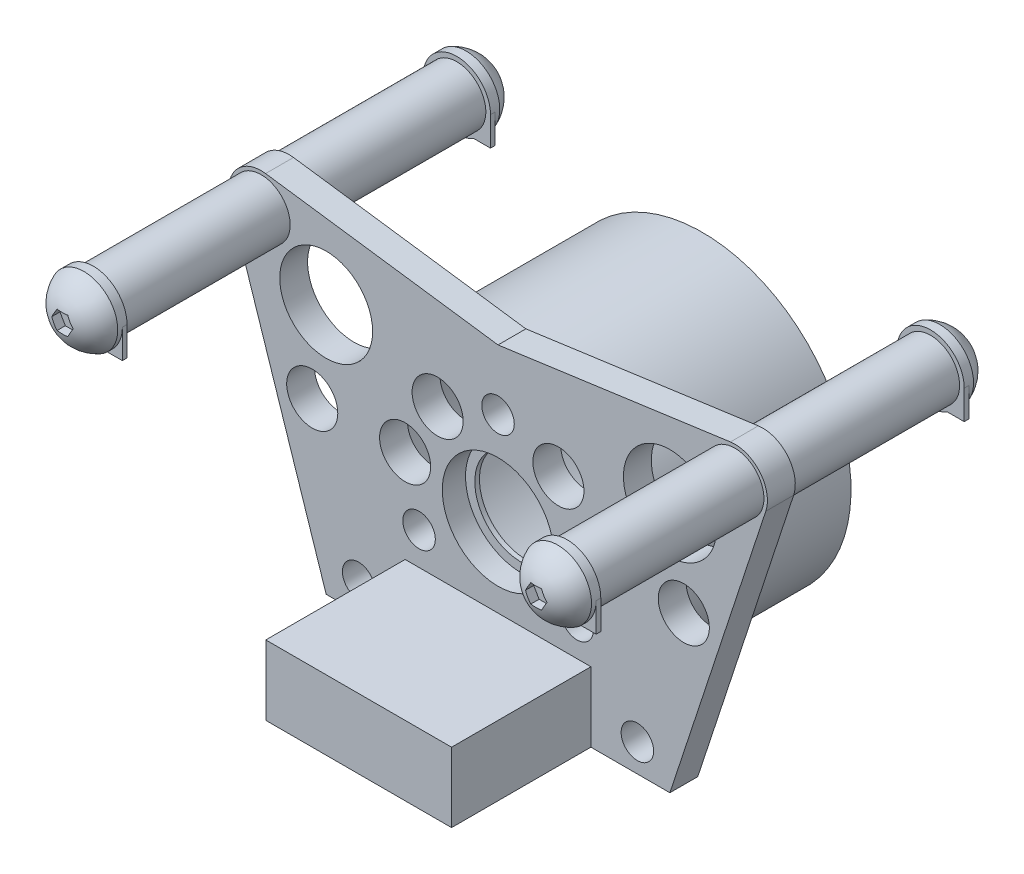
ISO-10303-21;
HEADER;
FILE_DESCRIPTION(('STEP AP214'),'2;1');
FILE_NAME('part.step','',(''),(''),'','','');
FILE_SCHEMA(('AUTOMOTIVE_DESIGN { 1 0 10303 214 1 1 1 1 }'));
ENDSEC;
DATA;
#1=APPLICATION_CONTEXT('core data for automotive mechanical design processes');
#2=APPLICATION_PROTOCOL_DEFINITION('international standard','automotive_design',2000,#1);
#3=PRODUCT_CONTEXT('',#1,'mechanical');
#4=PRODUCT('Part','Part','',(#3));
#5=PRODUCT_RELATED_PRODUCT_CATEGORY('part','',(#4));
#6=PRODUCT_DEFINITION_FORMATION('','',#4);
#7=PRODUCT_DEFINITION_CONTEXT('part definition',#1,'design');
#8=PRODUCT_DEFINITION('design','',#6,#7);
#9=PRODUCT_DEFINITION_SHAPE('','',#8);
#10=(LENGTH_UNIT() NAMED_UNIT(*) SI_UNIT(.MILLI.,.METRE.));
#11=(NAMED_UNIT(*) PLANE_ANGLE_UNIT() SI_UNIT($,.RADIAN.));
#12=(NAMED_UNIT(*) SI_UNIT($,.STERADIAN.) SOLID_ANGLE_UNIT());
#13=UNCERTAINTY_MEASURE_WITH_UNIT(LENGTH_MEASURE(1.E-05),#10,'distance_accuracy_value','');
#14=(GEOMETRIC_REPRESENTATION_CONTEXT(3) GLOBAL_UNCERTAINTY_ASSIGNED_CONTEXT((#13)) GLOBAL_UNIT_ASSIGNED_CONTEXT((#10,
#11,#12)) REPRESENTATION_CONTEXT('',''));
#15=CARTESIAN_POINT('',(0.,0.,0.));
#16=DIRECTION('',(0.,0.,1.));
#17=DIRECTION('',(1.,0.,0.));
#18=AXIS2_PLACEMENT_3D('',#15,#16,#17);
#19=CARTESIAN_POINT('',(12.954,8.382,9.7456625));
#20=DIRECTION('',(0.,0.,1.));
#21=DIRECTION('',(1.,0.,0.));
#22=AXIS2_PLACEMENT_3D('',#19,#20,#21);
#23=SPHERICAL_SURFACE('',#22,1.9700875);
#24=CARTESIAN_POINT('',(12.954,8.382,10.44575));
#25=DIRECTION('',(0.,0.,1.));
#26=DIRECTION('',(1.,0.,0.));
#27=AXIS2_PLACEMENT_3D('',#24,#25,#26);
#28=CIRCLE('',#27,1.8415);
#29=CARTESIAN_POINT('',(14.7955,8.382,10.44575));
#30=VERTEX_POINT('',#29);
#31=EDGE_CURVE('E444',#30,#30,#28,.T.);
#32=ORIENTED_EDGE('',*,*,#31,.T.);
#33=EDGE_LOOP('',(#32));
#34=FACE_BOUND('',#33,.T.);
#35=CARTESIAN_POINT('',(12.5140590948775,8.636,9.7456625));
#36=DIRECTION('',(0.866025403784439,-0.5,0.));
#37=DIRECTION('',(0.5,0.866025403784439,0.));
#38=AXIS2_PLACEMENT_3D('',#35,#36,#37);
#39=CIRCLE('',#38,1.9034654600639);
#40=CARTESIAN_POINT('',(12.6607060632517,8.89,11.6263962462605));
#41=VERTEX_POINT('',#40);
#42=CARTESIAN_POINT('',(12.3674121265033,8.382,11.6263962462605));
#43=VERTEX_POINT('',#42);
#44=EDGE_CURVE('E11',#41,#43,#39,.T.);
#45=ORIENTED_EDGE('',*,*,#44,.F.);
#46=CARTESIAN_POINT('',(12.954,8.89,9.7456625));
#47=DIRECTION('',(0.,-1.,0.));
#48=DIRECTION('',(0.,0.,-1.));
#49=AXIS2_PLACEMENT_3D('',#46,#47,#48);
#50=CIRCLE('',#49,1.9034654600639);
#51=CARTESIAN_POINT('',(13.2472939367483,8.89,11.6263962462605));
#52=VERTEX_POINT('',#51);
#53=EDGE_CURVE('E37',#52,#41,#50,.T.);
#54=ORIENTED_EDGE('',*,*,#53,.F.);
#55=CARTESIAN_POINT('',(13.3939409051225,8.636,9.7456625));
#56=DIRECTION('',(-0.866025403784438,-0.500000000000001,0.));
#57=DIRECTION('',(0.500000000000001,-0.866025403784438,0.));
#58=AXIS2_PLACEMENT_3D('',#55,#56,#57);
#59=CIRCLE('',#58,1.9034654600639);
#60=CARTESIAN_POINT('',(13.5405878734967,8.382,11.6263962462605));
#61=VERTEX_POINT('',#60);
#62=EDGE_CURVE('E841',#61,#52,#59,.T.);
#63=ORIENTED_EDGE('',*,*,#62,.F.);
#64=CARTESIAN_POINT('',(13.3939409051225,8.128,9.7456625));
#65=DIRECTION('',(-0.866025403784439,0.499999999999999,0.));
#66=DIRECTION('',(-0.499999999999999,-0.866025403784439,0.));
#67=AXIS2_PLACEMENT_3D('',#64,#65,#66);
#68=CIRCLE('',#67,1.9034654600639);
#69=CARTESIAN_POINT('',(13.2472939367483,7.874,11.6263962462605));
#70=VERTEX_POINT('',#69);
#71=EDGE_CURVE('E839',#70,#61,#68,.T.);
#72=ORIENTED_EDGE('',*,*,#71,.F.);
#73=CARTESIAN_POINT('',(12.954,7.874,9.7456625));
#74=DIRECTION('',(0.,1.,0.));
#75=DIRECTION('',(0.,0.,1.));
#76=AXIS2_PLACEMENT_3D('',#73,#74,#75);
#77=CIRCLE('',#76,1.9034654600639);
#78=CARTESIAN_POINT('',(12.6607060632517,7.874,11.6263962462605));
#79=VERTEX_POINT('',#78);
#80=EDGE_CURVE('E837',#79,#70,#77,.T.);
#81=ORIENTED_EDGE('',*,*,#80,.F.);
#82=CARTESIAN_POINT('',(12.5140590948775,8.128,9.7456625));
#83=DIRECTION('',(0.866025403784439,0.499999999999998,0.));
#84=DIRECTION('',(-0.499999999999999,0.86602540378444,0.));
#85=AXIS2_PLACEMENT_3D('',#82,#83,#84);
#86=CIRCLE('',#85,1.90346546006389);
#87=EDGE_CURVE('E835',#43,#79,#86,.T.);
#88=ORIENTED_EDGE('',*,*,#87,.F.);
#89=EDGE_LOOP('',(#45,#54,#63,#72,#81,#88));
#90=FACE_BOUND('',#89,.T.);
#91=ADVANCED_FACE('F30',(#34,#90),#23,.T.);
#92=CARTESIAN_POINT('',(14.7955,6.7945,9.93775));
#93=DIRECTION('',(0.,1.,0.));
#94=DIRECTION('',(0.,0.,1.));
#95=AXIS2_PLACEMENT_3D('',#92,#93,#94);
#96=PLANE('',#95);
#97=DIRECTION('',(0.,0.,-1.));
#98=VECTOR('',#97,1.);
#99=CARTESIAN_POINT('',(13.8872555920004,6.7945,10.44575));
#100=LINE('',#99,#98);
#101=CARTESIAN_POINT('',(13.8872555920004,6.7945,9.93775));
#102=VERTEX_POINT('',#101);
#103=CARTESIAN_POINT('',(13.8872555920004,6.7945,10.19175));
#104=VERTEX_POINT('',#103);
#105=EDGE_CURVE('E447',#102,#104,#100,.F.);
#106=ORIENTED_EDGE('',*,*,#105,.F.);
#107=DIRECTION('',(-1.,0.,0.));
#108=VECTOR('',#107,1.);
#109=CARTESIAN_POINT('',(14.7955,6.7945,9.93775));
#110=LINE('',#109,#108);
#111=CARTESIAN_POINT('',(14.7955,6.7945,9.93775));
#112=VERTEX_POINT('',#111);
#113=EDGE_CURVE('E457',#112,#102,#110,.T.);
#114=ORIENTED_EDGE('',*,*,#113,.F.);
#115=DIRECTION('',(0.,0.,1.));
#116=VECTOR('',#115,1.);
#117=CARTESIAN_POINT('',(14.7955,6.7945,9.93775));
#118=LINE('',#117,#116);
#119=CARTESIAN_POINT('',(14.7955,6.7945,10.19175));
#120=VERTEX_POINT('',#119);
#121=EDGE_CURVE('E475',#112,#120,#118,.T.);
#122=ORIENTED_EDGE('',*,*,#121,.T.);
#123=DIRECTION('',(-1.,0.,0.));
#124=VECTOR('',#123,1.);
#125=CARTESIAN_POINT('',(14.7955,6.7945,10.19175));
#126=LINE('',#125,#124);
#127=EDGE_CURVE('E466',#120,#104,#126,.T.);
#128=ORIENTED_EDGE('',*,*,#127,.T.);
#129=EDGE_LOOP('',(#106,#114,#122,#128));
#130=FACE_BOUND('',#129,.T.);
#131=ADVANCED_FACE('F868',(#130),#96,.F.);
#132=DIRECTION('',(0.,0.,-1.));
#133=VECTOR('',#132,1.);
#134=CARTESIAN_POINT('',(12.0207444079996,6.7945,10.44575));
#135=LINE('',#134,#133);
#136=CARTESIAN_POINT('',(12.0207444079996,6.7945,10.19175));
#137=VERTEX_POINT('',#136);
#138=CARTESIAN_POINT('',(12.0207444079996,6.7945,9.93775));
#139=VERTEX_POINT('',#138);
#140=EDGE_CURVE('E445',#137,#139,#135,.T.);
#141=ORIENTED_EDGE('',*,*,#140,.F.);
#142=CARTESIAN_POINT('',(11.1125,6.7945,10.19175));
#143=VERTEX_POINT('',#142);
#144=EDGE_CURVE('E465',#137,#143,#126,.T.);
#145=ORIENTED_EDGE('',*,*,#144,.T.);
#146=DIRECTION('',(0.,0.,1.));
#147=VECTOR('',#146,1.);
#148=CARTESIAN_POINT('',(11.1125,6.7945,9.93775));
#149=LINE('',#148,#147);
#150=CARTESIAN_POINT('',(11.1125,6.7945,9.93775));
#151=VERTEX_POINT('',#150);
#152=EDGE_CURVE('E478',#151,#143,#149,.T.);
#153=ORIENTED_EDGE('',*,*,#152,.F.);
#154=EDGE_CURVE('E456',#139,#151,#110,.T.);
#155=ORIENTED_EDGE('',*,*,#154,.F.);
#156=EDGE_LOOP('',(#141,#145,#153,#155));
#157=FACE_BOUND('',#156,.T.);
#158=ADVANCED_FACE('F873',(#157),#96,.F.);
#159=CARTESIAN_POINT('',(12.954,8.382,10.19175));
#160=DIRECTION('',(0.,0.,-1.));
#161=DIRECTION('',(-1.,0.,0.));
#162=AXIS2_PLACEMENT_3D('',#159,#160,#161);
#163=PLANE('',#162);
#164=CARTESIAN_POINT('',(12.954,8.382,10.19175));
#165=DIRECTION('',(0.,0.,-1.));
#166=DIRECTION('',(-1.,0.,0.));
#167=AXIS2_PLACEMENT_3D('',#164,#165,#166);
#168=CIRCLE('',#167,1.8415);
#169=CARTESIAN_POINT('',(11.1125,8.382,10.19175));
#170=VERTEX_POINT('',#169);
#171=EDGE_CURVE('E832',#170,#137,#168,.F.);
#172=ORIENTED_EDGE('',*,*,#171,.F.);
#173=DIRECTION('',(0.,1.,0.));
#174=VECTOR('',#173,1.);
#175=CARTESIAN_POINT('',(11.1125,8.382,10.19175));
#176=LINE('',#175,#174);
#177=EDGE_CURVE('E449',#143,#170,#176,.T.);
#178=ORIENTED_EDGE('',*,*,#177,.F.);
#179=ORIENTED_EDGE('',*,*,#144,.F.);
#180=EDGE_LOOP('',(#172,#178,#179));
#181=FACE_BOUND('',#180,.T.);
#182=ADVANCED_FACE('F950',(#181),#163,.F.);
#183=CARTESIAN_POINT('',(14.7955,8.382,10.19175));
#184=VERTEX_POINT('',#183);
#185=EDGE_CURVE('E830',#104,#184,#168,.F.);
#186=ORIENTED_EDGE('',*,*,#185,.F.);
#187=ORIENTED_EDGE('',*,*,#127,.F.);
#188=DIRECTION('',(0.,-1.,0.));
#189=VECTOR('',#188,1.);
#190=CARTESIAN_POINT('',(14.7955,8.382,10.19175));
#191=LINE('',#190,#189);
#192=EDGE_CURVE('E454',#184,#120,#191,.T.);
#193=ORIENTED_EDGE('',*,*,#192,.F.);
#194=EDGE_LOOP('',(#186,#187,#193));
#195=FACE_BOUND('',#194,.T.);
#196=ADVANCED_FACE('F953',(#195),#163,.F.);
#197=CARTESIAN_POINT('',(12.954,8.382,-10.19175));
#198=DIRECTION('',(0.,0.,1.));
#199=DIRECTION('',(1.,0.,0.));
#200=AXIS2_PLACEMENT_3D('',#197,#198,#199);
#201=CYLINDRICAL_SURFACE('',#200,1.5875);
#202=CARTESIAN_POINT('',(12.954,8.382,0.762000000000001));
#203=DIRECTION('',(0.,0.,-1.));
#204=DIRECTION('',(-1.,0.,0.));
#205=AXIS2_PLACEMENT_3D('',#202,#203,#204);
#206=CIRCLE('',#205,1.5875);
#207=CARTESIAN_POINT('',(11.3665,8.382,0.762000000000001));
#208=VERTEX_POINT('',#207);
#209=EDGE_CURVE('E559',#208,#208,#206,.F.);
#210=ORIENTED_EDGE('',*,*,#209,.T.);
#211=EDGE_LOOP('',(#210));
#212=FACE_BOUND('',#211,.T.);
#213=CARTESIAN_POINT('',(12.954,8.382,9.93775));
#214=DIRECTION('',(0.,0.,1.));
#215=DIRECTION('',(1.,0.,0.));
#216=AXIS2_PLACEMENT_3D('',#213,#214,#215);
#217=CIRCLE('',#216,1.5875);
#218=CARTESIAN_POINT('',(14.5415,8.382,9.93775));
#219=VERTEX_POINT('',#218);
#220=EDGE_CURVE('E827',#219,#219,#217,.T.);
#221=ORIENTED_EDGE('',*,*,#220,.F.);
#222=EDGE_LOOP('',(#221));
#223=FACE_BOUND('',#222,.T.);
#224=ADVANCED_FACE('F960',(#212,#223),#201,.T.);
#225=CARTESIAN_POINT('',(14.7955,6.7945,-9.93775));
#226=DIRECTION('',(0.,-1.,0.));
#227=DIRECTION('',(0.,0.,-1.));
#228=AXIS2_PLACEMENT_3D('',#225,#226,#227);
#229=PLANE('',#228);
#230=DIRECTION('',(0.,0.,1.));
#231=VECTOR('',#230,1.);
#232=CARTESIAN_POINT('',(13.8872555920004,6.7945,-10.44575));
#233=LINE('',#232,#231);
#234=CARTESIAN_POINT('',(13.8872555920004,6.7945,-10.19175));
#235=VERTEX_POINT('',#234);
#236=CARTESIAN_POINT('',(13.8872555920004,6.7945,-9.93775));
#237=VERTEX_POINT('',#236);
#238=EDGE_CURVE('E523',#235,#237,#233,.T.);
#239=ORIENTED_EDGE('',*,*,#238,.F.);
#240=DIRECTION('',(-1.,0.,0.));
#241=VECTOR('',#240,1.);
#242=CARTESIAN_POINT('',(14.7955,6.7945,-10.19175));
#243=LINE('',#242,#241);
#244=CARTESIAN_POINT('',(14.7955,6.7945,-10.19175));
#245=VERTEX_POINT('',#244);
#246=EDGE_CURVE('E544',#245,#235,#243,.T.);
#247=ORIENTED_EDGE('',*,*,#246,.F.);
#248=DIRECTION('',(0.,0.,-1.));
#249=VECTOR('',#248,1.);
#250=CARTESIAN_POINT('',(14.7955,6.7945,-9.93775));
#251=LINE('',#250,#249);
#252=CARTESIAN_POINT('',(14.7955,6.7945,-9.93775));
#253=VERTEX_POINT('',#252);
#254=EDGE_CURVE('E555',#253,#245,#251,.T.);
#255=ORIENTED_EDGE('',*,*,#254,.F.);
#256=DIRECTION('',(-1.,0.,0.));
#257=VECTOR('',#256,1.);
#258=CARTESIAN_POINT('',(14.7955,6.7945,-9.93775));
#259=LINE('',#258,#257);
#260=EDGE_CURVE('E535',#253,#237,#259,.T.);
#261=ORIENTED_EDGE('',*,*,#260,.T.);
#262=EDGE_LOOP('',(#239,#247,#255,#261));
#263=FACE_BOUND('',#262,.T.);
#264=ADVANCED_FACE('F938',(#263),#229,.T.);
#265=CARTESIAN_POINT('',(12.954,8.382,-10.19175));
#266=DIRECTION('',(0.,0.,-1.));
#267=DIRECTION('',(-1.,0.,0.));
#268=AXIS2_PLACEMENT_3D('',#265,#266,#267);
#269=PLANE('',#268);
#270=CARTESIAN_POINT('',(12.954,8.382,-10.19175));
#271=DIRECTION('',(0.,0.,-1.));
#272=DIRECTION('',(-1.,0.,0.));
#273=AXIS2_PLACEMENT_3D('',#270,#271,#272);
#274=CIRCLE('',#273,1.8415);
#275=CARTESIAN_POINT('',(14.7955,8.382,-10.19175));
#276=VERTEX_POINT('',#275);
#277=EDGE_CURVE('E806',#276,#235,#274,.T.);
#278=ORIENTED_EDGE('',*,*,#277,.F.);
#279=DIRECTION('',(0.,-1.,0.));
#280=VECTOR('',#279,1.);
#281=CARTESIAN_POINT('',(14.7955,8.382,-10.19175));
#282=LINE('',#281,#280);
#283=EDGE_CURVE('E526',#276,#245,#282,.T.);
#284=ORIENTED_EDGE('',*,*,#283,.T.);
#285=ORIENTED_EDGE('',*,*,#246,.T.);
#286=EDGE_LOOP('',(#278,#284,#285));
#287=FACE_BOUND('',#286,.T.);
#288=ADVANCED_FACE('F949',(#287),#269,.T.);
#289=CARTESIAN_POINT('',(12.954,8.382,-0.762000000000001));
#290=DIRECTION('',(0.,0.,-1.));
#291=DIRECTION('',(-1.,0.,0.));
#292=AXIS2_PLACEMENT_3D('',#289,#290,#291);
#293=CIRCLE('',#292,1.5875);
#294=CARTESIAN_POINT('',(11.3665,8.382,-0.762000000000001));
#295=VERTEX_POINT('',#294);
#296=EDGE_CURVE('E551',#295,#295,#293,.F.);
#297=ORIENTED_EDGE('',*,*,#296,.F.);
#298=EDGE_LOOP('',(#297));
#299=FACE_BOUND('',#298,.T.);
#300=CARTESIAN_POINT('',(12.954,8.382,-9.93775));
#301=DIRECTION('',(0.,0.,-1.));
#302=DIRECTION('',(-1.,0.,0.));
#303=AXIS2_PLACEMENT_3D('',#300,#301,#302);
#304=CIRCLE('',#303,1.5875);
#305=CARTESIAN_POINT('',(11.3665,8.382,-9.93775));
#306=VERTEX_POINT('',#305);
#307=EDGE_CURVE('E562',#306,#306,#304,.T.);
#308=ORIENTED_EDGE('',*,*,#307,.F.);
#309=EDGE_LOOP('',(#308));
#310=FACE_BOUND('',#309,.T.);
#311=ADVANCED_FACE('F955',(#299,#310),#201,.T.);
#312=CARTESIAN_POINT('',(12.954,8.382,0.762));
#313=DIRECTION('',(0.,0.,-1.));
#314=DIRECTION('',(-1.,0.,0.));
#315=AXIS2_PLACEMENT_3D('',#312,#313,#314);
#316=PLANE('',#315);
#317=CARTESIAN_POINT('',(-12.954,8.382,0.762000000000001));
#318=DIRECTION('',(0.,0.,-1.));
#319=DIRECTION('',(-1.,0.,0.));
#320=AXIS2_PLACEMENT_3D('',#317,#318,#319);
#321=CIRCLE('',#320,1.5875);
#322=CARTESIAN_POINT('',(-14.5415,8.382,0.762000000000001));
#323=VERTEX_POINT('',#322);
#324=EDGE_CURVE('E712',#323,#323,#321,.F.);
#325=ORIENTED_EDGE('',*,*,#324,.F.);
#326=EDGE_LOOP('',(#325));
#327=FACE_BOUND('',#326,.T.);
#328=CARTESIAN_POINT('',(-9.398,5.588,0.762));
#329=DIRECTION('',(0.,0.,1.));
#330=DIRECTION('',(1.,0.,0.));
#331=AXIS2_PLACEMENT_3D('',#328,#329,#330);
#332=CIRCLE('',#331,2.54);
#333=CARTESIAN_POINT('',(-6.858,5.588,0.762));
#334=VERTEX_POINT('',#333);
#335=EDGE_CURVE('E1952',#334,#334,#332,.T.);
#336=ORIENTED_EDGE('',*,*,#335,.F.);
#337=EDGE_LOOP('',(#336));
#338=FACE_BOUND('',#337,.T.);
#339=CARTESIAN_POINT('',(9.398,5.588,0.762));
#340=DIRECTION('',(0.,0.,1.));
#341=DIRECTION('',(1.,0.,0.));
#342=AXIS2_PLACEMENT_3D('',#339,#340,#341);
#343=CIRCLE('',#342,2.54);
#344=CARTESIAN_POINT('',(11.938,5.588,0.762));
#345=VERTEX_POINT('',#344);
#346=EDGE_CURVE('E1956',#345,#345,#343,.T.);
#347=ORIENTED_EDGE('',*,*,#346,.F.);
#348=EDGE_LOOP('',(#347));
#349=FACE_BOUND('',#348,.T.);
#350=CARTESIAN_POINT('',(0.,0.,0.762));
#351=DIRECTION('',(0.,0.,1.));
#352=DIRECTION('',(1.,0.,0.));
#353=AXIS2_PLACEMENT_3D('',#350,#351,#352);
#354=CIRCLE('',#353,3.048);
#355=CARTESIAN_POINT('',(3.048,0.,0.762));
#356=VERTEX_POINT('',#355);
#357=EDGE_CURVE('E1960',#356,#356,#354,.T.);
#358=ORIENTED_EDGE('',*,*,#357,.F.);
#359=EDGE_LOOP('',(#358));
#360=FACE_BOUND('',#359,.T.);
#361=CARTESIAN_POINT('',(-5.08,0.762,0.762));
#362=DIRECTION('',(0.,0.,1.));
#363=DIRECTION('',(1.,0.,0.));
#364=AXIS2_PLACEMENT_3D('',#361,#362,#363);
#365=CIRCLE('',#364,1.397);
#366=CARTESIAN_POINT('',(-3.683,0.762,0.762));
#367=VERTEX_POINT('',#366);
#368=EDGE_CURVE('E1964',#367,#367,#365,.T.);
#369=ORIENTED_EDGE('',*,*,#368,.F.);
#370=EDGE_LOOP('',(#369));
#371=FACE_BOUND('',#370,.T.);
#372=CARTESIAN_POINT('',(-10.16,0.762,0.762));
#373=DIRECTION('',(0.,0.,1.));
#374=DIRECTION('',(1.,0.,0.));
#375=AXIS2_PLACEMENT_3D('',#372,#373,#374);
#376=CIRCLE('',#375,1.397);
#377=CARTESIAN_POINT('',(-8.763,0.762,0.762));
#378=VERTEX_POINT('',#377);
#379=EDGE_CURVE('E1968',#378,#378,#376,.T.);
#380=ORIENTED_EDGE('',*,*,#379,.F.);
#381=EDGE_LOOP('',(#380));
#382=FACE_BOUND('',#381,.T.);
#383=CARTESIAN_POINT('',(5.08,0.762,0.762));
#384=DIRECTION('',(0.,0.,1.));
#385=DIRECTION('',(1.,0.,0.));
#386=AXIS2_PLACEMENT_3D('',#383,#384,#385);
#387=CIRCLE('',#386,1.397);
#388=CARTESIAN_POINT('',(6.477,0.762,0.762));
#389=VERTEX_POINT('',#388);
#390=EDGE_CURVE('E1972',#389,#389,#387,.T.);
#391=ORIENTED_EDGE('',*,*,#390,.F.);
#392=EDGE_LOOP('',(#391));
#393=FACE_BOUND('',#392,.T.);
#394=CARTESIAN_POINT('',(10.16,0.762,0.762));
#395=DIRECTION('',(0.,0.,1.));
#396=DIRECTION('',(1.,0.,0.));
#397=AXIS2_PLACEMENT_3D('',#394,#395,#396);
#398=CIRCLE('',#397,1.397);
#399=CARTESIAN_POINT('',(11.557,0.762,0.762));
#400=VERTEX_POINT('',#399);
#401=EDGE_CURVE('E1976',#400,#400,#398,.T.);
#402=ORIENTED_EDGE('',*,*,#401,.F.);
#403=EDGE_LOOP('',(#402));
#404=FACE_BOUND('',#403,.T.);
#405=CARTESIAN_POINT('',(-3.302,3.81,0.762));
#406=DIRECTION('',(0.,0.,1.));
#407=DIRECTION('',(1.,0.,0.));
#408=AXIS2_PLACEMENT_3D('',#405,#406,#407);
#409=CIRCLE('',#408,1.397);
#410=CARTESIAN_POINT('',(-1.905,3.81,0.762));
#411=VERTEX_POINT('',#410);
#412=EDGE_CURVE('E1980',#411,#411,#409,.T.);
#413=ORIENTED_EDGE('',*,*,#412,.F.);
#414=EDGE_LOOP('',(#413));
#415=FACE_BOUND('',#414,.T.);
#416=CARTESIAN_POINT('',(3.302,3.81,0.762));
#417=DIRECTION('',(0.,0.,1.));
#418=DIRECTION('',(1.,0.,0.));
#419=AXIS2_PLACEMENT_3D('',#416,#417,#418);
#420=CIRCLE('',#419,1.397);
#421=CARTESIAN_POINT('',(4.699,3.81,0.762));
#422=VERTEX_POINT('',#421);
#423=EDGE_CURVE('E1984',#422,#422,#420,.T.);
#424=ORIENTED_EDGE('',*,*,#423,.F.);
#425=EDGE_LOOP('',(#424));
#426=FACE_BOUND('',#425,.T.);
#427=CARTESIAN_POINT('',(7.62,-6.604,0.762000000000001));
#428=DIRECTION('',(0.,0.,1.));
#429=DIRECTION('',(1.,0.,0.));
#430=AXIS2_PLACEMENT_3D('',#427,#428,#429);
#431=CIRCLE('',#430,0.888999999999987);
#432=CARTESIAN_POINT('',(8.50899999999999,-6.604,0.762000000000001));
#433=VERTEX_POINT('',#432);
#434=EDGE_CURVE('E1988',#433,#433,#431,.T.);
#435=ORIENTED_EDGE('',*,*,#434,.F.);
#436=EDGE_LOOP('',(#435));
#437=FACE_BOUND('',#436,.T.);
#438=CARTESIAN_POINT('',(-7.62,-6.604,0.762000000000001));
#439=DIRECTION('',(0.,0.,1.));
#440=DIRECTION('',(1.,0.,0.));
#441=AXIS2_PLACEMENT_3D('',#438,#439,#440);
#442=CIRCLE('',#441,0.888999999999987);
#443=CARTESIAN_POINT('',(-6.73100000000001,-6.604,0.762000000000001));
#444=VERTEX_POINT('',#443);
#445=EDGE_CURVE('E1992',#444,#444,#442,.T.);
#446=ORIENTED_EDGE('',*,*,#445,.F.);
#447=EDGE_LOOP('',(#446));
#448=FACE_BOUND('',#447,.T.);
#449=CARTESIAN_POINT('',(-4.318,-2.54,0.762000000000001));
#450=DIRECTION('',(0.,0.,1.));
#451=DIRECTION('',(1.,0.,0.));
#452=AXIS2_PLACEMENT_3D('',#449,#450,#451);
#453=CIRCLE('',#452,0.888999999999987);
#454=CARTESIAN_POINT('',(-3.42900000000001,-2.54,0.762000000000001));
#455=VERTEX_POINT('',#454);
#456=EDGE_CURVE('E1996',#455,#455,#453,.T.);
#457=ORIENTED_EDGE('',*,*,#456,.F.);
#458=EDGE_LOOP('',(#457));
#459=FACE_BOUND('',#458,.T.);
#460=CARTESIAN_POINT('',(4.318,-2.54,0.762000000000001));
#461=DIRECTION('',(0.,0.,1.));
#462=DIRECTION('',(1.,0.,0.));
#463=AXIS2_PLACEMENT_3D('',#460,#461,#462);
#464=CIRCLE('',#463,0.888999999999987);
#465=CARTESIAN_POINT('',(5.20699999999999,-2.54,0.762000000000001));
#466=VERTEX_POINT('',#465);
#467=EDGE_CURVE('E2000',#466,#466,#464,.T.);
#468=ORIENTED_EDGE('',*,*,#467,.F.);
#469=EDGE_LOOP('',(#468));
#470=FACE_BOUND('',#469,.T.);
#471=CARTESIAN_POINT('',(0.,5.08,0.762000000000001));
#472=DIRECTION('',(0.,0.,1.));
#473=DIRECTION('',(1.,0.,0.));
#474=AXIS2_PLACEMENT_3D('',#471,#472,#473);
#475=CIRCLE('',#474,0.888999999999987);
#476=CARTESIAN_POINT('',(0.888999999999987,5.08,0.762000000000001));
#477=VERTEX_POINT('',#476);
#478=EDGE_CURVE('E2004',#477,#477,#475,.T.);
#479=ORIENTED_EDGE('',*,*,#478,.F.);
#480=EDGE_LOOP('',(#479));
#481=FACE_BOUND('',#480,.T.);
#482=DIRECTION('',(0.,-1.,0.));
#483=VECTOR('',#482,1.);
#484=CARTESIAN_POINT('',(-5.08,-8.128,0.762));
#485=LINE('',#484,#483);
#486=CARTESIAN_POINT('',(-5.08,-4.318,0.762));
#487=VERTEX_POINT('',#486);
#488=CARTESIAN_POINT('',(-5.08,-8.128,0.762));
#489=VERTEX_POINT('',#488);
#490=EDGE_CURVE('E727',#487,#489,#485,.T.);
#491=ORIENTED_EDGE('',*,*,#490,.F.);
#492=DIRECTION('',(-1.,0.,0.));
#493=VECTOR('',#492,1.);
#494=CARTESIAN_POINT('',(-5.08,-4.318,0.762));
#495=LINE('',#494,#493);
#496=CARTESIAN_POINT('',(5.08,-4.318,0.762));
#497=VERTEX_POINT('',#496);
#498=EDGE_CURVE('E734',#497,#487,#495,.T.);
#499=ORIENTED_EDGE('',*,*,#498,.F.);
#500=DIRECTION('',(0.,1.,0.));
#501=VECTOR('',#500,1.);
#502=CARTESIAN_POINT('',(5.08,-8.128,0.762));
#503=LINE('',#502,#501);
#504=CARTESIAN_POINT('',(5.08,-8.128,0.762));
#505=VERTEX_POINT('',#504);
#506=EDGE_CURVE('E748',#505,#497,#503,.T.);
#507=ORIENTED_EDGE('',*,*,#506,.F.);
#508=DIRECTION('',(1.,0.,0.));
#509=VECTOR('',#508,1.);
#510=CARTESIAN_POINT('',(-9.398,-8.128,0.762));
#511=LINE('',#510,#509);
#512=CARTESIAN_POINT('',(9.398,-8.128,0.762));
#513=VERTEX_POINT('',#512);
#514=EDGE_CURVE('E2105',#505,#513,#511,.T.);
#515=ORIENTED_EDGE('',*,*,#514,.T.);
#516=DIRECTION('',(0.312303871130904,0.949982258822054,0.));
#517=VECTOR('',#516,1.);
#518=CARTESIAN_POINT('',(9.398,-8.128,0.762));
#519=LINE('',#518,#517);
#520=CARTESIAN_POINT('',(14.6430684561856,7.82672371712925,0.762));
#521=VERTEX_POINT('',#520);
#522=EDGE_CURVE('E2109',#513,#521,#519,.T.);
#523=ORIENTED_EDGE('',*,*,#522,.T.);
#524=CARTESIAN_POINT('',(12.954,8.382,0.762));
#525=DIRECTION('',(0.,0.,1.));
#526=DIRECTION('',(-1.,0.,0.));
#527=AXIS2_PLACEMENT_3D('',#524,#525,#526);
#528=CIRCLE('',#527,1.778);
#529=CARTESIAN_POINT('',(12.7099607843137,10.1431725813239,0.762));
#530=VERTEX_POINT('',#529);
#531=EDGE_CURVE('E2157',#521,#530,#528,.T.);
#532=ORIENTED_EDGE('',*,*,#531,.T.);
#533=DIRECTION('',(-0.990535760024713,-0.137254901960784,0.));
#534=VECTOR('',#533,1.);
#535=CARTESIAN_POINT('',(12.7099607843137,10.1431725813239,0.762));
#536=LINE('',#535,#534);
#537=CARTESIAN_POINT('',(0.,8.382,0.762));
#538=VERTEX_POINT('',#537);
#539=EDGE_CURVE('E2156',#530,#538,#536,.T.);
#540=ORIENTED_EDGE('',*,*,#539,.T.);
#541=DIRECTION('',(-0.990535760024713,0.137254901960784,0.));
#542=VECTOR('',#541,1.);
#543=CARTESIAN_POINT('',(0.,8.382,0.762));
#544=LINE('',#543,#542);
#545=CARTESIAN_POINT('',(-12.7099607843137,10.1431725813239,0.762));
#546=VERTEX_POINT('',#545);
#547=EDGE_CURVE('E2154',#538,#546,#544,.T.);
#548=ORIENTED_EDGE('',*,*,#547,.T.);
#549=CARTESIAN_POINT('',(-12.954,8.382,0.762));
#550=DIRECTION('',(0.,0.,1.));
#551=DIRECTION('',(1.,0.,0.));
#552=AXIS2_PLACEMENT_3D('',#549,#550,#551);
#553=CIRCLE('',#552,1.778);
#554=CARTESIAN_POINT('',(-14.6430684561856,7.82672371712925,0.762));
#555=VERTEX_POINT('',#554);
#556=EDGE_CURVE('E2138',#546,#555,#553,.T.);
#557=ORIENTED_EDGE('',*,*,#556,.T.);
#558=DIRECTION('',(0.312303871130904,-0.949982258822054,0.));
#559=VECTOR('',#558,1.);
#560=CARTESIAN_POINT('',(-14.6430684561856,7.82672371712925,0.762));
#561=LINE('',#560,#559);
#562=CARTESIAN_POINT('',(-9.398,-8.128,0.762));
#563=VERTEX_POINT('',#562);
#564=EDGE_CURVE('E2103',#555,#563,#561,.T.);
#565=ORIENTED_EDGE('',*,*,#564,.T.);
#566=EDGE_CURVE('E2028',#563,#489,#511,.T.);
#567=ORIENTED_EDGE('',*,*,#566,.T.);
#568=EDGE_LOOP('',(#491,#499,#507,#515,#523,#532,#540,#548,#557,#565,#567));
#569=FACE_BOUND('',#568,.T.);
#570=ORIENTED_EDGE('',*,*,#209,.F.);
#571=EDGE_LOOP('',(#570));
#572=FACE_BOUND('',#571,.T.);
#573=ADVANCED_FACE('F958',(#327,#338,#349,#360,#371,#382,#393,#404,#415,#426,#437,#448,#459,
#470,#481,#569,#572),#316,.F.);
#574=CARTESIAN_POINT('',(12.954,8.382,-0.762));
#575=DIRECTION('',(0.,0.,-1.));
#576=DIRECTION('',(-1.,0.,0.));
#577=AXIS2_PLACEMENT_3D('',#574,#575,#576);
#578=PLANE('',#577);
#579=CARTESIAN_POINT('',(-12.954,8.382,-0.762000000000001));
#580=DIRECTION('',(0.,0.,-1.));
#581=DIRECTION('',(-1.,0.,0.));
#582=AXIS2_PLACEMENT_3D('',#579,#580,#581);
#583=CIRCLE('',#582,1.5875);
#584=CARTESIAN_POINT('',(-14.5415,8.382,-0.762000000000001));
#585=VERTEX_POINT('',#584);
#586=EDGE_CURVE('E704',#585,#585,#583,.F.);
#587=ORIENTED_EDGE('',*,*,#586,.T.);
#588=EDGE_LOOP('',(#587));
#589=FACE_BOUND('',#588,.T.);
#590=CARTESIAN_POINT('',(-7.62,-6.604,-0.762));
#591=DIRECTION('',(0.,0.,1.));
#592=DIRECTION('',(1.,0.,0.));
#593=AXIS2_PLACEMENT_3D('',#590,#591,#592);
#594=CIRCLE('',#593,0.888999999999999);
#595=CARTESIAN_POINT('',(-6.731,-6.604,-0.762));
#596=VERTEX_POINT('',#595);
#597=EDGE_CURVE('E2055',#596,#596,#594,.T.);
#598=ORIENTED_EDGE('',*,*,#597,.T.);
#599=EDGE_LOOP('',(#598));
#600=FACE_BOUND('',#599,.T.);
#601=CARTESIAN_POINT('',(7.62,-6.604,-0.762));
#602=DIRECTION('',(0.,0.,1.));
#603=DIRECTION('',(1.,0.,0.));
#604=AXIS2_PLACEMENT_3D('',#601,#602,#603);
#605=CIRCLE('',#604,0.888999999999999);
#606=CARTESIAN_POINT('',(8.509,-6.604,-0.762));
#607=VERTEX_POINT('',#606);
#608=EDGE_CURVE('E2059',#607,#607,#605,.T.);
#609=ORIENTED_EDGE('',*,*,#608,.T.);
#610=EDGE_LOOP('',(#609));
#611=FACE_BOUND('',#610,.T.);
#612=CARTESIAN_POINT('',(10.16,0.762,-0.762));
#613=DIRECTION('',(0.,0.,1.));
#614=DIRECTION('',(1.,0.,0.));
#615=AXIS2_PLACEMENT_3D('',#612,#613,#614);
#616=CIRCLE('',#615,1.397);
#617=CARTESIAN_POINT('',(11.557,0.762,-0.762));
#618=VERTEX_POINT('',#617);
#619=EDGE_CURVE('E2070',#618,#618,#616,.T.);
#620=ORIENTED_EDGE('',*,*,#619,.T.);
#621=EDGE_LOOP('',(#620));
#622=FACE_BOUND('',#621,.T.);
#623=CARTESIAN_POINT('',(-10.16,0.762,-0.762));
#624=DIRECTION('',(0.,0.,1.));
#625=DIRECTION('',(1.,0.,0.));
#626=AXIS2_PLACEMENT_3D('',#623,#624,#625);
#627=CIRCLE('',#626,1.397);
#628=CARTESIAN_POINT('',(-8.763,0.762,-0.762));
#629=VERTEX_POINT('',#628);
#630=EDGE_CURVE('E2078',#629,#629,#627,.T.);
#631=ORIENTED_EDGE('',*,*,#630,.T.);
#632=EDGE_LOOP('',(#631));
#633=FACE_BOUND('',#632,.T.);
#634=CARTESIAN_POINT('',(9.398,5.588,-0.762));
#635=DIRECTION('',(0.,0.,1.));
#636=DIRECTION('',(1.,0.,0.));
#637=AXIS2_PLACEMENT_3D('',#634,#635,#636);
#638=CIRCLE('',#637,2.54);
#639=CARTESIAN_POINT('',(11.938,5.588,-0.762));
#640=VERTEX_POINT('',#639);
#641=EDGE_CURVE('E2091',#640,#640,#638,.T.);
#642=ORIENTED_EDGE('',*,*,#641,.T.);
#643=EDGE_LOOP('',(#642));
#644=FACE_BOUND('',#643,.T.);
#645=CARTESIAN_POINT('',(-9.398,5.588,-0.762));
#646=DIRECTION('',(0.,0.,1.));
#647=DIRECTION('',(1.,0.,0.));
#648=AXIS2_PLACEMENT_3D('',#645,#646,#647);
#649=CIRCLE('',#648,2.54);
#650=CARTESIAN_POINT('',(-6.858,5.588,-0.762));
#651=VERTEX_POINT('',#650);
#652=EDGE_CURVE('E2095',#651,#651,#649,.T.);
#653=ORIENTED_EDGE('',*,*,#652,.T.);
#654=EDGE_LOOP('',(#653));
#655=FACE_BOUND('',#654,.T.);
#656=DIRECTION('',(1.,0.,0.));
#657=VECTOR('',#656,1.);
#658=CARTESIAN_POINT('',(-9.398,-8.128,-0.762));
#659=LINE('',#658,#657);
#660=CARTESIAN_POINT('',(0.,-8.128,-0.762));
#661=VERTEX_POINT('',#660);
#662=CARTESIAN_POINT('',(9.398,-8.128,-0.762));
#663=VERTEX_POINT('',#662);
#664=EDGE_CURVE('E2150',#661,#663,#659,.T.);
#665=ORIENTED_EDGE('',*,*,#664,.F.);
#666=CARTESIAN_POINT('',(0.,0.,-0.762));
#667=DIRECTION('',(0.,0.,-1.));
#668=DIRECTION('',(-1.,0.,0.));
#669=AXIS2_PLACEMENT_3D('',#666,#667,#668);
#670=CIRCLE('',#669,8.128);
#671=EDGE_CURVE('E720',#661,#661,#670,.T.);
#672=ORIENTED_EDGE('',*,*,#671,.F.);
#673=CARTESIAN_POINT('',(-9.398,-8.128,-0.762));
#674=VERTEX_POINT('',#673);
#675=EDGE_CURVE('E2148',#674,#661,#659,.T.);
#676=ORIENTED_EDGE('',*,*,#675,.F.);
#677=DIRECTION('',(0.312303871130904,-0.949982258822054,0.));
#678=VECTOR('',#677,1.);
#679=CARTESIAN_POINT('',(-14.6430684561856,7.82672371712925,-0.762));
#680=LINE('',#679,#678);
#681=CARTESIAN_POINT('',(-14.6430684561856,7.82672371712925,-0.762));
#682=VERTEX_POINT('',#681);
#683=EDGE_CURVE('E2102',#682,#674,#680,.T.);
#684=ORIENTED_EDGE('',*,*,#683,.F.);
#685=CARTESIAN_POINT('',(-12.954,8.382,-0.762));
#686=DIRECTION('',(0.,0.,1.));
#687=DIRECTION('',(1.,0.,0.));
#688=AXIS2_PLACEMENT_3D('',#685,#686,#687);
#689=CIRCLE('',#688,1.778);
#690=CARTESIAN_POINT('',(-12.7099607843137,10.1431725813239,-0.762));
#691=VERTEX_POINT('',#690);
#692=EDGE_CURVE('E2106',#691,#682,#689,.T.);
#693=ORIENTED_EDGE('',*,*,#692,.F.);
#694=DIRECTION('',(-0.990535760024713,0.137254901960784,0.));
#695=VECTOR('',#694,1.);
#696=CARTESIAN_POINT('',(0.,8.382,-0.762));
#697=LINE('',#696,#695);
#698=CARTESIAN_POINT('',(0.,8.382,-0.762));
#699=VERTEX_POINT('',#698);
#700=EDGE_CURVE('E2140',#699,#691,#697,.T.);
#701=ORIENTED_EDGE('',*,*,#700,.F.);
#702=DIRECTION('',(-0.990535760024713,-0.137254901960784,0.));
#703=VECTOR('',#702,1.);
#704=CARTESIAN_POINT('',(12.7099607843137,10.1431725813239,-0.762));
#705=LINE('',#704,#703);
#706=CARTESIAN_POINT('',(12.7099607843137,10.1431725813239,-0.762));
#707=VERTEX_POINT('',#706);
#708=EDGE_CURVE('E2142',#707,#699,#705,.T.);
#709=ORIENTED_EDGE('',*,*,#708,.F.);
#710=CARTESIAN_POINT('',(12.954,8.382,-0.762));
#711=DIRECTION('',(0.,0.,1.));
#712=DIRECTION('',(-1.,0.,0.));
#713=AXIS2_PLACEMENT_3D('',#710,#711,#712);
#714=CIRCLE('',#713,1.778);
#715=CARTESIAN_POINT('',(14.6430684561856,7.82672371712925,-0.762));
#716=VERTEX_POINT('',#715);
#717=EDGE_CURVE('E2144',#716,#707,#714,.T.);
#718=ORIENTED_EDGE('',*,*,#717,.F.);
#719=DIRECTION('',(0.312303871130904,0.949982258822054,0.));
#720=VECTOR('',#719,1.);
#721=CARTESIAN_POINT('',(9.398,-8.128,-0.762));
#722=LINE('',#721,#720);
#723=EDGE_CURVE('E2146',#663,#716,#722,.T.);
#724=ORIENTED_EDGE('',*,*,#723,.F.);
#725=EDGE_LOOP('',(#665,#672,#676,#684,#693,#701,#709,#718,#724));
#726=FACE_BOUND('',#725,.T.);
#727=ORIENTED_EDGE('',*,*,#296,.T.);
#728=EDGE_LOOP('',(#727));
#729=FACE_BOUND('',#728,.T.);
#730=ADVANCED_FACE('F1172',(#589,#600,#611,#622,#633,#644,#655,#726,#729),#578,.T.);
#731=CARTESIAN_POINT('',(-12.954,8.382,-9.7456625));
#732=DIRECTION('',(0.,0.,1.));
#733=DIRECTION('',(1.,0.,0.));
#734=AXIS2_PLACEMENT_3D('',#731,#732,#733);
#735=SPHERICAL_SURFACE('',#734,1.9700875);
#736=CARTESIAN_POINT('',(-12.954,8.382,-10.44575));
#737=DIRECTION('',(0.,0.,-1.));
#738=DIRECTION('',(-1.,0.,0.));
#739=AXIS2_PLACEMENT_3D('',#736,#737,#738);
#740=CIRCLE('',#739,1.8415);
#741=CARTESIAN_POINT('',(-14.7955,8.382,-10.44575));
#742=VERTEX_POINT('',#741);
#743=EDGE_CURVE('E596',#742,#742,#740,.T.);
#744=ORIENTED_EDGE('',*,*,#743,.T.);
#745=EDGE_LOOP('',(#744));
#746=FACE_BOUND('',#745,.T.);
#747=CARTESIAN_POINT('',(-12.5140590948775,8.636,-9.7456625));
#748=DIRECTION('',(-0.866025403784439,-0.5,0.));
#749=DIRECTION('',(0.5,-0.866025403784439,0.));
#750=AXIS2_PLACEMENT_3D('',#747,#748,#749);
#751=CIRCLE('',#750,1.9034654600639);
#752=CARTESIAN_POINT('',(-12.6607060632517,8.89,-11.6263962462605));
#753=VERTEX_POINT('',#752);
#754=CARTESIAN_POINT('',(-12.3674121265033,8.382,-11.6263962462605));
#755=VERTEX_POINT('',#754);
#756=EDGE_CURVE('E563',#753,#755,#751,.T.);
#757=ORIENTED_EDGE('',*,*,#756,.F.);
#758=CARTESIAN_POINT('',(-12.954,8.89,-9.7456625));
#759=DIRECTION('',(0.,-1.,0.));
#760=DIRECTION('',(0.,0.,-1.));
#761=AXIS2_PLACEMENT_3D('',#758,#759,#760);
#762=CIRCLE('',#761,1.9034654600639);
#763=CARTESIAN_POINT('',(-13.2472939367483,8.89,-11.6263962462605));
#764=VERTEX_POINT('',#763);
#765=EDGE_CURVE('E795',#764,#753,#762,.T.);
#766=ORIENTED_EDGE('',*,*,#765,.F.);
#767=CARTESIAN_POINT('',(-13.3939409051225,8.636,-9.7456625));
#768=DIRECTION('',(0.866025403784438,-0.500000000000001,0.));
#769=DIRECTION('',(0.500000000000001,0.866025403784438,0.));
#770=AXIS2_PLACEMENT_3D('',#767,#768,#769);
#771=CIRCLE('',#770,1.9034654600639);
#772=CARTESIAN_POINT('',(-13.5405878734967,8.382,-11.6263962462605));
#773=VERTEX_POINT('',#772);
#774=EDGE_CURVE('E793',#773,#764,#771,.T.);
#775=ORIENTED_EDGE('',*,*,#774,.F.);
#776=CARTESIAN_POINT('',(-13.3939409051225,8.128,-9.7456625));
#777=DIRECTION('',(0.866025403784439,0.499999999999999,0.));
#778=DIRECTION('',(-0.499999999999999,0.866025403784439,0.));
#779=AXIS2_PLACEMENT_3D('',#776,#777,#778);
#780=CIRCLE('',#779,1.9034654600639);
#781=CARTESIAN_POINT('',(-13.2472939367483,7.874,-11.6263962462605));
#782=VERTEX_POINT('',#781);
#783=EDGE_CURVE('E791',#782,#773,#780,.T.);
#784=ORIENTED_EDGE('',*,*,#783,.F.);
#785=CARTESIAN_POINT('',(-12.954,7.874,-9.7456625));
#786=DIRECTION('',(0.,1.,0.));
#787=DIRECTION('',(0.,0.,1.));
#788=AXIS2_PLACEMENT_3D('',#785,#786,#787);
#789=CIRCLE('',#788,1.9034654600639);
#790=CARTESIAN_POINT('',(-12.6607060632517,7.874,-11.6263962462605));
#791=VERTEX_POINT('',#790);
#792=EDGE_CURVE('E789',#791,#782,#789,.T.);
#793=ORIENTED_EDGE('',*,*,#792,.F.);
#794=CARTESIAN_POINT('',(-12.5140590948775,8.128,-9.7456625));
#795=DIRECTION('',(-0.866025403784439,0.499999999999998,0.));
#796=DIRECTION('',(-0.499999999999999,-0.86602540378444,0.));
#797=AXIS2_PLACEMENT_3D('',#794,#795,#796);
#798=CIRCLE('',#797,1.90346546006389);
#799=EDGE_CURVE('E787',#755,#791,#798,.T.);
#800=ORIENTED_EDGE('',*,*,#799,.F.);
#801=EDGE_LOOP('',(#757,#766,#775,#784,#793,#800));
#802=FACE_BOUND('',#801,.T.);
#803=ADVANCED_FACE('F1003',(#746,#802),#735,.T.);
#804=CARTESIAN_POINT('',(-14.7955,6.7945,-9.93775));
#805=DIRECTION('',(0.,1.,0.));
#806=DIRECTION('',(0.,0.,1.));
#807=AXIS2_PLACEMENT_3D('',#804,#805,#806);
#808=PLANE('',#807);
#809=DIRECTION('',(0.,0.,1.));
#810=VECTOR('',#809,1.);
#811=CARTESIAN_POINT('',(-13.8872555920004,6.7945,-10.44575));
#812=LINE('',#811,#810);
#813=CARTESIAN_POINT('',(-13.8872555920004,6.7945,-9.93775));
#814=VERTEX_POINT('',#813);
#815=CARTESIAN_POINT('',(-13.8872555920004,6.7945,-10.19175));
#816=VERTEX_POINT('',#815);
#817=EDGE_CURVE('E599',#814,#816,#812,.F.);
#818=ORIENTED_EDGE('',*,*,#817,.F.);
#819=DIRECTION('',(1.,0.,0.));
#820=VECTOR('',#819,1.);
#821=CARTESIAN_POINT('',(-14.7955,6.7945,-9.93775));
#822=LINE('',#821,#820);
#823=CARTESIAN_POINT('',(-14.7955,6.7945,-9.93775));
#824=VERTEX_POINT('',#823);
#825=EDGE_CURVE('E609',#824,#814,#822,.T.);
#826=ORIENTED_EDGE('',*,*,#825,.F.);
#827=DIRECTION('',(0.,0.,-1.));
#828=VECTOR('',#827,1.);
#829=CARTESIAN_POINT('',(-14.7955,6.7945,-9.93775));
#830=LINE('',#829,#828);
#831=CARTESIAN_POINT('',(-14.7955,6.7945,-10.19175));
#832=VERTEX_POINT('',#831);
#833=EDGE_CURVE('E627',#824,#832,#830,.T.);
#834=ORIENTED_EDGE('',*,*,#833,.T.);
#835=DIRECTION('',(1.,0.,0.));
#836=VECTOR('',#835,1.);
#837=CARTESIAN_POINT('',(-14.7955,6.7945,-10.19175));
#838=LINE('',#837,#836);
#839=EDGE_CURVE('E618',#832,#816,#838,.T.);
#840=ORIENTED_EDGE('',*,*,#839,.T.);
#841=EDGE_LOOP('',(#818,#826,#834,#840));
#842=FACE_BOUND('',#841,.T.);
#843=ADVANCED_FACE('F999',(#842),#808,.F.);
#844=DIRECTION('',(0.,0.,1.));
#845=VECTOR('',#844,1.);
#846=CARTESIAN_POINT('',(-12.0207444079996,6.7945,-10.44575));
#847=LINE('',#846,#845);
#848=CARTESIAN_POINT('',(-12.0207444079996,6.7945,-10.19175));
#849=VERTEX_POINT('',#848);
#850=CARTESIAN_POINT('',(-12.0207444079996,6.7945,-9.93775));
#851=VERTEX_POINT('',#850);
#852=EDGE_CURVE('E597',#849,#851,#847,.T.);
#853=ORIENTED_EDGE('',*,*,#852,.F.);
#854=CARTESIAN_POINT('',(-11.1125,6.7945,-10.19175));
#855=VERTEX_POINT('',#854);
#856=EDGE_CURVE('E617',#849,#855,#838,.T.);
#857=ORIENTED_EDGE('',*,*,#856,.T.);
#858=DIRECTION('',(0.,0.,-1.));
#859=VECTOR('',#858,1.);
#860=CARTESIAN_POINT('',(-11.1125,6.7945,-9.93775));
#861=LINE('',#860,#859);
#862=CARTESIAN_POINT('',(-11.1125,6.7945,-9.93775));
#863=VERTEX_POINT('',#862);
#864=EDGE_CURVE('E630',#863,#855,#861,.T.);
#865=ORIENTED_EDGE('',*,*,#864,.F.);
#866=EDGE_CURVE('E608',#851,#863,#822,.T.);
#867=ORIENTED_EDGE('',*,*,#866,.F.);
#868=EDGE_LOOP('',(#853,#857,#865,#867));
#869=FACE_BOUND('',#868,.T.);
#870=ADVANCED_FACE('F1002',(#869),#808,.F.);
#871=CARTESIAN_POINT('',(-12.954,8.382,-10.19175));
#872=DIRECTION('',(0.,0.,1.));
#873=DIRECTION('',(1.,0.,0.));
#874=AXIS2_PLACEMENT_3D('',#871,#872,#873);
#875=PLANE('',#874);
#876=CARTESIAN_POINT('',(-12.954,8.382,-10.19175));
#877=DIRECTION('',(0.,0.,1.));
#878=DIRECTION('',(1.,0.,0.));
#879=AXIS2_PLACEMENT_3D('',#876,#877,#878);
#880=CIRCLE('',#879,1.8415);
#881=CARTESIAN_POINT('',(-11.1125,8.382,-10.19175));
#882=VERTEX_POINT('',#881);
#883=EDGE_CURVE('E784',#882,#849,#880,.F.);
#884=ORIENTED_EDGE('',*,*,#883,.F.);
#885=DIRECTION('',(0.,1.,0.));
#886=VECTOR('',#885,1.);
#887=CARTESIAN_POINT('',(-11.1125,8.382,-10.19175));
#888=LINE('',#887,#886);
#889=EDGE_CURVE('E601',#855,#882,#888,.T.);
#890=ORIENTED_EDGE('',*,*,#889,.F.);
#891=ORIENTED_EDGE('',*,*,#856,.F.);
#892=EDGE_LOOP('',(#884,#890,#891));
#893=FACE_BOUND('',#892,.T.);
#894=ADVANCED_FACE('F1066',(#893),#875,.F.);
#895=CARTESIAN_POINT('',(-14.7955,8.382,-10.19175));
#896=VERTEX_POINT('',#895);
#897=EDGE_CURVE('E782',#816,#896,#880,.F.);
#898=ORIENTED_EDGE('',*,*,#897,.F.);
#899=ORIENTED_EDGE('',*,*,#839,.F.);
#900=DIRECTION('',(0.,-1.,0.));
#901=VECTOR('',#900,1.);
#902=CARTESIAN_POINT('',(-14.7955,8.382,-10.19175));
#903=LINE('',#902,#901);
#904=EDGE_CURVE('E606',#896,#832,#903,.T.);
#905=ORIENTED_EDGE('',*,*,#904,.F.);
#906=EDGE_LOOP('',(#898,#899,#905));
#907=FACE_BOUND('',#906,.T.);
#908=ADVANCED_FACE('F1069',(#907),#875,.F.);
#909=CARTESIAN_POINT('',(-12.954,8.382,10.19175));
#910=DIRECTION('',(0.,0.,-1.));
#911=DIRECTION('',(-1.,0.,0.));
#912=AXIS2_PLACEMENT_3D('',#909,#910,#911);
#913=CYLINDRICAL_SURFACE('',#912,1.5875);
#914=ORIENTED_EDGE('',*,*,#586,.F.);
#915=EDGE_LOOP('',(#914));
#916=FACE_BOUND('',#915,.T.);
#917=CARTESIAN_POINT('',(-12.954,8.382,-9.93775));
#918=DIRECTION('',(0.,0.,-1.));
#919=DIRECTION('',(-1.,0.,0.));
#920=AXIS2_PLACEMENT_3D('',#917,#918,#919);
#921=CIRCLE('',#920,1.5875);
#922=CARTESIAN_POINT('',(-14.5415,8.382,-9.93775));
#923=VERTEX_POINT('',#922);
#924=EDGE_CURVE('E779',#923,#923,#921,.T.);
#925=ORIENTED_EDGE('',*,*,#924,.F.);
#926=EDGE_LOOP('',(#925));
#927=FACE_BOUND('',#926,.T.);
#928=ADVANCED_FACE('F1071',(#916,#927),#913,.T.);
#929=CARTESIAN_POINT('',(-14.7955,6.7945,9.93775));
#930=DIRECTION('',(0.,-1.,0.));
#931=DIRECTION('',(0.,0.,-1.));
#932=AXIS2_PLACEMENT_3D('',#929,#930,#931);
#933=PLANE('',#932);
#934=DIRECTION('',(0.,0.,-1.));
#935=VECTOR('',#934,1.);
#936=CARTESIAN_POINT('',(-13.8872555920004,6.7945,10.44575));
#937=LINE('',#936,#935);
#938=CARTESIAN_POINT('',(-13.8872555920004,6.7945,10.19175));
#939=VERTEX_POINT('',#938);
#940=CARTESIAN_POINT('',(-13.8872555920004,6.7945,9.93775));
#941=VERTEX_POINT('',#940);
#942=EDGE_CURVE('E676',#939,#941,#937,.T.);
#943=ORIENTED_EDGE('',*,*,#942,.F.);
#944=DIRECTION('',(1.,0.,0.));
#945=VECTOR('',#944,1.);
#946=CARTESIAN_POINT('',(-14.7955,6.7945,10.19175));
#947=LINE('',#946,#945);
#948=CARTESIAN_POINT('',(-14.7955,6.7945,10.19175));
#949=VERTEX_POINT('',#948);
#950=EDGE_CURVE('E697',#949,#939,#947,.T.);
#951=ORIENTED_EDGE('',*,*,#950,.F.);
#952=DIRECTION('',(0.,0.,1.));
#953=VECTOR('',#952,1.);
#954=CARTESIAN_POINT('',(-14.7955,6.7945,9.93775));
#955=LINE('',#954,#953);
#956=CARTESIAN_POINT('',(-14.7955,6.7945,9.93775));
#957=VERTEX_POINT('',#956);
#958=EDGE_CURVE('E708',#957,#949,#955,.T.);
#959=ORIENTED_EDGE('',*,*,#958,.F.);
#960=DIRECTION('',(1.,0.,0.));
#961=VECTOR('',#960,1.);
#962=CARTESIAN_POINT('',(-14.7955,6.7945,9.93775));
#963=LINE('',#962,#961);
#964=EDGE_CURVE('E688',#957,#941,#963,.T.);
#965=ORIENTED_EDGE('',*,*,#964,.T.);
#966=EDGE_LOOP('',(#943,#951,#959,#965));
#967=FACE_BOUND('',#966,.T.);
#968=ADVANCED_FACE('F1054',(#967),#933,.T.);
#969=CARTESIAN_POINT('',(-12.954,8.382,10.19175));
#970=DIRECTION('',(0.,0.,1.));
#971=DIRECTION('',(1.,0.,0.));
#972=AXIS2_PLACEMENT_3D('',#969,#970,#971);
#973=PLANE('',#972);
#974=CARTESIAN_POINT('',(-12.954,8.382,10.19175));
#975=DIRECTION('',(0.,0.,1.));
#976=DIRECTION('',(1.,0.,0.));
#977=AXIS2_PLACEMENT_3D('',#974,#975,#976);
#978=CIRCLE('',#977,1.8415);
#979=CARTESIAN_POINT('',(-14.7955,8.382,10.19175));
#980=VERTEX_POINT('',#979);
#981=EDGE_CURVE('E758',#980,#939,#978,.T.);
#982=ORIENTED_EDGE('',*,*,#981,.F.);
#983=DIRECTION('',(0.,-1.,0.));
#984=VECTOR('',#983,1.);
#985=CARTESIAN_POINT('',(-14.7955,8.382,10.19175));
#986=LINE('',#985,#984);
#987=EDGE_CURVE('E679',#980,#949,#986,.T.);
#988=ORIENTED_EDGE('',*,*,#987,.T.);
#989=ORIENTED_EDGE('',*,*,#950,.T.);
#990=EDGE_LOOP('',(#982,#988,#989));
#991=FACE_BOUND('',#990,.T.);
#992=ADVANCED_FACE('F1065',(#991),#973,.T.);
#993=ORIENTED_EDGE('',*,*,#324,.T.);
#994=EDGE_LOOP('',(#993));
#995=FACE_BOUND('',#994,.T.);
#996=CARTESIAN_POINT('',(-12.954,8.382,9.93775));
#997=DIRECTION('',(0.,0.,1.));
#998=DIRECTION('',(1.,0.,0.));
#999=AXIS2_PLACEMENT_3D('',#996,#997,#998);
#1000=CIRCLE('',#999,1.5875);
#1001=CARTESIAN_POINT('',(-11.3665,8.382,9.93775));
#1002=VERTEX_POINT('',#1001);
#1003=EDGE_CURVE('E715',#1002,#1002,#1000,.T.);
#1004=ORIENTED_EDGE('',*,*,#1003,.F.);
#1005=EDGE_LOOP('',(#1004));
#1006=FACE_BOUND('',#1005,.T.);
#1007=ADVANCED_FACE('F1075',(#995,#1006),#913,.T.);
#1008=CARTESIAN_POINT('',(0.,0.,-0.762));
#1009=DIRECTION('',(0.,0.,1.));
#1010=DIRECTION('',(1.,0.,0.));
#1011=AXIS2_PLACEMENT_3D('',#1008,#1009,#1010);
#1012=CIRCLE('',#1011,2.54);
#1013=CARTESIAN_POINT('',(2.54,0.,-0.762));
#1014=VERTEX_POINT('',#1013);
#1015=EDGE_CURVE('E2098',#1014,#1014,#1012,.T.);
#1016=ORIENTED_EDGE('',*,*,#1015,.T.);
#1017=EDGE_LOOP('',(#1016));
#1018=FACE_BOUND('',#1017,.T.);
#1019=CARTESIAN_POINT('',(-5.08,0.762,-0.762));
#1020=DIRECTION('',(0.,0.,1.));
#1021=DIRECTION('',(1.,0.,0.));
#1022=AXIS2_PLACEMENT_3D('',#1019,#1020,#1021);
#1023=CIRCLE('',#1022,1.397);
#1024=CARTESIAN_POINT('',(-3.683,0.762,-0.762));
#1025=VERTEX_POINT('',#1024);
#1026=EDGE_CURVE('E2082',#1025,#1025,#1023,.T.);
#1027=ORIENTED_EDGE('',*,*,#1026,.T.);
#1028=EDGE_LOOP('',(#1027));
#1029=FACE_BOUND('',#1028,.T.);
#1030=CARTESIAN_POINT('',(5.08,0.762,-0.762));
#1031=DIRECTION('',(0.,0.,1.));
#1032=DIRECTION('',(1.,0.,0.));
#1033=AXIS2_PLACEMENT_3D('',#1030,#1031,#1032);
#1034=CIRCLE('',#1033,1.397);
#1035=CARTESIAN_POINT('',(6.477,0.762,-0.762));
#1036=VERTEX_POINT('',#1035);
#1037=EDGE_CURVE('E2074',#1036,#1036,#1034,.T.);
#1038=ORIENTED_EDGE('',*,*,#1037,.T.);
#1039=EDGE_LOOP('',(#1038));
#1040=FACE_BOUND('',#1039,.T.);
#1041=CARTESIAN_POINT('',(-3.302,3.81,-0.762));
#1042=DIRECTION('',(0.,0.,1.));
#1043=DIRECTION('',(1.,0.,0.));
#1044=AXIS2_PLACEMENT_3D('',#1041,#1042,#1043);
#1045=CIRCLE('',#1044,1.397);
#1046=CARTESIAN_POINT('',(-1.905,3.81,-0.762));
#1047=VERTEX_POINT('',#1046);
#1048=EDGE_CURVE('E2066',#1047,#1047,#1045,.T.);
#1049=ORIENTED_EDGE('',*,*,#1048,.T.);
#1050=EDGE_LOOP('',(#1049));
#1051=FACE_BOUND('',#1050,.T.);
#1052=CARTESIAN_POINT('',(3.302,3.81,-0.762));
#1053=DIRECTION('',(0.,0.,1.));
#1054=DIRECTION('',(1.,0.,0.));
#1055=AXIS2_PLACEMENT_3D('',#1052,#1053,#1054);
#1056=CIRCLE('',#1055,1.397);
#1057=CARTESIAN_POINT('',(4.699,3.81,-0.762));
#1058=VERTEX_POINT('',#1057);
#1059=EDGE_CURVE('E2062',#1058,#1058,#1056,.T.);
#1060=ORIENTED_EDGE('',*,*,#1059,.T.);
#1061=EDGE_LOOP('',(#1060));
#1062=FACE_BOUND('',#1061,.T.);
#1063=CARTESIAN_POINT('',(-4.318,-2.54,-0.762));
#1064=DIRECTION('',(0.,0.,1.));
#1065=DIRECTION('',(1.,0.,0.));
#1066=AXIS2_PLACEMENT_3D('',#1063,#1064,#1065);
#1067=CIRCLE('',#1066,0.888999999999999);
#1068=CARTESIAN_POINT('',(-3.429,-2.54,-0.762));
#1069=VERTEX_POINT('',#1068);
#1070=EDGE_CURVE('E2051',#1069,#1069,#1067,.T.);
#1071=ORIENTED_EDGE('',*,*,#1070,.T.);
#1072=EDGE_LOOP('',(#1071));
#1073=FACE_BOUND('',#1072,.T.);
#1074=CARTESIAN_POINT('',(4.318,-2.54,-0.762));
#1075=DIRECTION('',(0.,0.,1.));
#1076=DIRECTION('',(1.,0.,0.));
#1077=AXIS2_PLACEMENT_3D('',#1074,#1075,#1076);
#1078=CIRCLE('',#1077,0.888999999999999);
#1079=CARTESIAN_POINT('',(5.207,-2.54,-0.762));
#1080=VERTEX_POINT('',#1079);
#1081=EDGE_CURVE('E2047',#1080,#1080,#1078,.T.);
#1082=ORIENTED_EDGE('',*,*,#1081,.T.);
#1083=EDGE_LOOP('',(#1082));
#1084=FACE_BOUND('',#1083,.T.);
#1085=CARTESIAN_POINT('',(0.,5.08,-0.762));
#1086=DIRECTION('',(0.,0.,1.));
#1087=DIRECTION('',(1.,0.,0.));
#1088=AXIS2_PLACEMENT_3D('',#1085,#1086,#1087);
#1089=CIRCLE('',#1088,0.888999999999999);
#1090=CARTESIAN_POINT('',(0.889,5.08,-0.762));
#1091=VERTEX_POINT('',#1090);
#1092=EDGE_CURVE('E2042',#1091,#1091,#1089,.T.);
#1093=ORIENTED_EDGE('',*,*,#1092,.T.);
#1094=EDGE_LOOP('',(#1093));
#1095=FACE_BOUND('',#1094,.T.);
#1096=CARTESIAN_POINT('',(0.,0.,-0.762));
#1097=DIRECTION('',(0.,0.,-1.));
#1098=DIRECTION('',(-1.,0.,0.));
#1099=AXIS2_PLACEMENT_3D('',#1096,#1097,#1098);
#1100=CIRCLE('',#1099,6.7818);
#1101=CARTESIAN_POINT('',(-6.7818,0.,-0.762));
#1102=VERTEX_POINT('',#1101);
#1103=EDGE_CURVE('E721',#1102,#1102,#1100,.T.);
#1104=ORIENTED_EDGE('',*,*,#1103,.T.);
#1105=EDGE_LOOP('',(#1104));
#1106=FACE_BOUND('',#1105,.T.);
#1107=ADVANCED_FACE('F1168',(#1018,#1029,#1040,#1051,#1062,#1073,#1084,#1095,#1106),#578,.T.);
#1108=CARTESIAN_POINT('',(0.,0.,-0.762));
#1109=DIRECTION('',(0.,0.,1.));
#1110=DIRECTION('',(1.,0.,0.));
#1111=AXIS2_PLACEMENT_3D('',#1108,#1109,#1110);
#1112=CYLINDRICAL_SURFACE('',#1111,2.54);
#1113=CARTESIAN_POINT('',(0.,0.,-0.508));
#1114=DIRECTION('',(0.,0.,1.));
#1115=DIRECTION('',(1.,0.,0.));
#1116=AXIS2_PLACEMENT_3D('',#1113,#1114,#1115);
#1117=CIRCLE('',#1116,2.54);
#1118=CARTESIAN_POINT('',(2.54,0.,-0.508));
#1119=VERTEX_POINT('',#1118);
#1120=EDGE_CURVE('E2089',#1119,#1119,#1117,.F.);
#1121=CARTESIAN_POINT('',(2.54,0.,-0.762));
#1122=CARTESIAN_POINT('',(2.54,0.,-0.759354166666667));
#1123=CARTESIAN_POINT('',(2.54,0.,-0.756708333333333));
#1124=CARTESIAN_POINT('',(2.54,0.,-0.751416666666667));
#1125=CARTESIAN_POINT('',(2.54,0.,-0.748770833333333));
#1126=CARTESIAN_POINT('',(2.54,0.,-0.743479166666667));
#1127=CARTESIAN_POINT('',(2.54,0.,-0.740833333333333));
#1128=CARTESIAN_POINT('',(2.54,0.,-0.735541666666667));
#1129=CARTESIAN_POINT('',(2.54,0.,-0.732895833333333));
#1130=CARTESIAN_POINT('',(2.54,0.,-0.727604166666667));
#1131=CARTESIAN_POINT('',(2.54,0.,-0.724958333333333));
#1132=CARTESIAN_POINT('',(2.54,0.,-0.719666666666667));
#1133=CARTESIAN_POINT('',(2.54,0.,-0.717020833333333));
#1134=CARTESIAN_POINT('',(2.54,0.,-0.711729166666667));
#1135=CARTESIAN_POINT('',(2.54,0.,-0.709083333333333));
#1136=CARTESIAN_POINT('',(2.54,0.,-0.703791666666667));
#1137=CARTESIAN_POINT('',(2.54,0.,-0.701145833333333));
#1138=CARTESIAN_POINT('',(2.54,0.,-0.695854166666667));
#1139=CARTESIAN_POINT('',(2.54,0.,-0.693208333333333));
#1140=CARTESIAN_POINT('',(2.54,0.,-0.687916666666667));
#1141=CARTESIAN_POINT('',(2.54,0.,-0.685270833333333));
#1142=CARTESIAN_POINT('',(2.54,0.,-0.679979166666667));
#1143=CARTESIAN_POINT('',(2.54,0.,-0.677333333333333));
#1144=CARTESIAN_POINT('',(2.54,0.,-0.672041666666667));
#1145=CARTESIAN_POINT('',(2.54,0.,-0.669395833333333));
#1146=CARTESIAN_POINT('',(2.54,0.,-0.664104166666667));
#1147=CARTESIAN_POINT('',(2.54,0.,-0.661458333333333));
#1148=CARTESIAN_POINT('',(2.54,0.,-0.656166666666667));
#1149=CARTESIAN_POINT('',(2.54,0.,-0.653520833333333));
#1150=CARTESIAN_POINT('',(2.54,0.,-0.648229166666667));
#1151=CARTESIAN_POINT('',(2.54,0.,-0.645583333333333));
#1152=CARTESIAN_POINT('',(2.54,0.,-0.640291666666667));
#1153=CARTESIAN_POINT('',(2.54,0.,-0.637645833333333));
#1154=CARTESIAN_POINT('',(2.54,0.,-0.632354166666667));
#1155=CARTESIAN_POINT('',(2.54,0.,-0.629708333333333));
#1156=CARTESIAN_POINT('',(2.54,0.,-0.624416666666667));
#1157=CARTESIAN_POINT('',(2.54,0.,-0.621770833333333));
#1158=CARTESIAN_POINT('',(2.54,0.,-0.616479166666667));
#1159=CARTESIAN_POINT('',(2.54,0.,-0.613833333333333));
#1160=CARTESIAN_POINT('',(2.54,0.,-0.608541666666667));
#1161=CARTESIAN_POINT('',(2.54,0.,-0.605895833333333));
#1162=CARTESIAN_POINT('',(2.54,0.,-0.600604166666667));
#1163=CARTESIAN_POINT('',(2.54,0.,-0.597958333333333));
#1164=CARTESIAN_POINT('',(2.54,0.,-0.592666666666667));
#1165=CARTESIAN_POINT('',(2.54,0.,-0.590020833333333));
#1166=CARTESIAN_POINT('',(2.54,0.,-0.584729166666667));
#1167=CARTESIAN_POINT('',(2.54,0.,-0.582083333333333));
#1168=CARTESIAN_POINT('',(2.54,0.,-0.576791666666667));
#1169=CARTESIAN_POINT('',(2.54,0.,-0.574145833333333));
#1170=CARTESIAN_POINT('',(2.54,0.,-0.568854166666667));
#1171=CARTESIAN_POINT('',(2.54,0.,-0.566208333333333));
#1172=CARTESIAN_POINT('',(2.54,0.,-0.560916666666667));
#1173=CARTESIAN_POINT('',(2.54,0.,-0.558270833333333));
#1174=CARTESIAN_POINT('',(2.54,0.,-0.552979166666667));
#1175=CARTESIAN_POINT('',(2.54,0.,-0.550333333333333));
#1176=CARTESIAN_POINT('',(2.54,0.,-0.545041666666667));
#1177=CARTESIAN_POINT('',(2.54,0.,-0.542395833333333));
#1178=CARTESIAN_POINT('',(2.54,0.,-0.537104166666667));
#1179=CARTESIAN_POINT('',(2.54,0.,-0.534458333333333));
#1180=CARTESIAN_POINT('',(2.54,0.,-0.529166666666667));
#1181=CARTESIAN_POINT('',(2.54,0.,-0.526520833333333));
#1182=CARTESIAN_POINT('',(2.54,0.,-0.521229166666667));
#1183=CARTESIAN_POINT('',(2.54,0.,-0.518583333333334));
#1184=CARTESIAN_POINT('',(2.54,0.,-0.513291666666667));
#1185=CARTESIAN_POINT('',(2.54,0.,-0.510645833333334));
#1186=CARTESIAN_POINT('',(2.54,0.,-0.508));
#1187=B_SPLINE_CURVE_WITH_KNOTS('',3,(#1121,#1122,#1123,#1124,#1125,#1126,#1127,#1128,#1129,
#1130,#1131,#1132,#1133,#1134,#1135,#1136,#1137,#1138,#1139,#1140,#1141,#1142,#1143,#1144,#1145,
#1146,#1147,#1148,#1149,#1150,#1151,#1152,#1153,#1154,#1155,#1156,#1157,#1158,#1159,#1160,#1161,
#1162,#1163,#1164,#1165,#1166,#1167,#1168,#1169,#1170,#1171,#1172,#1173,#1174,#1175,#1176,#1177,
#1178,#1179,#1180,#1181,#1182,#1183,#1184,#1185,#1186),.UNSPECIFIED.,.F.,.F.,(4,2,2,2,2,2,2,2,2,
2,2,2,2,2,2,2,2,2,2,2,2,2,2,2,2,2,2,2,2,2,2,2,4),(0.,0.00793749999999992,0.0158749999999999,
0.0238125,0.03175,0.0396874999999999,0.0476249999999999,0.0555624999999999,0.0634999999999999,
0.0714374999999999,0.0793749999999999,0.0873124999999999,0.09525,0.1031875,0.111125,0.1190625,
0.127,0.1349375,0.142875,0.1508125,0.15875,0.1666875,0.174625,0.1825625,0.1905,0.1984375,
0.206375,0.2143125,0.22225,0.2301875,0.238125,0.2460625,0.254),.UNSPECIFIED.);
#1188=EDGE_CURVE('BSEAM1164',#1014,#1119,#1187,.T.);
#1189=ORIENTED_EDGE('',*,*,#1015,.F.);
#1190=ORIENTED_EDGE('',*,*,#1120,.F.);
#1191=ORIENTED_EDGE('',*,*,#1188,.T.);
#1192=ORIENTED_EDGE('',*,*,#1188,.F.);
#1193=EDGE_LOOP('',(#1189,#1191,#1190,#1192));
#1194=FACE_BOUND('',#1193,.T.);
#1195=ADVANCED_FACE('F1164',(#1194),#1112,.F.);
#1196=CARTESIAN_POINT('',(-14.6430684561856,7.82672371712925,0.762));
#1197=DIRECTION('',(0.949982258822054,0.312303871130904,0.));
#1198=DIRECTION('',(-0.312303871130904,0.949982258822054,0.));
#1199=AXIS2_PLACEMENT_3D('',#1196,#1197,#1198);
#1200=PLANE('',#1199);
#1201=ORIENTED_EDGE('',*,*,#683,.T.);
#1202=DIRECTION('',(0.,0.,-1.));
#1203=VECTOR('',#1202,1.);
#1204=CARTESIAN_POINT('',(-9.398,-8.128,0.762));
#1205=LINE('',#1204,#1203);
#1206=EDGE_CURVE('E716',#563,#674,#1205,.T.);
#1207=ORIENTED_EDGE('',*,*,#1206,.F.);
#1208=ORIENTED_EDGE('',*,*,#564,.F.);
#1209=DIRECTION('',(0.,0.,-1.));
#1210=VECTOR('',#1209,1.);
#1211=CARTESIAN_POINT('',(-14.6430684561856,7.82672371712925,0.762));
#1212=LINE('',#1211,#1210);
#1213=EDGE_CURVE('E2135',#555,#682,#1212,.T.);
#1214=ORIENTED_EDGE('',*,*,#1213,.T.);
#1215=EDGE_LOOP('',(#1201,#1207,#1208,#1214));
#1216=FACE_BOUND('',#1215,.T.);
#1217=ADVANCED_FACE('F1167',(#1216),#1200,.F.);
#1218=CARTESIAN_POINT('',(-9.398,-8.128,0.762));
#1219=DIRECTION('',(0.,1.,0.));
#1220=DIRECTION('',(0.,0.,1.));
#1221=AXIS2_PLACEMENT_3D('',#1218,#1219,#1220);
#1222=PLANE('',#1221);
#1223=ORIENTED_EDGE('',*,*,#675,.T.);
#1224=ORIENTED_EDGE('',*,*,#664,.T.);
#1225=DIRECTION('',(0.,0.,-1.));
#1226=VECTOR('',#1225,1.);
#1227=CARTESIAN_POINT('',(9.398,-8.128,0.762));
#1228=LINE('',#1227,#1226);
#1229=EDGE_CURVE('E2120',#513,#663,#1228,.T.);
#1230=ORIENTED_EDGE('',*,*,#1229,.F.);
#1231=ORIENTED_EDGE('',*,*,#514,.F.);
#1232=DIRECTION('',(0.,0.,-1.));
#1233=VECTOR('',#1232,1.);
#1234=CARTESIAN_POINT('',(5.08,-8.128,8.382));
#1235=LINE('',#1234,#1233);
#1236=CARTESIAN_POINT('',(5.08,-8.128,8.382));
#1237=VERTEX_POINT('',#1236);
#1238=EDGE_CURVE('E2038',#1237,#505,#1235,.T.);
#1239=ORIENTED_EDGE('',*,*,#1238,.F.);
#1240=DIRECTION('',(1.,0.,0.));
#1241=VECTOR('',#1240,1.);
#1242=CARTESIAN_POINT('',(-5.08,-8.128,8.382));
#1243=LINE('',#1242,#1241);
#1244=CARTESIAN_POINT('',(-5.08,-8.128,8.382));
#1245=VERTEX_POINT('',#1244);
#1246=EDGE_CURVE('E733',#1245,#1237,#1243,.T.);
#1247=ORIENTED_EDGE('',*,*,#1246,.F.);
#1248=DIRECTION('',(0.,0.,-1.));
#1249=VECTOR('',#1248,1.);
#1250=CARTESIAN_POINT('',(-5.08,-8.128,8.382));
#1251=LINE('',#1250,#1249);
#1252=EDGE_CURVE('E2043',#1245,#489,#1251,.T.);
#1253=ORIENTED_EDGE('',*,*,#1252,.T.);
#1254=ORIENTED_EDGE('',*,*,#566,.F.);
#1255=ORIENTED_EDGE('',*,*,#1206,.T.);
#1256=EDGE_LOOP('',(#1223,#1224,#1230,#1231,#1239,#1247,#1253,#1254,#1255));
#1257=FACE_BOUND('',#1256,.T.);
#1258=ADVANCED_FACE('F1195',(#1257),#1222,.F.);
#1259=CARTESIAN_POINT('',(9.398,-8.128,0.762));
#1260=DIRECTION('',(-0.949982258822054,0.312303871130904,0.));
#1261=DIRECTION('',(-0.312303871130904,-0.949982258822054,0.));
#1262=AXIS2_PLACEMENT_3D('',#1259,#1260,#1261);
#1263=PLANE('',#1262);
#1264=ORIENTED_EDGE('',*,*,#723,.T.);
#1265=DIRECTION('',(0.,0.,-1.));
#1266=VECTOR('',#1265,1.);
#1267=CARTESIAN_POINT('',(14.6430684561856,7.82672371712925,0.762));
#1268=LINE('',#1267,#1266);
#1269=EDGE_CURVE('E2123',#521,#716,#1268,.T.);
#1270=ORIENTED_EDGE('',*,*,#1269,.F.);
#1271=ORIENTED_EDGE('',*,*,#522,.F.);
#1272=ORIENTED_EDGE('',*,*,#1229,.T.);
#1273=EDGE_LOOP('',(#1264,#1270,#1271,#1272));
#1274=FACE_BOUND('',#1273,.T.);
#1275=ADVANCED_FACE('F1191',(#1274),#1263,.F.);
#1276=CARTESIAN_POINT('',(12.954,8.382,0.762));
#1277=DIRECTION('',(0.,0.,-1.));
#1278=DIRECTION('',(-1.,0.,0.));
#1279=AXIS2_PLACEMENT_3D('',#1276,#1277,#1278);
#1280=CYLINDRICAL_SURFACE('',#1279,1.778);
#1281=ORIENTED_EDGE('',*,*,#717,.T.);
#1282=DIRECTION('',(0.,0.,-1.));
#1283=VECTOR('',#1282,1.);
#1284=CARTESIAN_POINT('',(12.7099607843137,10.1431725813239,0.762));
#1285=LINE('',#1284,#1283);
#1286=EDGE_CURVE('E2126',#530,#707,#1285,.T.);
#1287=ORIENTED_EDGE('',*,*,#1286,.F.);
#1288=ORIENTED_EDGE('',*,*,#531,.F.);
#1289=ORIENTED_EDGE('',*,*,#1269,.T.);
#1290=EDGE_LOOP('',(#1281,#1287,#1288,#1289));
#1291=FACE_BOUND('',#1290,.T.);
#1292=ADVANCED_FACE('F1187',(#1291),#1280,.T.);
#1293=CARTESIAN_POINT('',(12.7099607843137,10.1431725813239,0.762));
#1294=DIRECTION('',(0.137254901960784,-0.990535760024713,0.));
#1295=DIRECTION('',(0.990535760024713,0.137254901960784,0.));
#1296=AXIS2_PLACEMENT_3D('',#1293,#1294,#1295);
#1297=PLANE('',#1296);
#1298=ORIENTED_EDGE('',*,*,#708,.T.);
#1299=DIRECTION('',(0.,0.,-1.));
#1300=VECTOR('',#1299,1.);
#1301=CARTESIAN_POINT('',(0.,8.382,0.762));
#1302=LINE('',#1301,#1300);
#1303=EDGE_CURVE('E2129',#538,#699,#1302,.T.);
#1304=ORIENTED_EDGE('',*,*,#1303,.F.);
#1305=ORIENTED_EDGE('',*,*,#539,.F.);
#1306=ORIENTED_EDGE('',*,*,#1286,.T.);
#1307=EDGE_LOOP('',(#1298,#1304,#1305,#1306));
#1308=FACE_BOUND('',#1307,.T.);
#1309=ADVANCED_FACE('F1183',(#1308),#1297,.F.);
#1310=CARTESIAN_POINT('',(0.,8.382,0.762));
#1311=DIRECTION('',(-0.137254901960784,-0.990535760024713,0.));
#1312=DIRECTION('',(0.990535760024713,-0.137254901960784,0.));
#1313=AXIS2_PLACEMENT_3D('',#1310,#1311,#1312);
#1314=PLANE('',#1313);
#1315=ORIENTED_EDGE('',*,*,#700,.T.);
#1316=DIRECTION('',(0.,0.,-1.));
#1317=VECTOR('',#1316,1.);
#1318=CARTESIAN_POINT('',(-12.7099607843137,10.1431725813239,0.762));
#1319=LINE('',#1318,#1317);
#1320=EDGE_CURVE('E2132',#546,#691,#1319,.T.);
#1321=ORIENTED_EDGE('',*,*,#1320,.F.);
#1322=ORIENTED_EDGE('',*,*,#547,.F.);
#1323=ORIENTED_EDGE('',*,*,#1303,.T.);
#1324=EDGE_LOOP('',(#1315,#1321,#1322,#1323));
#1325=FACE_BOUND('',#1324,.T.);
#1326=ADVANCED_FACE('F1179',(#1325),#1314,.F.);
#1327=CARTESIAN_POINT('',(-12.954,8.382,0.762));
#1328=DIRECTION('',(0.,0.,-1.));
#1329=DIRECTION('',(-1.,0.,0.));
#1330=AXIS2_PLACEMENT_3D('',#1327,#1328,#1329);
#1331=CYLINDRICAL_SURFACE('',#1330,1.778);
#1332=ORIENTED_EDGE('',*,*,#692,.T.);
#1333=ORIENTED_EDGE('',*,*,#1213,.F.);
#1334=ORIENTED_EDGE('',*,*,#556,.F.);
#1335=ORIENTED_EDGE('',*,*,#1320,.T.);
#1336=EDGE_LOOP('',(#1332,#1333,#1334,#1335));
#1337=FACE_BOUND('',#1336,.T.);
#1338=ADVANCED_FACE('F1162',(#1337),#1331,.T.);
#1339=CARTESIAN_POINT('',(-9.398,5.588,-0.762));
#1340=DIRECTION('',(0.,0.,1.));
#1341=DIRECTION('',(1.,0.,0.));
#1342=AXIS2_PLACEMENT_3D('',#1339,#1340,#1341);
#1343=CYLINDRICAL_SURFACE('',#1342,2.54);
#1344=CARTESIAN_POINT('',(-6.858,5.588,-0.762));
#1345=CARTESIAN_POINT('',(-6.858,5.588,-0.746125));
#1346=CARTESIAN_POINT('',(-6.858,5.588,-0.73025));
#1347=CARTESIAN_POINT('',(-6.858,5.588,-0.6985));
#1348=CARTESIAN_POINT('',(-6.858,5.588,-0.682625));
#1349=CARTESIAN_POINT('',(-6.858,5.588,-0.650875));
#1350=CARTESIAN_POINT('',(-6.858,5.588,-0.635));
#1351=CARTESIAN_POINT('',(-6.858,5.588,-0.60325));
#1352=CARTESIAN_POINT('',(-6.858,5.588,-0.587375));
#1353=CARTESIAN_POINT('',(-6.858,5.588,-0.555625));
#1354=CARTESIAN_POINT('',(-6.858,5.588,-0.53975));
#1355=CARTESIAN_POINT('',(-6.858,5.588,-0.508));
#1356=CARTESIAN_POINT('',(-6.858,5.588,-0.492125));
#1357=CARTESIAN_POINT('',(-6.858,5.588,-0.460375));
#1358=CARTESIAN_POINT('',(-6.858,5.588,-0.4445));
#1359=CARTESIAN_POINT('',(-6.858,5.588,-0.41275));
#1360=CARTESIAN_POINT('',(-6.858,5.588,-0.396875));
#1361=CARTESIAN_POINT('',(-6.858,5.588,-0.365125));
#1362=CARTESIAN_POINT('',(-6.858,5.588,-0.34925));
#1363=CARTESIAN_POINT('',(-6.858,5.588,-0.3175));
#1364=CARTESIAN_POINT('',(-6.858,5.588,-0.301625));
#1365=CARTESIAN_POINT('',(-6.858,5.588,-0.269875));
#1366=CARTESIAN_POINT('',(-6.858,5.588,-0.254));
#1367=CARTESIAN_POINT('',(-6.858,5.588,-0.22225));
#1368=CARTESIAN_POINT('',(-6.858,5.588,-0.206375));
#1369=CARTESIAN_POINT('',(-6.858,5.588,-0.174625));
#1370=CARTESIAN_POINT('',(-6.858,5.588,-0.15875));
#1371=CARTESIAN_POINT('',(-6.858,5.588,-0.127));
#1372=CARTESIAN_POINT('',(-6.858,5.588,-0.111125));
#1373=CARTESIAN_POINT('',(-6.858,5.588,-0.0793750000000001));
#1374=CARTESIAN_POINT('',(-6.858,5.588,-0.0635));
#1375=CARTESIAN_POINT('',(-6.858,5.588,-0.03175));
#1376=CARTESIAN_POINT('',(-6.858,5.588,-0.015875));
#1377=CARTESIAN_POINT('',(-6.858,5.588,0.015875));
#1378=CARTESIAN_POINT('',(-6.858,5.588,0.03175));
#1379=CARTESIAN_POINT('',(-6.858,5.588,0.0635));
#1380=CARTESIAN_POINT('',(-6.858,5.588,0.0793750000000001));
#1381=CARTESIAN_POINT('',(-6.858,5.588,0.111125));
#1382=CARTESIAN_POINT('',(-6.858,5.588,0.127));
#1383=CARTESIAN_POINT('',(-6.858,5.588,0.15875));
#1384=CARTESIAN_POINT('',(-6.858,5.588,0.174625));
#1385=CARTESIAN_POINT('',(-6.858,5.588,0.206375));
#1386=CARTESIAN_POINT('',(-6.858,5.588,0.22225));
#1387=CARTESIAN_POINT('',(-6.858,5.588,0.254));
#1388=CARTESIAN_POINT('',(-6.858,5.588,0.269875));
#1389=CARTESIAN_POINT('',(-6.858,5.588,0.301625));
#1390=CARTESIAN_POINT('',(-6.858,5.588,0.3175));
#1391=CARTESIAN_POINT('',(-6.858,5.588,0.34925));
#1392=CARTESIAN_POINT('',(-6.858,5.588,0.365125));
#1393=CARTESIAN_POINT('',(-6.858,5.588,0.396875));
#1394=CARTESIAN_POINT('',(-6.858,5.588,0.41275));
#1395=CARTESIAN_POINT('',(-6.858,5.588,0.4445));
#1396=CARTESIAN_POINT('',(-6.858,5.588,0.460375));
#1397=CARTESIAN_POINT('',(-6.858,5.588,0.492125));
#1398=CARTESIAN_POINT('',(-6.858,5.588,0.508));
#1399=CARTESIAN_POINT('',(-6.858,5.588,0.53975));
#1400=CARTESIAN_POINT('',(-6.858,5.588,0.555625));
#1401=CARTESIAN_POINT('',(-6.858,5.588,0.587375));
#1402=CARTESIAN_POINT('',(-6.858,5.588,0.60325));
#1403=CARTESIAN_POINT('',(-6.858,5.588,0.635));
#1404=CARTESIAN_POINT('',(-6.858,5.588,0.650875));
#1405=CARTESIAN_POINT('',(-6.858,5.588,0.682625));
#1406=CARTESIAN_POINT('',(-6.858,5.588,0.6985));
#1407=CARTESIAN_POINT('',(-6.858,5.588,0.73025));
#1408=CARTESIAN_POINT('',(-6.858,5.588,0.746125));
#1409=CARTESIAN_POINT('',(-6.858,5.588,0.762));
#1410=B_SPLINE_CURVE_WITH_KNOTS('',3,(#1344,#1345,#1346,#1347,#1348,#1349,#1350,#1351,#1352,
#1353,#1354,#1355,#1356,#1357,#1358,#1359,#1360,#1361,#1362,#1363,#1364,#1365,#1366,#1367,#1368,
#1369,#1370,#1371,#1372,#1373,#1374,#1375,#1376,#1377,#1378,#1379,#1380,#1381,#1382,#1383,#1384,
#1385,#1386,#1387,#1388,#1389,#1390,#1391,#1392,#1393,#1394,#1395,#1396,#1397,#1398,#1399,#1400,
#1401,#1402,#1403,#1404,#1405,#1406,#1407,#1408,#1409),.UNSPECIFIED.,.F.,.F.,(4,2,2,2,2,2,2,2,2,
2,2,2,2,2,2,2,2,2,2,2,2,2,2,2,2,2,2,2,2,2,2,2,4),(0.,0.0476249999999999,0.09525,0.142875,0.1905,
0.238125,0.28575,0.333375,0.381,0.428625,0.47625,0.523875,0.5715,0.619125,0.66675,0.714375,
0.762,0.809625,0.85725,0.904875,0.9525,1.000125,1.04775,1.095375,1.143,1.190625,1.23825,
1.285875,1.3335,1.381125,1.42875,1.476375,1.524),.UNSPECIFIED.);
#1411=EDGE_CURVE('BSEAM1158',#651,#334,#1410,.T.);
#1412=ORIENTED_EDGE('',*,*,#652,.F.);
#1413=ORIENTED_EDGE('',*,*,#335,.T.);
#1414=ORIENTED_EDGE('',*,*,#1411,.T.);
#1415=ORIENTED_EDGE('',*,*,#1411,.F.);
#1416=EDGE_LOOP('',(#1412,#1414,#1413,#1415));
#1417=FACE_BOUND('',#1416,.T.);
#1418=ADVANCED_FACE('F1158',(#1417),#1343,.F.);
#1419=CARTESIAN_POINT('',(9.398,5.588,-0.762));
#1420=DIRECTION('',(0.,0.,1.));
#1421=DIRECTION('',(1.,0.,0.));
#1422=AXIS2_PLACEMENT_3D('',#1419,#1420,#1421);
#1423=CYLINDRICAL_SURFACE('',#1422,2.54);
#1424=CARTESIAN_POINT('',(11.938,5.588,-0.762));
#1425=CARTESIAN_POINT('',(11.938,5.588,-0.746125));
#1426=CARTESIAN_POINT('',(11.938,5.588,-0.73025));
#1427=CARTESIAN_POINT('',(11.938,5.588,-0.6985));
#1428=CARTESIAN_POINT('',(11.938,5.588,-0.682625));
#1429=CARTESIAN_POINT('',(11.938,5.588,-0.650875));
#1430=CARTESIAN_POINT('',(11.938,5.588,-0.635));
#1431=CARTESIAN_POINT('',(11.938,5.588,-0.60325));
#1432=CARTESIAN_POINT('',(11.938,5.588,-0.587375));
#1433=CARTESIAN_POINT('',(11.938,5.588,-0.555625));
#1434=CARTESIAN_POINT('',(11.938,5.588,-0.53975));
#1435=CARTESIAN_POINT('',(11.938,5.588,-0.508));
#1436=CARTESIAN_POINT('',(11.938,5.588,-0.492125));
#1437=CARTESIAN_POINT('',(11.938,5.588,-0.460375));
#1438=CARTESIAN_POINT('',(11.938,5.588,-0.4445));
#1439=CARTESIAN_POINT('',(11.938,5.588,-0.41275));
#1440=CARTESIAN_POINT('',(11.938,5.588,-0.396875));
#1441=CARTESIAN_POINT('',(11.938,5.588,-0.365125));
#1442=CARTESIAN_POINT('',(11.938,5.588,-0.34925));
#1443=CARTESIAN_POINT('',(11.938,5.588,-0.3175));
#1444=CARTESIAN_POINT('',(11.938,5.588,-0.301625));
#1445=CARTESIAN_POINT('',(11.938,5.588,-0.269875));
#1446=CARTESIAN_POINT('',(11.938,5.588,-0.254));
#1447=CARTESIAN_POINT('',(11.938,5.588,-0.22225));
#1448=CARTESIAN_POINT('',(11.938,5.588,-0.206375));
#1449=CARTESIAN_POINT('',(11.938,5.588,-0.174625));
#1450=CARTESIAN_POINT('',(11.938,5.588,-0.15875));
#1451=CARTESIAN_POINT('',(11.938,5.588,-0.127));
#1452=CARTESIAN_POINT('',(11.938,5.588,-0.111125));
#1453=CARTESIAN_POINT('',(11.938,5.588,-0.0793750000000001));
#1454=CARTESIAN_POINT('',(11.938,5.588,-0.0635));
#1455=CARTESIAN_POINT('',(11.938,5.588,-0.03175));
#1456=CARTESIAN_POINT('',(11.938,5.588,-0.015875));
#1457=CARTESIAN_POINT('',(11.938,5.588,0.015875));
#1458=CARTESIAN_POINT('',(11.938,5.588,0.03175));
#1459=CARTESIAN_POINT('',(11.938,5.588,0.0635));
#1460=CARTESIAN_POINT('',(11.938,5.588,0.0793750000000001));
#1461=CARTESIAN_POINT('',(11.938,5.588,0.111125));
#1462=CARTESIAN_POINT('',(11.938,5.588,0.127));
#1463=CARTESIAN_POINT('',(11.938,5.588,0.15875));
#1464=CARTESIAN_POINT('',(11.938,5.588,0.174625));
#1465=CARTESIAN_POINT('',(11.938,5.588,0.206375));
#1466=CARTESIAN_POINT('',(11.938,5.588,0.22225));
#1467=CARTESIAN_POINT('',(11.938,5.588,0.254));
#1468=CARTESIAN_POINT('',(11.938,5.588,0.269875));
#1469=CARTESIAN_POINT('',(11.938,5.588,0.301625));
#1470=CARTESIAN_POINT('',(11.938,5.588,0.3175));
#1471=CARTESIAN_POINT('',(11.938,5.588,0.34925));
#1472=CARTESIAN_POINT('',(11.938,5.588,0.365125));
#1473=CARTESIAN_POINT('',(11.938,5.588,0.396875));
#1474=CARTESIAN_POINT('',(11.938,5.588,0.41275));
#1475=CARTESIAN_POINT('',(11.938,5.588,0.4445));
#1476=CARTESIAN_POINT('',(11.938,5.588,0.460375));
#1477=CARTESIAN_POINT('',(11.938,5.588,0.492125));
#1478=CARTESIAN_POINT('',(11.938,5.588,0.508));
#1479=CARTESIAN_POINT('',(11.938,5.588,0.53975));
#1480=CARTESIAN_POINT('',(11.938,5.588,0.555625));
#1481=CARTESIAN_POINT('',(11.938,5.588,0.587375));
#1482=CARTESIAN_POINT('',(11.938,5.588,0.60325));
#1483=CARTESIAN_POINT('',(11.938,5.588,0.635));
#1484=CARTESIAN_POINT('',(11.938,5.588,0.650875));
#1485=CARTESIAN_POINT('',(11.938,5.588,0.682625));
#1486=CARTESIAN_POINT('',(11.938,5.588,0.6985));
#1487=CARTESIAN_POINT('',(11.938,5.588,0.73025));
#1488=CARTESIAN_POINT('',(11.938,5.588,0.746125));
#1489=CARTESIAN_POINT('',(11.938,5.588,0.762));
#1490=B_SPLINE_CURVE_WITH_KNOTS('',3,(#1424,#1425,#1426,#1427,#1428,#1429,#1430,#1431,#1432,
#1433,#1434,#1435,#1436,#1437,#1438,#1439,#1440,#1441,#1442,#1443,#1444,#1445,#1446,#1447,#1448,
#1449,#1450,#1451,#1452,#1453,#1454,#1455,#1456,#1457,#1458,#1459,#1460,#1461,#1462,#1463,#1464,
#1465,#1466,#1467,#1468,#1469,#1470,#1471,#1472,#1473,#1474,#1475,#1476,#1477,#1478,#1479,#1480,
#1481,#1482,#1483,#1484,#1485,#1486,#1487,#1488,#1489),.UNSPECIFIED.,.F.,.F.,(4,2,2,2,2,2,2,2,2,
2,2,2,2,2,2,2,2,2,2,2,2,2,2,2,2,2,2,2,2,2,2,2,4),(0.,0.0476249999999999,0.09525,0.142875,0.1905,
0.238125,0.28575,0.333375,0.381,0.428625,0.47625,0.523875,0.5715,0.619125,0.66675,0.714375,
0.762,0.809625,0.85725,0.904875,0.9525,1.000125,1.04775,1.095375,1.143,1.190625,1.23825,
1.285875,1.3335,1.381125,1.42875,1.476375,1.524),.UNSPECIFIED.);
#1491=EDGE_CURVE('BSEAM1151',#640,#345,#1490,.T.);
#1492=ORIENTED_EDGE('',*,*,#641,.F.);
#1493=ORIENTED_EDGE('',*,*,#346,.T.);
#1494=ORIENTED_EDGE('',*,*,#1491,.T.);
#1495=ORIENTED_EDGE('',*,*,#1491,.F.);
#1496=EDGE_LOOP('',(#1492,#1494,#1493,#1495));
#1497=FACE_BOUND('',#1496,.T.);
#1498=ADVANCED_FACE('F1151',(#1497),#1423,.F.);
#1499=CARTESIAN_POINT('',(0.,0.,-0.508));
#1500=DIRECTION('',(0.,0.,1.));
#1501=DIRECTION('',(1.,0.,0.));
#1502=AXIS2_PLACEMENT_3D('',#1499,#1500,#1501);
#1503=PLANE('',#1502);
#1504=CARTESIAN_POINT('',(0.,0.,-0.508));
#1505=DIRECTION('',(0.,0.,1.));
#1506=DIRECTION('',(1.,0.,0.));
#1507=AXIS2_PLACEMENT_3D('',#1504,#1505,#1506);
#1508=CIRCLE('',#1507,3.048);
#1509=CARTESIAN_POINT('',(3.048,0.,-0.508));
#1510=VERTEX_POINT('',#1509);
#1511=EDGE_CURVE('E2086',#1510,#1510,#1508,.T.);
#1512=ORIENTED_EDGE('',*,*,#1511,.T.);
#1513=EDGE_LOOP('',(#1512));
#1514=FACE_BOUND('',#1513,.T.);
#1515=ORIENTED_EDGE('',*,*,#1120,.T.);
#1516=EDGE_LOOP('',(#1515));
#1517=FACE_BOUND('',#1516,.T.);
#1518=ADVANCED_FACE('F1148',(#1514,#1517),#1503,.T.);
#1519=CARTESIAN_POINT('',(0.,0.,-0.508));
#1520=DIRECTION('',(0.,0.,1.));
#1521=DIRECTION('',(1.,0.,0.));
#1522=AXIS2_PLACEMENT_3D('',#1519,#1520,#1521);
#1523=CYLINDRICAL_SURFACE('',#1522,3.048);
#1524=ORIENTED_EDGE('',*,*,#1511,.F.);
#1525=EDGE_LOOP('',(#1524));
#1526=FACE_BOUND('',#1525,.T.);
#1527=ORIENTED_EDGE('',*,*,#357,.T.);
#1528=EDGE_LOOP('',(#1527));
#1529=FACE_BOUND('',#1528,.T.);
#1530=ADVANCED_FACE('F1146',(#1526,#1529),#1523,.F.);
#1531=CARTESIAN_POINT('',(-5.08,0.762,-0.762));
#1532=DIRECTION('',(0.,0.,1.));
#1533=DIRECTION('',(1.,0.,0.));
#1534=AXIS2_PLACEMENT_3D('',#1531,#1532,#1533);
#1535=CYLINDRICAL_SURFACE('',#1534,1.397);
#1536=CARTESIAN_POINT('',(-3.683,0.762,-0.762));
#1537=CARTESIAN_POINT('',(-3.683,0.762,-0.746125));
#1538=CARTESIAN_POINT('',(-3.683,0.762,-0.73025));
#1539=CARTESIAN_POINT('',(-3.683,0.762,-0.6985));
#1540=CARTESIAN_POINT('',(-3.683,0.762,-0.682625));
#1541=CARTESIAN_POINT('',(-3.683,0.762,-0.650875));
#1542=CARTESIAN_POINT('',(-3.683,0.762,-0.635));
#1543=CARTESIAN_POINT('',(-3.683,0.762,-0.60325));
#1544=CARTESIAN_POINT('',(-3.683,0.762,-0.587375));
#1545=CARTESIAN_POINT('',(-3.683,0.762,-0.555625));
#1546=CARTESIAN_POINT('',(-3.683,0.762,-0.53975));
#1547=CARTESIAN_POINT('',(-3.683,0.762,-0.508));
#1548=CARTESIAN_POINT('',(-3.683,0.762,-0.492125));
#1549=CARTESIAN_POINT('',(-3.683,0.762,-0.460375));
#1550=CARTESIAN_POINT('',(-3.683,0.762,-0.4445));
#1551=CARTESIAN_POINT('',(-3.683,0.762,-0.41275));
#1552=CARTESIAN_POINT('',(-3.683,0.762,-0.396875));
#1553=CARTESIAN_POINT('',(-3.683,0.762,-0.365125));
#1554=CARTESIAN_POINT('',(-3.683,0.762,-0.34925));
#1555=CARTESIAN_POINT('',(-3.683,0.762,-0.3175));
#1556=CARTESIAN_POINT('',(-3.683,0.762,-0.301625));
#1557=CARTESIAN_POINT('',(-3.683,0.762,-0.269875));
#1558=CARTESIAN_POINT('',(-3.683,0.762,-0.254));
#1559=CARTESIAN_POINT('',(-3.683,0.762,-0.22225));
#1560=CARTESIAN_POINT('',(-3.683,0.762,-0.206375));
#1561=CARTESIAN_POINT('',(-3.683,0.762,-0.174625));
#1562=CARTESIAN_POINT('',(-3.683,0.762,-0.15875));
#1563=CARTESIAN_POINT('',(-3.683,0.762,-0.127));
#1564=CARTESIAN_POINT('',(-3.683,0.762,-0.111125));
#1565=CARTESIAN_POINT('',(-3.683,0.762,-0.0793750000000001));
#1566=CARTESIAN_POINT('',(-3.683,0.762,-0.0635));
#1567=CARTESIAN_POINT('',(-3.683,0.762,-0.03175));
#1568=CARTESIAN_POINT('',(-3.683,0.762,-0.015875));
#1569=CARTESIAN_POINT('',(-3.683,0.762,0.015875));
#1570=CARTESIAN_POINT('',(-3.683,0.762,0.03175));
#1571=CARTESIAN_POINT('',(-3.683,0.762,0.0635));
#1572=CARTESIAN_POINT('',(-3.683,0.762,0.0793750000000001));
#1573=CARTESIAN_POINT('',(-3.683,0.762,0.111125));
#1574=CARTESIAN_POINT('',(-3.683,0.762,0.127));
#1575=CARTESIAN_POINT('',(-3.683,0.762,0.15875));
#1576=CARTESIAN_POINT('',(-3.683,0.762,0.174625));
#1577=CARTESIAN_POINT('',(-3.683,0.762,0.206375));
#1578=CARTESIAN_POINT('',(-3.683,0.762,0.22225));
#1579=CARTESIAN_POINT('',(-3.683,0.762,0.254));
#1580=CARTESIAN_POINT('',(-3.683,0.762,0.269875));
#1581=CARTESIAN_POINT('',(-3.683,0.762,0.301625));
#1582=CARTESIAN_POINT('',(-3.683,0.762,0.3175));
#1583=CARTESIAN_POINT('',(-3.683,0.762,0.34925));
#1584=CARTESIAN_POINT('',(-3.683,0.762,0.365125));
#1585=CARTESIAN_POINT('',(-3.683,0.762,0.396875));
#1586=CARTESIAN_POINT('',(-3.683,0.762,0.41275));
#1587=CARTESIAN_POINT('',(-3.683,0.762,0.4445));
#1588=CARTESIAN_POINT('',(-3.683,0.762,0.460375));
#1589=CARTESIAN_POINT('',(-3.683,0.762,0.492125));
#1590=CARTESIAN_POINT('',(-3.683,0.762,0.508));
#1591=CARTESIAN_POINT('',(-3.683,0.762,0.53975));
#1592=CARTESIAN_POINT('',(-3.683,0.762,0.555625));
#1593=CARTESIAN_POINT('',(-3.683,0.762,0.587375));
#1594=CARTESIAN_POINT('',(-3.683,0.762,0.60325));
#1595=CARTESIAN_POINT('',(-3.683,0.762,0.635));
#1596=CARTESIAN_POINT('',(-3.683,0.762,0.650875));
#1597=CARTESIAN_POINT('',(-3.683,0.762,0.682625));
#1598=CARTESIAN_POINT('',(-3.683,0.762,0.6985));
#1599=CARTESIAN_POINT('',(-3.683,0.762,0.73025));
#1600=CARTESIAN_POINT('',(-3.683,0.762,0.746125));
#1601=CARTESIAN_POINT('',(-3.683,0.762,0.762));
#1602=B_SPLINE_CURVE_WITH_KNOTS('',3,(#1536,#1537,#1538,#1539,#1540,#1541,#1542,#1543,#1544,
#1545,#1546,#1547,#1548,#1549,#1550,#1551,#1552,#1553,#1554,#1555,#1556,#1557,#1558,#1559,#1560,
#1561,#1562,#1563,#1564,#1565,#1566,#1567,#1568,#1569,#1570,#1571,#1572,#1573,#1574,#1575,#1576,
#1577,#1578,#1579,#1580,#1581,#1582,#1583,#1584,#1585,#1586,#1587,#1588,#1589,#1590,#1591,#1592,
#1593,#1594,#1595,#1596,#1597,#1598,#1599,#1600,#1601),.UNSPECIFIED.,.F.,.F.,(4,2,2,2,2,2,2,2,2,
2,2,2,2,2,2,2,2,2,2,2,2,2,2,2,2,2,2,2,2,2,2,2,4),(0.,0.0476249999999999,0.09525,0.142875,0.1905,
0.238125,0.28575,0.333375,0.381,0.428625,0.47625,0.523875,0.5715,0.619125,0.66675,0.714375,
0.762,0.809625,0.85725,0.904875,0.9525,1.000125,1.04775,1.095375,1.143,1.190625,1.23825,
1.285875,1.3335,1.381125,1.42875,1.476375,1.524),.UNSPECIFIED.);
#1603=EDGE_CURVE('BSEAM1142',#1025,#367,#1602,.T.);
#1604=ORIENTED_EDGE('',*,*,#1026,.F.);
#1605=ORIENTED_EDGE('',*,*,#368,.T.);
#1606=ORIENTED_EDGE('',*,*,#1603,.T.);
#1607=ORIENTED_EDGE('',*,*,#1603,.F.);
#1608=EDGE_LOOP('',(#1604,#1606,#1605,#1607));
#1609=FACE_BOUND('',#1608,.T.);
#1610=ADVANCED_FACE('F1142',(#1609),#1535,.F.);
#1611=CARTESIAN_POINT('',(-10.16,0.762,-0.762));
#1612=DIRECTION('',(0.,0.,1.));
#1613=DIRECTION('',(1.,0.,0.));
#1614=AXIS2_PLACEMENT_3D('',#1611,#1612,#1613);
#1615=CYLINDRICAL_SURFACE('',#1614,1.397);
#1616=CARTESIAN_POINT('',(-8.763,0.762,-0.762));
#1617=CARTESIAN_POINT('',(-8.763,0.762,-0.746125));
#1618=CARTESIAN_POINT('',(-8.763,0.762,-0.73025));
#1619=CARTESIAN_POINT('',(-8.763,0.762,-0.6985));
#1620=CARTESIAN_POINT('',(-8.763,0.762,-0.682625));
#1621=CARTESIAN_POINT('',(-8.763,0.762,-0.650875));
#1622=CARTESIAN_POINT('',(-8.763,0.762,-0.635));
#1623=CARTESIAN_POINT('',(-8.763,0.762,-0.60325));
#1624=CARTESIAN_POINT('',(-8.763,0.762,-0.587375));
#1625=CARTESIAN_POINT('',(-8.763,0.762,-0.555625));
#1626=CARTESIAN_POINT('',(-8.763,0.762,-0.53975));
#1627=CARTESIAN_POINT('',(-8.763,0.762,-0.508));
#1628=CARTESIAN_POINT('',(-8.763,0.762,-0.492125));
#1629=CARTESIAN_POINT('',(-8.763,0.762,-0.460375));
#1630=CARTESIAN_POINT('',(-8.763,0.762,-0.4445));
#1631=CARTESIAN_POINT('',(-8.763,0.762,-0.41275));
#1632=CARTESIAN_POINT('',(-8.763,0.762,-0.396875));
#1633=CARTESIAN_POINT('',(-8.763,0.762,-0.365125));
#1634=CARTESIAN_POINT('',(-8.763,0.762,-0.34925));
#1635=CARTESIAN_POINT('',(-8.763,0.762,-0.3175));
#1636=CARTESIAN_POINT('',(-8.763,0.762,-0.301625));
#1637=CARTESIAN_POINT('',(-8.763,0.762,-0.269875));
#1638=CARTESIAN_POINT('',(-8.763,0.762,-0.254));
#1639=CARTESIAN_POINT('',(-8.763,0.762,-0.22225));
#1640=CARTESIAN_POINT('',(-8.763,0.762,-0.206375));
#1641=CARTESIAN_POINT('',(-8.763,0.762,-0.174625));
#1642=CARTESIAN_POINT('',(-8.763,0.762,-0.15875));
#1643=CARTESIAN_POINT('',(-8.763,0.762,-0.127));
#1644=CARTESIAN_POINT('',(-8.763,0.762,-0.111125));
#1645=CARTESIAN_POINT('',(-8.763,0.762,-0.0793750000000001));
#1646=CARTESIAN_POINT('',(-8.763,0.762,-0.0635));
#1647=CARTESIAN_POINT('',(-8.763,0.762,-0.03175));
#1648=CARTESIAN_POINT('',(-8.763,0.762,-0.015875));
#1649=CARTESIAN_POINT('',(-8.763,0.762,0.015875));
#1650=CARTESIAN_POINT('',(-8.763,0.762,0.03175));
#1651=CARTESIAN_POINT('',(-8.763,0.762,0.0635));
#1652=CARTESIAN_POINT('',(-8.763,0.762,0.0793750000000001));
#1653=CARTESIAN_POINT('',(-8.763,0.762,0.111125));
#1654=CARTESIAN_POINT('',(-8.763,0.762,0.127));
#1655=CARTESIAN_POINT('',(-8.763,0.762,0.15875));
#1656=CARTESIAN_POINT('',(-8.763,0.762,0.174625));
#1657=CARTESIAN_POINT('',(-8.763,0.762,0.206375));
#1658=CARTESIAN_POINT('',(-8.763,0.762,0.22225));
#1659=CARTESIAN_POINT('',(-8.763,0.762,0.254));
#1660=CARTESIAN_POINT('',(-8.763,0.762,0.269875));
#1661=CARTESIAN_POINT('',(-8.763,0.762,0.301625));
#1662=CARTESIAN_POINT('',(-8.763,0.762,0.3175));
#1663=CARTESIAN_POINT('',(-8.763,0.762,0.34925));
#1664=CARTESIAN_POINT('',(-8.763,0.762,0.365125));
#1665=CARTESIAN_POINT('',(-8.763,0.762,0.396875));
#1666=CARTESIAN_POINT('',(-8.763,0.762,0.41275));
#1667=CARTESIAN_POINT('',(-8.763,0.762,0.4445));
#1668=CARTESIAN_POINT('',(-8.763,0.762,0.460375));
#1669=CARTESIAN_POINT('',(-8.763,0.762,0.492125));
#1670=CARTESIAN_POINT('',(-8.763,0.762,0.508));
#1671=CARTESIAN_POINT('',(-8.763,0.762,0.53975));
#1672=CARTESIAN_POINT('',(-8.763,0.762,0.555625));
#1673=CARTESIAN_POINT('',(-8.763,0.762,0.587375));
#1674=CARTESIAN_POINT('',(-8.763,0.762,0.60325));
#1675=CARTESIAN_POINT('',(-8.763,0.762,0.635));
#1676=CARTESIAN_POINT('',(-8.763,0.762,0.650875));
#1677=CARTESIAN_POINT('',(-8.763,0.762,0.682625));
#1678=CARTESIAN_POINT('',(-8.763,0.762,0.6985));
#1679=CARTESIAN_POINT('',(-8.763,0.762,0.73025));
#1680=CARTESIAN_POINT('',(-8.763,0.762,0.746125));
#1681=CARTESIAN_POINT('',(-8.763,0.762,0.762));
#1682=B_SPLINE_CURVE_WITH_KNOTS('',3,(#1616,#1617,#1618,#1619,#1620,#1621,#1622,#1623,#1624,
#1625,#1626,#1627,#1628,#1629,#1630,#1631,#1632,#1633,#1634,#1635,#1636,#1637,#1638,#1639,#1640,
#1641,#1642,#1643,#1644,#1645,#1646,#1647,#1648,#1649,#1650,#1651,#1652,#1653,#1654,#1655,#1656,
#1657,#1658,#1659,#1660,#1661,#1662,#1663,#1664,#1665,#1666,#1667,#1668,#1669,#1670,#1671,#1672,
#1673,#1674,#1675,#1676,#1677,#1678,#1679,#1680,#1681),.UNSPECIFIED.,.F.,.F.,(4,2,2,2,2,2,2,2,2,
2,2,2,2,2,2,2,2,2,2,2,2,2,2,2,2,2,2,2,2,2,2,2,4),(0.,0.0476249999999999,0.09525,0.142875,0.1905,
0.238125,0.28575,0.333375,0.381,0.428625,0.47625,0.523875,0.5715,0.619125,0.66675,0.714375,
0.762,0.809625,0.85725,0.904875,0.9525,1.000125,1.04775,1.095375,1.143,1.190625,1.23825,
1.285875,1.3335,1.381125,1.42875,1.476375,1.524),.UNSPECIFIED.);
#1683=EDGE_CURVE('BSEAM1138',#629,#378,#1682,.T.);
#1684=ORIENTED_EDGE('',*,*,#630,.F.);
#1685=ORIENTED_EDGE('',*,*,#379,.T.);
#1686=ORIENTED_EDGE('',*,*,#1683,.T.);
#1687=ORIENTED_EDGE('',*,*,#1683,.F.);
#1688=EDGE_LOOP('',(#1684,#1686,#1685,#1687));
#1689=FACE_BOUND('',#1688,.T.);
#1690=ADVANCED_FACE('F1138',(#1689),#1615,.F.);
#1691=CARTESIAN_POINT('',(5.08,0.762,-0.762));
#1692=DIRECTION('',(0.,0.,1.));
#1693=DIRECTION('',(1.,0.,0.));
#1694=AXIS2_PLACEMENT_3D('',#1691,#1692,#1693);
#1695=CYLINDRICAL_SURFACE('',#1694,1.397);
#1696=CARTESIAN_POINT('',(6.477,0.762,-0.762));
#1697=CARTESIAN_POINT('',(6.477,0.762,-0.746125));
#1698=CARTESIAN_POINT('',(6.477,0.762,-0.73025));
#1699=CARTESIAN_POINT('',(6.477,0.762,-0.6985));
#1700=CARTESIAN_POINT('',(6.477,0.762,-0.682625));
#1701=CARTESIAN_POINT('',(6.477,0.762,-0.650875));
#1702=CARTESIAN_POINT('',(6.477,0.762,-0.635));
#1703=CARTESIAN_POINT('',(6.477,0.762,-0.60325));
#1704=CARTESIAN_POINT('',(6.477,0.762,-0.587375));
#1705=CARTESIAN_POINT('',(6.477,0.762,-0.555625));
#1706=CARTESIAN_POINT('',(6.477,0.762,-0.53975));
#1707=CARTESIAN_POINT('',(6.477,0.762,-0.508));
#1708=CARTESIAN_POINT('',(6.477,0.762,-0.492125));
#1709=CARTESIAN_POINT('',(6.477,0.762,-0.460375));
#1710=CARTESIAN_POINT('',(6.477,0.762,-0.4445));
#1711=CARTESIAN_POINT('',(6.477,0.762,-0.41275));
#1712=CARTESIAN_POINT('',(6.477,0.762,-0.396875));
#1713=CARTESIAN_POINT('',(6.477,0.762,-0.365125));
#1714=CARTESIAN_POINT('',(6.477,0.762,-0.34925));
#1715=CARTESIAN_POINT('',(6.477,0.762,-0.3175));
#1716=CARTESIAN_POINT('',(6.477,0.762,-0.301625));
#1717=CARTESIAN_POINT('',(6.477,0.762,-0.269875));
#1718=CARTESIAN_POINT('',(6.477,0.762,-0.254));
#1719=CARTESIAN_POINT('',(6.477,0.762,-0.22225));
#1720=CARTESIAN_POINT('',(6.477,0.762,-0.206375));
#1721=CARTESIAN_POINT('',(6.477,0.762,-0.174625));
#1722=CARTESIAN_POINT('',(6.477,0.762,-0.15875));
#1723=CARTESIAN_POINT('',(6.477,0.762,-0.127));
#1724=CARTESIAN_POINT('',(6.477,0.762,-0.111125));
#1725=CARTESIAN_POINT('',(6.477,0.762,-0.0793750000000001));
#1726=CARTESIAN_POINT('',(6.477,0.762,-0.0635));
#1727=CARTESIAN_POINT('',(6.477,0.762,-0.03175));
#1728=CARTESIAN_POINT('',(6.477,0.762,-0.015875));
#1729=CARTESIAN_POINT('',(6.477,0.762,0.015875));
#1730=CARTESIAN_POINT('',(6.477,0.762,0.03175));
#1731=CARTESIAN_POINT('',(6.477,0.762,0.0635));
#1732=CARTESIAN_POINT('',(6.477,0.762,0.0793750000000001));
#1733=CARTESIAN_POINT('',(6.477,0.762,0.111125));
#1734=CARTESIAN_POINT('',(6.477,0.762,0.127));
#1735=CARTESIAN_POINT('',(6.477,0.762,0.15875));
#1736=CARTESIAN_POINT('',(6.477,0.762,0.174625));
#1737=CARTESIAN_POINT('',(6.477,0.762,0.206375));
#1738=CARTESIAN_POINT('',(6.477,0.762,0.22225));
#1739=CARTESIAN_POINT('',(6.477,0.762,0.254));
#1740=CARTESIAN_POINT('',(6.477,0.762,0.269875));
#1741=CARTESIAN_POINT('',(6.477,0.762,0.301625));
#1742=CARTESIAN_POINT('',(6.477,0.762,0.3175));
#1743=CARTESIAN_POINT('',(6.477,0.762,0.34925));
#1744=CARTESIAN_POINT('',(6.477,0.762,0.365125));
#1745=CARTESIAN_POINT('',(6.477,0.762,0.396875));
#1746=CARTESIAN_POINT('',(6.477,0.762,0.41275));
#1747=CARTESIAN_POINT('',(6.477,0.762,0.4445));
#1748=CARTESIAN_POINT('',(6.477,0.762,0.460375));
#1749=CARTESIAN_POINT('',(6.477,0.762,0.492125));
#1750=CARTESIAN_POINT('',(6.477,0.762,0.508));
#1751=CARTESIAN_POINT('',(6.477,0.762,0.53975));
#1752=CARTESIAN_POINT('',(6.477,0.762,0.555625));
#1753=CARTESIAN_POINT('',(6.477,0.762,0.587375));
#1754=CARTESIAN_POINT('',(6.477,0.762,0.60325));
#1755=CARTESIAN_POINT('',(6.477,0.762,0.635));
#1756=CARTESIAN_POINT('',(6.477,0.762,0.650875));
#1757=CARTESIAN_POINT('',(6.477,0.762,0.682625));
#1758=CARTESIAN_POINT('',(6.477,0.762,0.6985));
#1759=CARTESIAN_POINT('',(6.477,0.762,0.73025));
#1760=CARTESIAN_POINT('',(6.477,0.762,0.746125));
#1761=CARTESIAN_POINT('',(6.477,0.762,0.762));
#1762=B_SPLINE_CURVE_WITH_KNOTS('',3,(#1696,#1697,#1698,#1699,#1700,#1701,#1702,#1703,#1704,
#1705,#1706,#1707,#1708,#1709,#1710,#1711,#1712,#1713,#1714,#1715,#1716,#1717,#1718,#1719,#1720,
#1721,#1722,#1723,#1724,#1725,#1726,#1727,#1728,#1729,#1730,#1731,#1732,#1733,#1734,#1735,#1736,
#1737,#1738,#1739,#1740,#1741,#1742,#1743,#1744,#1745,#1746,#1747,#1748,#1749,#1750,#1751,#1752,
#1753,#1754,#1755,#1756,#1757,#1758,#1759,#1760,#1761),.UNSPECIFIED.,.F.,.F.,(4,2,2,2,2,2,2,2,2,
2,2,2,2,2,2,2,2,2,2,2,2,2,2,2,2,2,2,2,2,2,2,2,4),(0.,0.0476249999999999,0.09525,0.142875,0.1905,
0.238125,0.28575,0.333375,0.381,0.428625,0.47625,0.523875,0.5715,0.619125,0.66675,0.714375,
0.762,0.809625,0.85725,0.904875,0.9525,1.000125,1.04775,1.095375,1.143,1.190625,1.23825,
1.285875,1.3335,1.381125,1.42875,1.476375,1.524),.UNSPECIFIED.);
#1763=EDGE_CURVE('BSEAM1134',#1036,#389,#1762,.T.);
#1764=ORIENTED_EDGE('',*,*,#1037,.F.);
#1765=ORIENTED_EDGE('',*,*,#390,.T.);
#1766=ORIENTED_EDGE('',*,*,#1763,.T.);
#1767=ORIENTED_EDGE('',*,*,#1763,.F.);
#1768=EDGE_LOOP('',(#1764,#1766,#1765,#1767));
#1769=FACE_BOUND('',#1768,.T.);
#1770=ADVANCED_FACE('F1134',(#1769),#1695,.F.);
#1771=CARTESIAN_POINT('',(10.16,0.762,-0.762));
#1772=DIRECTION('',(0.,0.,1.));
#1773=DIRECTION('',(1.,0.,0.));
#1774=AXIS2_PLACEMENT_3D('',#1771,#1772,#1773);
#1775=CYLINDRICAL_SURFACE('',#1774,1.397);
#1776=CARTESIAN_POINT('',(11.557,0.762,-0.762));
#1777=CARTESIAN_POINT('',(11.557,0.762,-0.746125));
#1778=CARTESIAN_POINT('',(11.557,0.762,-0.73025));
#1779=CARTESIAN_POINT('',(11.557,0.762,-0.6985));
#1780=CARTESIAN_POINT('',(11.557,0.762,-0.682625));
#1781=CARTESIAN_POINT('',(11.557,0.762,-0.650875));
#1782=CARTESIAN_POINT('',(11.557,0.762,-0.635));
#1783=CARTESIAN_POINT('',(11.557,0.762,-0.60325));
#1784=CARTESIAN_POINT('',(11.557,0.762,-0.587375));
#1785=CARTESIAN_POINT('',(11.557,0.762,-0.555625));
#1786=CARTESIAN_POINT('',(11.557,0.762,-0.53975));
#1787=CARTESIAN_POINT('',(11.557,0.762,-0.508));
#1788=CARTESIAN_POINT('',(11.557,0.762,-0.492125));
#1789=CARTESIAN_POINT('',(11.557,0.762,-0.460375));
#1790=CARTESIAN_POINT('',(11.557,0.762,-0.4445));
#1791=CARTESIAN_POINT('',(11.557,0.762,-0.41275));
#1792=CARTESIAN_POINT('',(11.557,0.762,-0.396875));
#1793=CARTESIAN_POINT('',(11.557,0.762,-0.365125));
#1794=CARTESIAN_POINT('',(11.557,0.762,-0.34925));
#1795=CARTESIAN_POINT('',(11.557,0.762,-0.3175));
#1796=CARTESIAN_POINT('',(11.557,0.762,-0.301625));
#1797=CARTESIAN_POINT('',(11.557,0.762,-0.269875));
#1798=CARTESIAN_POINT('',(11.557,0.762,-0.254));
#1799=CARTESIAN_POINT('',(11.557,0.762,-0.22225));
#1800=CARTESIAN_POINT('',(11.557,0.762,-0.206375));
#1801=CARTESIAN_POINT('',(11.557,0.762,-0.174625));
#1802=CARTESIAN_POINT('',(11.557,0.762,-0.15875));
#1803=CARTESIAN_POINT('',(11.557,0.762,-0.127));
#1804=CARTESIAN_POINT('',(11.557,0.762,-0.111125));
#1805=CARTESIAN_POINT('',(11.557,0.762,-0.0793750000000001));
#1806=CARTESIAN_POINT('',(11.557,0.762,-0.0635));
#1807=CARTESIAN_POINT('',(11.557,0.762,-0.03175));
#1808=CARTESIAN_POINT('',(11.557,0.762,-0.015875));
#1809=CARTESIAN_POINT('',(11.557,0.762,0.015875));
#1810=CARTESIAN_POINT('',(11.557,0.762,0.03175));
#1811=CARTESIAN_POINT('',(11.557,0.762,0.0635));
#1812=CARTESIAN_POINT('',(11.557,0.762,0.0793750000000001));
#1813=CARTESIAN_POINT('',(11.557,0.762,0.111125));
#1814=CARTESIAN_POINT('',(11.557,0.762,0.127));
#1815=CARTESIAN_POINT('',(11.557,0.762,0.15875));
#1816=CARTESIAN_POINT('',(11.557,0.762,0.174625));
#1817=CARTESIAN_POINT('',(11.557,0.762,0.206375));
#1818=CARTESIAN_POINT('',(11.557,0.762,0.22225));
#1819=CARTESIAN_POINT('',(11.557,0.762,0.254));
#1820=CARTESIAN_POINT('',(11.557,0.762,0.269875));
#1821=CARTESIAN_POINT('',(11.557,0.762,0.301625));
#1822=CARTESIAN_POINT('',(11.557,0.762,0.3175));
#1823=CARTESIAN_POINT('',(11.557,0.762,0.34925));
#1824=CARTESIAN_POINT('',(11.557,0.762,0.365125));
#1825=CARTESIAN_POINT('',(11.557,0.762,0.396875));
#1826=CARTESIAN_POINT('',(11.557,0.762,0.41275));
#1827=CARTESIAN_POINT('',(11.557,0.762,0.4445));
#1828=CARTESIAN_POINT('',(11.557,0.762,0.460375));
#1829=CARTESIAN_POINT('',(11.557,0.762,0.492125));
#1830=CARTESIAN_POINT('',(11.557,0.762,0.508));
#1831=CARTESIAN_POINT('',(11.557,0.762,0.53975));
#1832=CARTESIAN_POINT('',(11.557,0.762,0.555625));
#1833=CARTESIAN_POINT('',(11.557,0.762,0.587375));
#1834=CARTESIAN_POINT('',(11.557,0.762,0.60325));
#1835=CARTESIAN_POINT('',(11.557,0.762,0.635));
#1836=CARTESIAN_POINT('',(11.557,0.762,0.650875));
#1837=CARTESIAN_POINT('',(11.557,0.762,0.682625));
#1838=CARTESIAN_POINT('',(11.557,0.762,0.6985));
#1839=CARTESIAN_POINT('',(11.557,0.762,0.73025));
#1840=CARTESIAN_POINT('',(11.557,0.762,0.746125));
#1841=CARTESIAN_POINT('',(11.557,0.762,0.762));
#1842=B_SPLINE_CURVE_WITH_KNOTS('',3,(#1776,#1777,#1778,#1779,#1780,#1781,#1782,#1783,#1784,
#1785,#1786,#1787,#1788,#1789,#1790,#1791,#1792,#1793,#1794,#1795,#1796,#1797,#1798,#1799,#1800,
#1801,#1802,#1803,#1804,#1805,#1806,#1807,#1808,#1809,#1810,#1811,#1812,#1813,#1814,#1815,#1816,
#1817,#1818,#1819,#1820,#1821,#1822,#1823,#1824,#1825,#1826,#1827,#1828,#1829,#1830,#1831,#1832,
#1833,#1834,#1835,#1836,#1837,#1838,#1839,#1840,#1841),.UNSPECIFIED.,.F.,.F.,(4,2,2,2,2,2,2,2,2,
2,2,2,2,2,2,2,2,2,2,2,2,2,2,2,2,2,2,2,2,2,2,2,4),(0.,0.0476249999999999,0.09525,0.142875,0.1905,
0.238125,0.28575,0.333375,0.381,0.428625,0.47625,0.523875,0.5715,0.619125,0.66675,0.714375,
0.762,0.809625,0.85725,0.904875,0.9525,1.000125,1.04775,1.095375,1.143,1.190625,1.23825,
1.285875,1.3335,1.381125,1.42875,1.476375,1.524),.UNSPECIFIED.);
#1843=EDGE_CURVE('BSEAM1130',#618,#400,#1842,.T.);
#1844=ORIENTED_EDGE('',*,*,#619,.F.);
#1845=ORIENTED_EDGE('',*,*,#401,.T.);
#1846=ORIENTED_EDGE('',*,*,#1843,.T.);
#1847=ORIENTED_EDGE('',*,*,#1843,.F.);
#1848=EDGE_LOOP('',(#1844,#1846,#1845,#1847));
#1849=FACE_BOUND('',#1848,.T.);
#1850=ADVANCED_FACE('F1130',(#1849),#1775,.F.);
#1851=CARTESIAN_POINT('',(-3.302,3.81,-0.762));
#1852=DIRECTION('',(0.,0.,1.));
#1853=DIRECTION('',(1.,0.,0.));
#1854=AXIS2_PLACEMENT_3D('',#1851,#1852,#1853);
#1855=CYLINDRICAL_SURFACE('',#1854,1.397);
#1856=CARTESIAN_POINT('',(-1.905,3.81,-0.762));
#1857=CARTESIAN_POINT('',(-1.905,3.81,-0.746125));
#1858=CARTESIAN_POINT('',(-1.905,3.81,-0.73025));
#1859=CARTESIAN_POINT('',(-1.905,3.81,-0.6985));
#1860=CARTESIAN_POINT('',(-1.905,3.81,-0.682625));
#1861=CARTESIAN_POINT('',(-1.905,3.81,-0.650875));
#1862=CARTESIAN_POINT('',(-1.905,3.81,-0.635));
#1863=CARTESIAN_POINT('',(-1.905,3.81,-0.60325));
#1864=CARTESIAN_POINT('',(-1.905,3.81,-0.587375));
#1865=CARTESIAN_POINT('',(-1.905,3.81,-0.555625));
#1866=CARTESIAN_POINT('',(-1.905,3.81,-0.53975));
#1867=CARTESIAN_POINT('',(-1.905,3.81,-0.508));
#1868=CARTESIAN_POINT('',(-1.905,3.81,-0.492125));
#1869=CARTESIAN_POINT('',(-1.905,3.81,-0.460375));
#1870=CARTESIAN_POINT('',(-1.905,3.81,-0.4445));
#1871=CARTESIAN_POINT('',(-1.905,3.81,-0.41275));
#1872=CARTESIAN_POINT('',(-1.905,3.81,-0.396875));
#1873=CARTESIAN_POINT('',(-1.905,3.81,-0.365125));
#1874=CARTESIAN_POINT('',(-1.905,3.81,-0.34925));
#1875=CARTESIAN_POINT('',(-1.905,3.81,-0.3175));
#1876=CARTESIAN_POINT('',(-1.905,3.81,-0.301625));
#1877=CARTESIAN_POINT('',(-1.905,3.81,-0.269875));
#1878=CARTESIAN_POINT('',(-1.905,3.81,-0.254));
#1879=CARTESIAN_POINT('',(-1.905,3.81,-0.22225));
#1880=CARTESIAN_POINT('',(-1.905,3.81,-0.206375));
#1881=CARTESIAN_POINT('',(-1.905,3.81,-0.174625));
#1882=CARTESIAN_POINT('',(-1.905,3.81,-0.15875));
#1883=CARTESIAN_POINT('',(-1.905,3.81,-0.127));
#1884=CARTESIAN_POINT('',(-1.905,3.81,-0.111125));
#1885=CARTESIAN_POINT('',(-1.905,3.81,-0.0793750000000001));
#1886=CARTESIAN_POINT('',(-1.905,3.81,-0.0635));
#1887=CARTESIAN_POINT('',(-1.905,3.81,-0.03175));
#1888=CARTESIAN_POINT('',(-1.905,3.81,-0.015875));
#1889=CARTESIAN_POINT('',(-1.905,3.81,0.015875));
#1890=CARTESIAN_POINT('',(-1.905,3.81,0.03175));
#1891=CARTESIAN_POINT('',(-1.905,3.81,0.0635));
#1892=CARTESIAN_POINT('',(-1.905,3.81,0.0793750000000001));
#1893=CARTESIAN_POINT('',(-1.905,3.81,0.111125));
#1894=CARTESIAN_POINT('',(-1.905,3.81,0.127));
#1895=CARTESIAN_POINT('',(-1.905,3.81,0.15875));
#1896=CARTESIAN_POINT('',(-1.905,3.81,0.174625));
#1897=CARTESIAN_POINT('',(-1.905,3.81,0.206375));
#1898=CARTESIAN_POINT('',(-1.905,3.81,0.22225));
#1899=CARTESIAN_POINT('',(-1.905,3.81,0.254));
#1900=CARTESIAN_POINT('',(-1.905,3.81,0.269875));
#1901=CARTESIAN_POINT('',(-1.905,3.81,0.301625));
#1902=CARTESIAN_POINT('',(-1.905,3.81,0.3175));
#1903=CARTESIAN_POINT('',(-1.905,3.81,0.34925));
#1904=CARTESIAN_POINT('',(-1.905,3.81,0.365125));
#1905=CARTESIAN_POINT('',(-1.905,3.81,0.396875));
#1906=CARTESIAN_POINT('',(-1.905,3.81,0.41275));
#1907=CARTESIAN_POINT('',(-1.905,3.81,0.4445));
#1908=CARTESIAN_POINT('',(-1.905,3.81,0.460375));
#1909=CARTESIAN_POINT('',(-1.905,3.81,0.492125));
#1910=CARTESIAN_POINT('',(-1.905,3.81,0.508));
#1911=CARTESIAN_POINT('',(-1.905,3.81,0.53975));
#1912=CARTESIAN_POINT('',(-1.905,3.81,0.555625));
#1913=CARTESIAN_POINT('',(-1.905,3.81,0.587375));
#1914=CARTESIAN_POINT('',(-1.905,3.81,0.60325));
#1915=CARTESIAN_POINT('',(-1.905,3.81,0.635));
#1916=CARTESIAN_POINT('',(-1.905,3.81,0.650875));
#1917=CARTESIAN_POINT('',(-1.905,3.81,0.682625));
#1918=CARTESIAN_POINT('',(-1.905,3.81,0.6985));
#1919=CARTESIAN_POINT('',(-1.905,3.81,0.73025));
#1920=CARTESIAN_POINT('',(-1.905,3.81,0.746125));
#1921=CARTESIAN_POINT('',(-1.905,3.81,0.762));
#1922=B_SPLINE_CURVE_WITH_KNOTS('',3,(#1856,#1857,#1858,#1859,#1860,#1861,#1862,#1863,#1864,
#1865,#1866,#1867,#1868,#1869,#1870,#1871,#1872,#1873,#1874,#1875,#1876,#1877,#1878,#1879,#1880,
#1881,#1882,#1883,#1884,#1885,#1886,#1887,#1888,#1889,#1890,#1891,#1892,#1893,#1894,#1895,#1896,
#1897,#1898,#1899,#1900,#1901,#1902,#1903,#1904,#1905,#1906,#1907,#1908,#1909,#1910,#1911,#1912,
#1913,#1914,#1915,#1916,#1917,#1918,#1919,#1920,#1921),.UNSPECIFIED.,.F.,.F.,(4,2,2,2,2,2,2,2,2,
2,2,2,2,2,2,2,2,2,2,2,2,2,2,2,2,2,2,2,2,2,2,2,4),(0.,0.0476249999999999,0.09525,0.142875,0.1905,
0.238125,0.28575,0.333375,0.381,0.428625,0.47625,0.523875,0.5715,0.619125,0.66675,0.714375,
0.762,0.809625,0.85725,0.904875,0.9525,1.000125,1.04775,1.095375,1.143,1.190625,1.23825,
1.285875,1.3335,1.381125,1.42875,1.476375,1.524),.UNSPECIFIED.);
#1923=EDGE_CURVE('BSEAM1126',#1047,#411,#1922,.T.);
#1924=ORIENTED_EDGE('',*,*,#1048,.F.);
#1925=ORIENTED_EDGE('',*,*,#412,.T.);
#1926=ORIENTED_EDGE('',*,*,#1923,.T.);
#1927=ORIENTED_EDGE('',*,*,#1923,.F.);
#1928=EDGE_LOOP('',(#1924,#1926,#1925,#1927));
#1929=FACE_BOUND('',#1928,.T.);
#1930=ADVANCED_FACE('F1126',(#1929),#1855,.F.);
#1931=CARTESIAN_POINT('',(3.302,3.81,-0.762));
#1932=DIRECTION('',(0.,0.,1.));
#1933=DIRECTION('',(1.,0.,0.));
#1934=AXIS2_PLACEMENT_3D('',#1931,#1932,#1933);
#1935=CYLINDRICAL_SURFACE('',#1934,1.397);
#1936=CARTESIAN_POINT('',(4.699,3.81,-0.762));
#1937=CARTESIAN_POINT('',(4.699,3.81,-0.746125));
#1938=CARTESIAN_POINT('',(4.699,3.81,-0.73025));
#1939=CARTESIAN_POINT('',(4.699,3.81,-0.6985));
#1940=CARTESIAN_POINT('',(4.699,3.81,-0.682625));
#1941=CARTESIAN_POINT('',(4.699,3.81,-0.650875));
#1942=CARTESIAN_POINT('',(4.699,3.81,-0.635));
#1943=CARTESIAN_POINT('',(4.699,3.81,-0.60325));
#1944=CARTESIAN_POINT('',(4.699,3.81,-0.587375));
#1945=CARTESIAN_POINT('',(4.699,3.81,-0.555625));
#1946=CARTESIAN_POINT('',(4.699,3.81,-0.53975));
#1947=CARTESIAN_POINT('',(4.699,3.81,-0.508));
#1948=CARTESIAN_POINT('',(4.699,3.81,-0.492125));
#1949=CARTESIAN_POINT('',(4.699,3.81,-0.460375));
#1950=CARTESIAN_POINT('',(4.699,3.81,-0.4445));
#1951=CARTESIAN_POINT('',(4.699,3.81,-0.41275));
#1952=CARTESIAN_POINT('',(4.699,3.81,-0.396875));
#1953=CARTESIAN_POINT('',(4.699,3.81,-0.365125));
#1954=CARTESIAN_POINT('',(4.699,3.81,-0.34925));
#1955=CARTESIAN_POINT('',(4.699,3.81,-0.3175));
#1956=CARTESIAN_POINT('',(4.699,3.81,-0.301625));
#1957=CARTESIAN_POINT('',(4.699,3.81,-0.269875));
#1958=CARTESIAN_POINT('',(4.699,3.81,-0.254));
#1959=CARTESIAN_POINT('',(4.699,3.81,-0.22225));
#1960=CARTESIAN_POINT('',(4.699,3.81,-0.206375));
#1961=CARTESIAN_POINT('',(4.699,3.81,-0.174625));
#1962=CARTESIAN_POINT('',(4.699,3.81,-0.15875));
#1963=CARTESIAN_POINT('',(4.699,3.81,-0.127));
#1964=CARTESIAN_POINT('',(4.699,3.81,-0.111125));
#1965=CARTESIAN_POINT('',(4.699,3.81,-0.0793750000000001));
#1966=CARTESIAN_POINT('',(4.699,3.81,-0.0635));
#1967=CARTESIAN_POINT('',(4.699,3.81,-0.03175));
#1968=CARTESIAN_POINT('',(4.699,3.81,-0.015875));
#1969=CARTESIAN_POINT('',(4.699,3.81,0.015875));
#1970=CARTESIAN_POINT('',(4.699,3.81,0.03175));
#1971=CARTESIAN_POINT('',(4.699,3.81,0.0635));
#1972=CARTESIAN_POINT('',(4.699,3.81,0.0793750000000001));
#1973=CARTESIAN_POINT('',(4.699,3.81,0.111125));
#1974=CARTESIAN_POINT('',(4.699,3.81,0.127));
#1975=CARTESIAN_POINT('',(4.699,3.81,0.15875));
#1976=CARTESIAN_POINT('',(4.699,3.81,0.174625));
#1977=CARTESIAN_POINT('',(4.699,3.81,0.206375));
#1978=CARTESIAN_POINT('',(4.699,3.81,0.22225));
#1979=CARTESIAN_POINT('',(4.699,3.81,0.254));
#1980=CARTESIAN_POINT('',(4.699,3.81,0.269875));
#1981=CARTESIAN_POINT('',(4.699,3.81,0.301625));
#1982=CARTESIAN_POINT('',(4.699,3.81,0.3175));
#1983=CARTESIAN_POINT('',(4.699,3.81,0.34925));
#1984=CARTESIAN_POINT('',(4.699,3.81,0.365125));
#1985=CARTESIAN_POINT('',(4.699,3.81,0.396875));
#1986=CARTESIAN_POINT('',(4.699,3.81,0.41275));
#1987=CARTESIAN_POINT('',(4.699,3.81,0.4445));
#1988=CARTESIAN_POINT('',(4.699,3.81,0.460375));
#1989=CARTESIAN_POINT('',(4.699,3.81,0.492125));
#1990=CARTESIAN_POINT('',(4.699,3.81,0.508));
#1991=CARTESIAN_POINT('',(4.699,3.81,0.53975));
#1992=CARTESIAN_POINT('',(4.699,3.81,0.555625));
#1993=CARTESIAN_POINT('',(4.699,3.81,0.587375));
#1994=CARTESIAN_POINT('',(4.699,3.81,0.60325));
#1995=CARTESIAN_POINT('',(4.699,3.81,0.635));
#1996=CARTESIAN_POINT('',(4.699,3.81,0.650875));
#1997=CARTESIAN_POINT('',(4.699,3.81,0.682625));
#1998=CARTESIAN_POINT('',(4.699,3.81,0.6985));
#1999=CARTESIAN_POINT('',(4.699,3.81,0.73025));
#2000=CARTESIAN_POINT('',(4.699,3.81,0.746125));
#2001=CARTESIAN_POINT('',(4.699,3.81,0.762));
#2002=B_SPLINE_CURVE_WITH_KNOTS('',3,(#1936,#1937,#1938,#1939,#1940,#1941,#1942,#1943,#1944,
#1945,#1946,#1947,#1948,#1949,#1950,#1951,#1952,#1953,#1954,#1955,#1956,#1957,#1958,#1959,#1960,
#1961,#1962,#1963,#1964,#1965,#1966,#1967,#1968,#1969,#1970,#1971,#1972,#1973,#1974,#1975,#1976,
#1977,#1978,#1979,#1980,#1981,#1982,#1983,#1984,#1985,#1986,#1987,#1988,#1989,#1990,#1991,#1992,
#1993,#1994,#1995,#1996,#1997,#1998,#1999,#2000,#2001),.UNSPECIFIED.,.F.,.F.,(4,2,2,2,2,2,2,2,2,
2,2,2,2,2,2,2,2,2,2,2,2,2,2,2,2,2,2,2,2,2,2,2,4),(0.,0.0476249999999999,0.09525,0.142875,0.1905,
0.238125,0.28575,0.333375,0.381,0.428625,0.47625,0.523875,0.5715,0.619125,0.66675,0.714375,
0.762,0.809625,0.85725,0.904875,0.9525,1.000125,1.04775,1.095375,1.143,1.190625,1.23825,
1.285875,1.3335,1.381125,1.42875,1.476375,1.524),.UNSPECIFIED.);
#2003=EDGE_CURVE('BSEAM1122',#1058,#422,#2002,.T.);
#2004=ORIENTED_EDGE('',*,*,#1059,.F.);
#2005=ORIENTED_EDGE('',*,*,#423,.T.);
#2006=ORIENTED_EDGE('',*,*,#2003,.T.);
#2007=ORIENTED_EDGE('',*,*,#2003,.F.);
#2008=EDGE_LOOP('',(#2004,#2006,#2005,#2007));
#2009=FACE_BOUND('',#2008,.T.);
#2010=ADVANCED_FACE('F1122',(#2009),#1935,.F.);
#2011=CARTESIAN_POINT('',(7.62,-6.604,0.762));
#2012=DIRECTION('',(0.,0.,1.));
#2013=DIRECTION('',(1.,0.,0.));
#2014=AXIS2_PLACEMENT_3D('',#2011,#2012,#2013);
#2015=CYLINDRICAL_SURFACE('',#2014,0.888999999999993);
#2016=ORIENTED_EDGE('',*,*,#608,.F.);
#2017=EDGE_LOOP('',(#2016));
#2018=FACE_BOUND('',#2017,.T.);
#2019=ORIENTED_EDGE('',*,*,#434,.T.);
#2020=EDGE_LOOP('',(#2019));
#2021=FACE_BOUND('',#2020,.T.);
#2022=ADVANCED_FACE('F1118',(#2018,#2021),#2015,.F.);
#2023=CARTESIAN_POINT('',(-7.62,-6.604,0.762));
#2024=DIRECTION('',(0.,0.,1.));
#2025=DIRECTION('',(1.,0.,0.));
#2026=AXIS2_PLACEMENT_3D('',#2023,#2024,#2025);
#2027=CYLINDRICAL_SURFACE('',#2026,0.888999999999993);
#2028=ORIENTED_EDGE('',*,*,#597,.F.);
#2029=EDGE_LOOP('',(#2028));
#2030=FACE_BOUND('',#2029,.T.);
#2031=ORIENTED_EDGE('',*,*,#445,.T.);
#2032=EDGE_LOOP('',(#2031));
#2033=FACE_BOUND('',#2032,.T.);
#2034=ADVANCED_FACE('F1114',(#2030,#2033),#2027,.F.);
#2035=CARTESIAN_POINT('',(-4.318,-2.54,0.762));
#2036=DIRECTION('',(0.,0.,1.));
#2037=DIRECTION('',(1.,0.,0.));
#2038=AXIS2_PLACEMENT_3D('',#2035,#2036,#2037);
#2039=CYLINDRICAL_SURFACE('',#2038,0.888999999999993);
#2040=ORIENTED_EDGE('',*,*,#1070,.F.);
#2041=EDGE_LOOP('',(#2040));
#2042=FACE_BOUND('',#2041,.T.);
#2043=ORIENTED_EDGE('',*,*,#456,.T.);
#2044=EDGE_LOOP('',(#2043));
#2045=FACE_BOUND('',#2044,.T.);
#2046=ADVANCED_FACE('F1110',(#2042,#2045),#2039,.F.);
#2047=CARTESIAN_POINT('',(4.318,-2.54,0.762));
#2048=DIRECTION('',(0.,0.,1.));
#2049=DIRECTION('',(1.,0.,0.));
#2050=AXIS2_PLACEMENT_3D('',#2047,#2048,#2049);
#2051=CYLINDRICAL_SURFACE('',#2050,0.888999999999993);
#2052=ORIENTED_EDGE('',*,*,#1081,.F.);
#2053=EDGE_LOOP('',(#2052));
#2054=FACE_BOUND('',#2053,.T.);
#2055=ORIENTED_EDGE('',*,*,#467,.T.);
#2056=EDGE_LOOP('',(#2055));
#2057=FACE_BOUND('',#2056,.T.);
#2058=ADVANCED_FACE('F1106',(#2054,#2057),#2051,.F.);
#2059=CARTESIAN_POINT('',(0.,5.08,0.762));
#2060=DIRECTION('',(0.,0.,1.));
#2061=DIRECTION('',(1.,0.,0.));
#2062=AXIS2_PLACEMENT_3D('',#2059,#2060,#2061);
#2063=CYLINDRICAL_SURFACE('',#2062,0.888999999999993);
#2064=ORIENTED_EDGE('',*,*,#1092,.F.);
#2065=EDGE_LOOP('',(#2064));
#2066=FACE_BOUND('',#2065,.T.);
#2067=ORIENTED_EDGE('',*,*,#478,.T.);
#2068=EDGE_LOOP('',(#2067));
#2069=FACE_BOUND('',#2068,.T.);
#2070=ADVANCED_FACE('F1102',(#2066,#2069),#2063,.F.);
#2071=CARTESIAN_POINT('',(-5.08,-8.128,8.382));
#2072=DIRECTION('',(1.,0.,0.));
#2073=DIRECTION('',(0.,0.,-1.));
#2074=AXIS2_PLACEMENT_3D('',#2071,#2072,#2073);
#2075=PLANE('',#2074);
#2076=ORIENTED_EDGE('',*,*,#490,.T.);
#2077=ORIENTED_EDGE('',*,*,#1252,.F.);
#2078=DIRECTION('',(0.,-1.,0.));
#2079=VECTOR('',#2078,1.);
#2080=CARTESIAN_POINT('',(-5.08,-8.128,8.382));
#2081=LINE('',#2080,#2079);
#2082=CARTESIAN_POINT('',(-5.08,-4.318,8.382));
#2083=VERTEX_POINT('',#2082);
#2084=EDGE_CURVE('E730',#2083,#1245,#2081,.T.);
#2085=ORIENTED_EDGE('',*,*,#2084,.F.);
#2086=DIRECTION('',(0.,0.,-1.));
#2087=VECTOR('',#2086,1.);
#2088=CARTESIAN_POINT('',(-5.08,-4.318,8.382));
#2089=LINE('',#2088,#2087);
#2090=EDGE_CURVE('E740',#2083,#487,#2089,.T.);
#2091=ORIENTED_EDGE('',*,*,#2090,.T.);
#2092=EDGE_LOOP('',(#2076,#2077,#2085,#2091));
#2093=FACE_BOUND('',#2092,.T.);
#2094=ADVANCED_FACE('F1098',(#2093),#2075,.F.);
#2095=CARTESIAN_POINT('',(5.08,-8.128,8.382));
#2096=DIRECTION('',(-1.,0.,0.));
#2097=DIRECTION('',(0.,0.,1.));
#2098=AXIS2_PLACEMENT_3D('',#2095,#2096,#2097);
#2099=PLANE('',#2098);
#2100=ORIENTED_EDGE('',*,*,#506,.T.);
#2101=DIRECTION('',(0.,0.,-1.));
#2102=VECTOR('',#2101,1.);
#2103=CARTESIAN_POINT('',(5.08,-4.318,8.382));
#2104=LINE('',#2103,#2102);
#2105=CARTESIAN_POINT('',(5.08,-4.318,8.382));
#2106=VERTEX_POINT('',#2105);
#2107=EDGE_CURVE('E2037',#2106,#497,#2104,.T.);
#2108=ORIENTED_EDGE('',*,*,#2107,.F.);
#2109=DIRECTION('',(0.,1.,0.));
#2110=VECTOR('',#2109,1.);
#2111=CARTESIAN_POINT('',(5.08,-8.128,8.382));
#2112=LINE('',#2111,#2110);
#2113=EDGE_CURVE('E736',#1237,#2106,#2112,.T.);
#2114=ORIENTED_EDGE('',*,*,#2113,.F.);
#2115=ORIENTED_EDGE('',*,*,#1238,.T.);
#2116=EDGE_LOOP('',(#2100,#2108,#2114,#2115));
#2117=FACE_BOUND('',#2116,.T.);
#2118=ADVANCED_FACE('F1094',(#2117),#2099,.F.);
#2119=CARTESIAN_POINT('',(-5.08,-4.318,8.382));
#2120=DIRECTION('',(0.,-1.,0.));
#2121=DIRECTION('',(0.,0.,-1.));
#2122=AXIS2_PLACEMENT_3D('',#2119,#2120,#2121);
#2123=PLANE('',#2122);
#2124=ORIENTED_EDGE('',*,*,#498,.T.);
#2125=ORIENTED_EDGE('',*,*,#2090,.F.);
#2126=DIRECTION('',(-1.,0.,0.));
#2127=VECTOR('',#2126,1.);
#2128=CARTESIAN_POINT('',(-5.08,-4.318,8.382));
#2129=LINE('',#2128,#2127);
#2130=EDGE_CURVE('E738',#2106,#2083,#2129,.T.);
#2131=ORIENTED_EDGE('',*,*,#2130,.F.);
#2132=ORIENTED_EDGE('',*,*,#2107,.T.);
#2133=EDGE_LOOP('',(#2124,#2125,#2131,#2132));
#2134=FACE_BOUND('',#2133,.T.);
#2135=ADVANCED_FACE('F1090',(#2134),#2123,.F.);
#2136=CARTESIAN_POINT('',(-5.08,-4.318,8.382));
#2137=DIRECTION('',(0.,0.,-1.));
#2138=DIRECTION('',(-1.,0.,0.));
#2139=AXIS2_PLACEMENT_3D('',#2136,#2137,#2138);
#2140=PLANE('',#2139);
#2141=ORIENTED_EDGE('',*,*,#2084,.T.);
#2142=ORIENTED_EDGE('',*,*,#1246,.T.);
#2143=ORIENTED_EDGE('',*,*,#2113,.T.);
#2144=ORIENTED_EDGE('',*,*,#2130,.T.);
#2145=EDGE_LOOP('',(#2141,#2142,#2143,#2144));
#2146=FACE_BOUND('',#2145,.T.);
#2147=ADVANCED_FACE('F1083',(#2146),#2140,.F.);
#2148=CARTESIAN_POINT('',(0.,0.,-10.414));
#2149=DIRECTION('',(0.,0.,-1.));
#2150=DIRECTION('',(-1.,0.,0.));
#2151=AXIS2_PLACEMENT_3D('',#2148,#2149,#2150);
#2152=PLANE('',#2151);
#2153=CARTESIAN_POINT('',(0.,0.,-10.414));
#2154=DIRECTION('',(0.,0.,-1.));
#2155=DIRECTION('',(-1.,0.,0.));
#2156=AXIS2_PLACEMENT_3D('',#2153,#2154,#2155);
#2157=CIRCLE('',#2156,8.128);
#2158=CARTESIAN_POINT('',(-8.128,0.,-10.414));
#2159=VERTEX_POINT('',#2158);
#2160=EDGE_CURVE('E724',#2159,#2159,#2157,.T.);
#2161=ORIENTED_EDGE('',*,*,#2160,.T.);
#2162=EDGE_LOOP('',(#2161));
#2163=FACE_BOUND('',#2162,.T.);
#2164=CARTESIAN_POINT('',(0.,0.,-10.414));
#2165=DIRECTION('',(0.,0.,-1.));
#2166=DIRECTION('',(-1.,0.,0.));
#2167=AXIS2_PLACEMENT_3D('',#2164,#2165,#2166);
#2168=CIRCLE('',#2167,6.7818);
#2169=CARTESIAN_POINT('',(-6.7818,0.,-10.414));
#2170=VERTEX_POINT('',#2169);
#2171=EDGE_CURVE('E717',#2170,#2170,#2168,.T.);
#2172=ORIENTED_EDGE('',*,*,#2171,.F.);
#2173=EDGE_LOOP('',(#2172));
#2174=FACE_BOUND('',#2173,.T.);
#2175=ADVANCED_FACE('F1080',(#2163,#2174),#2152,.T.);
#2176=CARTESIAN_POINT('',(0.,0.,-10.414));
#2177=DIRECTION('',(0.,0.,1.));
#2178=DIRECTION('',(1.,0.,0.));
#2179=AXIS2_PLACEMENT_3D('',#2176,#2177,#2178);
#2180=CYLINDRICAL_SURFACE('',#2179,8.128);
#2181=ORIENTED_EDGE('',*,*,#2160,.F.);
#2182=EDGE_LOOP('',(#2181));
#2183=FACE_BOUND('',#2182,.T.);
#2184=ORIENTED_EDGE('',*,*,#671,.T.);
#2185=EDGE_LOOP('',(#2184));
#2186=FACE_BOUND('',#2185,.T.);
#2187=ADVANCED_FACE('F1078',(#2183,#2186),#2180,.T.);
#2188=CARTESIAN_POINT('',(0.,0.,-10.414));
#2189=DIRECTION('',(0.,0.,1.));
#2190=DIRECTION('',(1.,0.,0.));
#2191=AXIS2_PLACEMENT_3D('',#2188,#2189,#2190);
#2192=CYLINDRICAL_SURFACE('',#2191,6.7818);
#2193=ORIENTED_EDGE('',*,*,#2171,.T.);
#2194=EDGE_LOOP('',(#2193));
#2195=FACE_BOUND('',#2194,.T.);
#2196=ORIENTED_EDGE('',*,*,#1103,.F.);
#2197=EDGE_LOOP('',(#2196));
#2198=FACE_BOUND('',#2197,.T.);
#2199=ADVANCED_FACE('F1043',(#2195,#2198),#2192,.F.);
#2200=CARTESIAN_POINT('',(-12.954,8.382,9.93775));
#2201=DIRECTION('',(0.,0.,1.));
#2202=DIRECTION('',(1.,0.,0.));
#2203=AXIS2_PLACEMENT_3D('',#2200,#2201,#2202);
#2204=PLANE('',#2203);
#2205=CARTESIAN_POINT('',(-12.0207444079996,6.7945,9.93775));
#2206=VERTEX_POINT('',#2205);
#2207=CARTESIAN_POINT('',(-11.1125,6.7945,9.93775));
#2208=VERTEX_POINT('',#2207);
#2209=EDGE_CURVE('E687',#2206,#2208,#963,.T.);
#2210=ORIENTED_EDGE('',*,*,#2209,.F.);
#2211=CARTESIAN_POINT('',(-12.954,8.382,9.93775));
#2212=DIRECTION('',(0.,0.,-1.));
#2213=DIRECTION('',(-1.,0.,0.));
#2214=AXIS2_PLACEMENT_3D('',#2211,#2212,#2213);
#2215=CIRCLE('',#2214,1.8415);
#2216=EDGE_CURVE('E656',#2206,#941,#2215,.T.);
#2217=ORIENTED_EDGE('',*,*,#2216,.T.);
#2218=ORIENTED_EDGE('',*,*,#964,.F.);
#2219=DIRECTION('',(0.,-1.,0.));
#2220=VECTOR('',#2219,1.);
#2221=CARTESIAN_POINT('',(-14.7955,8.382,9.93775));
#2222=LINE('',#2221,#2220);
#2223=CARTESIAN_POINT('',(-14.7955,8.382,9.93775));
#2224=VERTEX_POINT('',#2223);
#2225=EDGE_CURVE('E683',#2224,#957,#2222,.T.);
#2226=ORIENTED_EDGE('',*,*,#2225,.F.);
#2227=CARTESIAN_POINT('',(-12.954,8.382,9.93775));
#2228=DIRECTION('',(0.,0.,1.));
#2229=DIRECTION('',(1.,0.,0.));
#2230=AXIS2_PLACEMENT_3D('',#2227,#2228,#2229);
#2231=CIRCLE('',#2230,1.8415);
#2232=CARTESIAN_POINT('',(-11.1125,8.382,9.93775));
#2233=VERTEX_POINT('',#2232);
#2234=EDGE_CURVE('E680',#2233,#2224,#2231,.T.);
#2235=ORIENTED_EDGE('',*,*,#2234,.F.);
#2236=DIRECTION('',(0.,1.,0.));
#2237=VECTOR('',#2236,1.);
#2238=CARTESIAN_POINT('',(-11.1125,8.382,9.93775));
#2239=LINE('',#2238,#2237);
#2240=EDGE_CURVE('E690',#2208,#2233,#2239,.T.);
#2241=ORIENTED_EDGE('',*,*,#2240,.F.);
#2242=EDGE_LOOP('',(#2210,#2217,#2218,#2226,#2235,#2241));
#2243=FACE_BOUND('',#2242,.T.);
#2244=ORIENTED_EDGE('',*,*,#1003,.T.);
#2245=EDGE_LOOP('',(#2244));
#2246=FACE_BOUND('',#2245,.T.);
#2247=ADVANCED_FACE('F1039',(#2243,#2246),#2204,.F.);
#2248=DIRECTION('',(0.,0.,-1.));
#2249=VECTOR('',#2248,1.);
#2250=CARTESIAN_POINT('',(-12.0207444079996,6.7945,10.44575));
#2251=LINE('',#2250,#2249);
#2252=CARTESIAN_POINT('',(-12.0207444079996,6.7945,10.19175));
#2253=VERTEX_POINT('',#2252);
#2254=EDGE_CURVE('E673',#2206,#2253,#2251,.F.);
#2255=ORIENTED_EDGE('',*,*,#2254,.F.);
#2256=ORIENTED_EDGE('',*,*,#2209,.T.);
#2257=DIRECTION('',(0.,0.,1.));
#2258=VECTOR('',#2257,1.);
#2259=CARTESIAN_POINT('',(-11.1125,6.7945,9.93775));
#2260=LINE('',#2259,#2258);
#2261=CARTESIAN_POINT('',(-11.1125,6.7945,10.19175));
#2262=VERTEX_POINT('',#2261);
#2263=EDGE_CURVE('E705',#2208,#2262,#2260,.T.);
#2264=ORIENTED_EDGE('',*,*,#2263,.T.);
#2265=EDGE_CURVE('E696',#2253,#2262,#947,.T.);
#2266=ORIENTED_EDGE('',*,*,#2265,.F.);
#2267=EDGE_LOOP('',(#2255,#2256,#2264,#2266));
#2268=FACE_BOUND('',#2267,.T.);
#2269=ADVANCED_FACE('F1042',(#2268),#933,.T.);
#2270=CARTESIAN_POINT('',(-12.954,8.382,9.93775));
#2271=DIRECTION('',(0.,0.,1.));
#2272=DIRECTION('',(1.,0.,0.));
#2273=AXIS2_PLACEMENT_3D('',#2270,#2271,#2272);
#2274=CYLINDRICAL_SURFACE('',#2273,1.8415);
#2275=DIRECTION('',(0.,0.,1.));
#2276=VECTOR('',#2275,1.);
#2277=CARTESIAN_POINT('',(-14.7955,8.382,9.93775));
#2278=LINE('',#2277,#2276);
#2279=EDGE_CURVE('E693',#2224,#980,#2278,.T.);
#2280=ORIENTED_EDGE('',*,*,#2279,.T.);
#2281=ORIENTED_EDGE('',*,*,#981,.T.);
#2282=ORIENTED_EDGE('',*,*,#942,.T.);
#2283=ORIENTED_EDGE('',*,*,#2216,.F.);
#2284=ORIENTED_EDGE('',*,*,#2254,.T.);
#2285=CARTESIAN_POINT('',(-11.1125,8.382,10.19175));
#2286=VERTEX_POINT('',#2285);
#2287=EDGE_CURVE('E755',#2253,#2286,#978,.T.);
#2288=ORIENTED_EDGE('',*,*,#2287,.T.);
#2289=DIRECTION('',(0.,0.,1.));
#2290=VECTOR('',#2289,1.);
#2291=CARTESIAN_POINT('',(-11.1125,8.382,9.93775));
#2292=LINE('',#2291,#2290);
#2293=EDGE_CURVE('E701',#2233,#2286,#2292,.T.);
#2294=ORIENTED_EDGE('',*,*,#2293,.F.);
#2295=ORIENTED_EDGE('',*,*,#2234,.T.);
#2296=EDGE_LOOP('',(#2280,#2281,#2282,#2283,#2284,#2288,#2294,#2295));
#2297=FACE_BOUND('',#2296,.T.);
#2298=CARTESIAN_POINT('',(-12.954,8.382,10.44575));
#2299=DIRECTION('',(0.,0.,-1.));
#2300=DIRECTION('',(-1.,0.,0.));
#2301=AXIS2_PLACEMENT_3D('',#2298,#2299,#2300);
#2302=CIRCLE('',#2301,1.8415);
#2303=CARTESIAN_POINT('',(-14.7955,8.382,10.44575));
#2304=VERTEX_POINT('',#2303);
#2305=EDGE_CURVE('E672',#2304,#2304,#2302,.T.);
#2306=ORIENTED_EDGE('',*,*,#2305,.T.);
#2307=EDGE_LOOP('',(#2306));
#2308=FACE_BOUND('',#2307,.T.);
#2309=ADVANCED_FACE('F1049',(#2297,#2308),#2274,.T.);
#2310=CARTESIAN_POINT('',(-11.1125,8.382,9.93775));
#2311=DIRECTION('',(1.,0.,0.));
#2312=DIRECTION('',(0.,0.,-1.));
#2313=AXIS2_PLACEMENT_3D('',#2310,#2311,#2312);
#2314=PLANE('',#2313);
#2315=DIRECTION('',(0.,1.,0.));
#2316=VECTOR('',#2315,1.);
#2317=CARTESIAN_POINT('',(-11.1125,8.382,10.19175));
#2318=LINE('',#2317,#2316);
#2319=EDGE_CURVE('E684',#2262,#2286,#2318,.T.);
#2320=ORIENTED_EDGE('',*,*,#2319,.F.);
#2321=ORIENTED_EDGE('',*,*,#2263,.F.);
#2322=ORIENTED_EDGE('',*,*,#2240,.T.);
#2323=ORIENTED_EDGE('',*,*,#2293,.T.);
#2324=EDGE_LOOP('',(#2320,#2321,#2322,#2323));
#2325=FACE_BOUND('',#2324,.T.);
#2326=ADVANCED_FACE('F1045',(#2325),#2314,.T.);
#2327=CARTESIAN_POINT('',(-14.7955,8.382,9.93775));
#2328=DIRECTION('',(-1.,0.,0.));
#2329=DIRECTION('',(0.,0.,1.));
#2330=AXIS2_PLACEMENT_3D('',#2327,#2328,#2329);
#2331=PLANE('',#2330);
#2332=ORIENTED_EDGE('',*,*,#987,.F.);
#2333=ORIENTED_EDGE('',*,*,#2279,.F.);
#2334=ORIENTED_EDGE('',*,*,#2225,.T.);
#2335=ORIENTED_EDGE('',*,*,#958,.T.);
#2336=EDGE_LOOP('',(#2332,#2333,#2334,#2335));
#2337=FACE_BOUND('',#2336,.T.);
#2338=ADVANCED_FACE('F1048',(#2337),#2331,.T.);
#2339=ORIENTED_EDGE('',*,*,#2287,.F.);
#2340=ORIENTED_EDGE('',*,*,#2265,.T.);
#2341=ORIENTED_EDGE('',*,*,#2319,.T.);
#2342=EDGE_LOOP('',(#2339,#2340,#2341));
#2343=FACE_BOUND('',#2342,.T.);
#2344=ADVANCED_FACE('F1057',(#2343),#973,.T.);
#2345=CARTESIAN_POINT('',(-12.954,8.382,9.7456625));
#2346=DIRECTION('',(0.,0.,1.));
#2347=DIRECTION('',(1.,0.,0.));
#2348=AXIS2_PLACEMENT_3D('',#2345,#2346,#2347);
#2349=SPHERICAL_SURFACE('',#2348,1.9700875);
#2350=CARTESIAN_POINT('',(-12.954,8.89,9.7456625));
#2351=DIRECTION('',(0.,1.,0.));
#2352=DIRECTION('',(0.,0.,1.));
#2353=AXIS2_PLACEMENT_3D('',#2350,#2351,#2352);
#2354=CIRCLE('',#2353,1.9034654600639);
#2355=CARTESIAN_POINT('',(-13.2472939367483,8.89,11.6263962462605));
#2356=VERTEX_POINT('',#2355);
#2357=CARTESIAN_POINT('',(-12.6607060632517,8.89,11.6263962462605));
#2358=VERTEX_POINT('',#2357);
#2359=EDGE_CURVE('E761',#2356,#2358,#2354,.T.);
#2360=ORIENTED_EDGE('',*,*,#2359,.T.);
#2361=CARTESIAN_POINT('',(-12.5140590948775,8.636,9.7456625));
#2362=DIRECTION('',(0.866025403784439,0.5,0.));
#2363=DIRECTION('',(-0.5,0.866025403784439,0.));
#2364=AXIS2_PLACEMENT_3D('',#2361,#2362,#2363);
#2365=CIRCLE('',#2364,1.9034654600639);
#2366=CARTESIAN_POINT('',(-12.3674121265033,8.382,11.6263962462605));
#2367=VERTEX_POINT('',#2366);
#2368=EDGE_CURVE('E776',#2358,#2367,#2365,.T.);
#2369=ORIENTED_EDGE('',*,*,#2368,.T.);
#2370=CARTESIAN_POINT('',(-12.5140590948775,8.128,9.7456625));
#2371=DIRECTION('',(0.866025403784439,-0.499999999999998,0.));
#2372=DIRECTION('',(0.499999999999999,0.86602540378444,0.));
#2373=AXIS2_PLACEMENT_3D('',#2370,#2371,#2372);
#2374=CIRCLE('',#2373,1.90346546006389);
#2375=CARTESIAN_POINT('',(-12.6607060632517,7.874,11.6263962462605));
#2376=VERTEX_POINT('',#2375);
#2377=EDGE_CURVE('E773',#2367,#2376,#2374,.T.);
#2378=ORIENTED_EDGE('',*,*,#2377,.T.);
#2379=CARTESIAN_POINT('',(-12.954,7.874,9.7456625));
#2380=DIRECTION('',(0.,-1.,0.));
#2381=DIRECTION('',(0.,0.,-1.));
#2382=AXIS2_PLACEMENT_3D('',#2379,#2380,#2381);
#2383=CIRCLE('',#2382,1.9034654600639);
#2384=CARTESIAN_POINT('',(-13.2472939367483,7.874,11.6263962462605));
#2385=VERTEX_POINT('',#2384);
#2386=EDGE_CURVE('E770',#2376,#2385,#2383,.T.);
#2387=ORIENTED_EDGE('',*,*,#2386,.T.);
#2388=CARTESIAN_POINT('',(-13.3939409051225,8.128,9.7456625));
#2389=DIRECTION('',(-0.866025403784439,-0.499999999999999,0.));
#2390=DIRECTION('',(0.499999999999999,-0.866025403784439,0.));
#2391=AXIS2_PLACEMENT_3D('',#2388,#2389,#2390);
#2392=CIRCLE('',#2391,1.9034654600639);
#2393=CARTESIAN_POINT('',(-13.5405878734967,8.382,11.6263962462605));
#2394=VERTEX_POINT('',#2393);
#2395=EDGE_CURVE('E767',#2385,#2394,#2392,.T.);
#2396=ORIENTED_EDGE('',*,*,#2395,.T.);
#2397=CARTESIAN_POINT('',(-13.3939409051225,8.636,9.7456625));
#2398=DIRECTION('',(-0.866025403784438,0.500000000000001,0.));
#2399=DIRECTION('',(-0.500000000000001,-0.866025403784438,0.));
#2400=AXIS2_PLACEMENT_3D('',#2397,#2398,#2399);
#2401=CIRCLE('',#2400,1.9034654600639);
#2402=EDGE_CURVE('E764',#2394,#2356,#2401,.T.);
#2403=ORIENTED_EDGE('',*,*,#2402,.T.);
#2404=EDGE_LOOP('',(#2360,#2369,#2378,#2387,#2396,#2403));
#2405=FACE_BOUND('',#2404,.T.);
#2406=ORIENTED_EDGE('',*,*,#2305,.F.);
#2407=EDGE_LOOP('',(#2406));
#2408=FACE_BOUND('',#2407,.T.);
#2409=ADVANCED_FACE('F1037',(#2405,#2408),#2349,.T.);
#2410=CARTESIAN_POINT('',(-12.3674121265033,8.382,11.176));
#2411=DIRECTION('',(0.866025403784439,0.5,0.));
#2412=DIRECTION('',(-0.5,0.866025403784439,0.));
#2413=AXIS2_PLACEMENT_3D('',#2410,#2411,#2412);
#2414=PLANE('',#2413);
#2415=DIRECTION('',(0.,0.,1.));
#2416=VECTOR('',#2415,1.);
#2417=CARTESIAN_POINT('',(-12.6607060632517,8.89,11.176));
#2418=LINE('',#2417,#2416);
#2419=CARTESIAN_POINT('',(-12.6607060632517,8.89,11.176));
#2420=VERTEX_POINT('',#2419);
#2421=EDGE_CURVE('E652',#2420,#2358,#2418,.T.);
#2422=ORIENTED_EDGE('',*,*,#2421,.F.);
#2423=DIRECTION('',(-0.5,0.866025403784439,0.));
#2424=VECTOR('',#2423,1.);
#2425=CARTESIAN_POINT('',(-12.3674121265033,8.382,11.176));
#2426=LINE('',#2425,#2424);
#2427=CARTESIAN_POINT('',(-12.3674121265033,8.382,11.176));
#2428=VERTEX_POINT('',#2427);
#2429=EDGE_CURVE('E626',#2428,#2420,#2426,.T.);
#2430=ORIENTED_EDGE('',*,*,#2429,.F.);
#2431=DIRECTION('',(0.,0.,1.));
#2432=VECTOR('',#2431,1.);
#2433=CARTESIAN_POINT('',(-12.3674121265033,8.382,11.176));
#2434=LINE('',#2433,#2432);
#2435=EDGE_CURVE('E653',#2428,#2367,#2434,.T.);
#2436=ORIENTED_EDGE('',*,*,#2435,.T.);
#2437=ORIENTED_EDGE('',*,*,#2368,.F.);
#2438=EDGE_LOOP('',(#2422,#2430,#2436,#2437));
#2439=FACE_BOUND('',#2438,.T.);
#2440=ADVANCED_FACE('F1019',(#2439),#2414,.F.);
#2441=CARTESIAN_POINT('',(-12.6607060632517,7.874,11.176));
#2442=DIRECTION('',(0.866025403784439,-0.499999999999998,0.));
#2443=DIRECTION('',(0.499999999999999,0.86602540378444,0.));
#2444=AXIS2_PLACEMENT_3D('',#2441,#2442,#2443);
#2445=PLANE('',#2444);
#2446=ORIENTED_EDGE('',*,*,#2435,.F.);
#2447=DIRECTION('',(0.499999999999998,0.86602540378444,0.));
#2448=VECTOR('',#2447,1.);
#2449=CARTESIAN_POINT('',(-12.6607060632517,7.874,11.176));
#2450=LINE('',#2449,#2448);
#2451=CARTESIAN_POINT('',(-12.6607060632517,7.874,11.176));
#2452=VERTEX_POINT('',#2451);
#2453=EDGE_CURVE('E649',#2452,#2428,#2450,.T.);
#2454=ORIENTED_EDGE('',*,*,#2453,.F.);
#2455=DIRECTION('',(0.,0.,1.));
#2456=VECTOR('',#2455,1.);
#2457=CARTESIAN_POINT('',(-12.6607060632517,7.874,11.176));
#2458=LINE('',#2457,#2456);
#2459=EDGE_CURVE('E657',#2452,#2376,#2458,.T.);
#2460=ORIENTED_EDGE('',*,*,#2459,.T.);
#2461=ORIENTED_EDGE('',*,*,#2377,.F.);
#2462=EDGE_LOOP('',(#2446,#2454,#2460,#2461));
#2463=FACE_BOUND('',#2462,.T.);
#2464=ADVANCED_FACE('F1015',(#2463),#2445,.F.);
#2465=CARTESIAN_POINT('',(-13.2472939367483,7.874,11.176));
#2466=DIRECTION('',(0.,-1.,0.));
#2467=DIRECTION('',(0.,0.,-1.));
#2468=AXIS2_PLACEMENT_3D('',#2465,#2466,#2467);
#2469=PLANE('',#2468);
#2470=ORIENTED_EDGE('',*,*,#2459,.F.);
#2471=DIRECTION('',(1.,0.,0.));
#2472=VECTOR('',#2471,1.);
#2473=CARTESIAN_POINT('',(-13.2472939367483,7.874,11.176));
#2474=LINE('',#2473,#2472);
#2475=CARTESIAN_POINT('',(-13.2472939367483,7.874,11.176));
#2476=VERTEX_POINT('',#2475);
#2477=EDGE_CURVE('E646',#2476,#2452,#2474,.T.);
#2478=ORIENTED_EDGE('',*,*,#2477,.F.);
#2479=DIRECTION('',(0.,0.,1.));
#2480=VECTOR('',#2479,1.);
#2481=CARTESIAN_POINT('',(-13.2472939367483,7.874,11.176));
#2482=LINE('',#2481,#2480);
#2483=EDGE_CURVE('E660',#2476,#2385,#2482,.T.);
#2484=ORIENTED_EDGE('',*,*,#2483,.T.);
#2485=ORIENTED_EDGE('',*,*,#2386,.F.);
#2486=EDGE_LOOP('',(#2470,#2478,#2484,#2485));
#2487=FACE_BOUND('',#2486,.T.);
#2488=ADVANCED_FACE('F1018',(#2487),#2469,.F.);
#2489=CARTESIAN_POINT('',(-13.5405878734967,8.382,11.176));
#2490=DIRECTION('',(-0.866025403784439,-0.499999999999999,0.));
#2491=DIRECTION('',(0.499999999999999,-0.866025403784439,0.));
#2492=AXIS2_PLACEMENT_3D('',#2489,#2490,#2491);
#2493=PLANE('',#2492);
#2494=ORIENTED_EDGE('',*,*,#2483,.F.);
#2495=DIRECTION('',(0.499999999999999,-0.866025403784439,0.));
#2496=VECTOR('',#2495,1.);
#2497=CARTESIAN_POINT('',(-13.5405878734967,8.382,11.176));
#2498=LINE('',#2497,#2496);
#2499=CARTESIAN_POINT('',(-13.5405878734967,8.382,11.176));
#2500=VERTEX_POINT('',#2499);
#2501=EDGE_CURVE('E643',#2500,#2476,#2498,.T.);
#2502=ORIENTED_EDGE('',*,*,#2501,.F.);
#2503=DIRECTION('',(0.,0.,1.));
#2504=VECTOR('',#2503,1.);
#2505=CARTESIAN_POINT('',(-13.5405878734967,8.382,11.176));
#2506=LINE('',#2505,#2504);
#2507=EDGE_CURVE('E663',#2500,#2394,#2506,.T.);
#2508=ORIENTED_EDGE('',*,*,#2507,.T.);
#2509=ORIENTED_EDGE('',*,*,#2395,.F.);
#2510=EDGE_LOOP('',(#2494,#2502,#2508,#2509));
#2511=FACE_BOUND('',#2510,.T.);
#2512=ADVANCED_FACE('F1023',(#2511),#2493,.F.);
#2513=CARTESIAN_POINT('',(-13.2472939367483,8.89,11.176));
#2514=DIRECTION('',(-0.866025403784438,0.500000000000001,0.));
#2515=DIRECTION('',(-0.500000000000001,-0.866025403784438,0.));
#2516=AXIS2_PLACEMENT_3D('',#2513,#2514,#2515);
#2517=PLANE('',#2516);
#2518=ORIENTED_EDGE('',*,*,#2507,.F.);
#2519=DIRECTION('',(-0.500000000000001,-0.866025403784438,0.));
#2520=VECTOR('',#2519,1.);
#2521=CARTESIAN_POINT('',(-13.2472939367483,8.89,11.176));
#2522=LINE('',#2521,#2520);
#2523=CARTESIAN_POINT('',(-13.2472939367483,8.89,11.176));
#2524=VERTEX_POINT('',#2523);
#2525=EDGE_CURVE('E640',#2524,#2500,#2522,.T.);
#2526=ORIENTED_EDGE('',*,*,#2525,.F.);
#2527=DIRECTION('',(0.,0.,1.));
#2528=VECTOR('',#2527,1.);
#2529=CARTESIAN_POINT('',(-13.2472939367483,8.89,11.176));
#2530=LINE('',#2529,#2528);
#2531=EDGE_CURVE('E666',#2524,#2356,#2530,.T.);
#2532=ORIENTED_EDGE('',*,*,#2531,.T.);
#2533=ORIENTED_EDGE('',*,*,#2402,.F.);
#2534=EDGE_LOOP('',(#2518,#2526,#2532,#2533));
#2535=FACE_BOUND('',#2534,.T.);
#2536=ADVANCED_FACE('F1027',(#2535),#2517,.F.);
#2537=CARTESIAN_POINT('',(-12.6607060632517,8.89,11.176));
#2538=DIRECTION('',(0.,1.,0.));
#2539=DIRECTION('',(0.,0.,1.));
#2540=AXIS2_PLACEMENT_3D('',#2537,#2538,#2539);
#2541=PLANE('',#2540);
#2542=ORIENTED_EDGE('',*,*,#2531,.F.);
#2543=DIRECTION('',(-1.,0.,0.));
#2544=VECTOR('',#2543,1.);
#2545=CARTESIAN_POINT('',(-12.6607060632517,8.89,11.176));
#2546=LINE('',#2545,#2544);
#2547=EDGE_CURVE('E637',#2420,#2524,#2546,.T.);
#2548=ORIENTED_EDGE('',*,*,#2547,.F.);
#2549=ORIENTED_EDGE('',*,*,#2421,.T.);
#2550=ORIENTED_EDGE('',*,*,#2359,.F.);
#2551=EDGE_LOOP('',(#2542,#2548,#2549,#2550));
#2552=FACE_BOUND('',#2551,.T.);
#2553=ADVANCED_FACE('F1013',(#2552),#2541,.F.);
#2554=CARTESIAN_POINT('',(-12.6607060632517,8.89,11.176));
#2555=DIRECTION('',(0.,0.,1.));
#2556=DIRECTION('',(1.,0.,0.));
#2557=AXIS2_PLACEMENT_3D('',#2554,#2555,#2556);
#2558=PLANE('',#2557);
#2559=ORIENTED_EDGE('',*,*,#2429,.T.);
#2560=ORIENTED_EDGE('',*,*,#2547,.T.);
#2561=ORIENTED_EDGE('',*,*,#2525,.T.);
#2562=ORIENTED_EDGE('',*,*,#2501,.T.);
#2563=ORIENTED_EDGE('',*,*,#2477,.T.);
#2564=ORIENTED_EDGE('',*,*,#2453,.T.);
#2565=EDGE_LOOP('',(#2559,#2560,#2561,#2562,#2563,#2564));
#2566=FACE_BOUND('',#2565,.T.);
#2567=ADVANCED_FACE('F993',(#2566),#2558,.T.);
#2568=CARTESIAN_POINT('',(-12.954,8.382,-9.93775));
#2569=DIRECTION('',(0.,0.,-1.));
#2570=DIRECTION('',(1.,0.,0.));
#2571=AXIS2_PLACEMENT_3D('',#2568,#2569,#2570);
#2572=PLANE('',#2571);
#2573=ORIENTED_EDGE('',*,*,#924,.T.);
#2574=EDGE_LOOP('',(#2573));
#2575=FACE_BOUND('',#2574,.T.);
#2576=CARTESIAN_POINT('',(-12.954,8.382,-9.93775));
#2577=DIRECTION('',(0.,0.,1.));
#2578=DIRECTION('',(1.,0.,0.));
#2579=AXIS2_PLACEMENT_3D('',#2576,#2577,#2578);
#2580=CIRCLE('',#2579,1.8415);
#2581=CARTESIAN_POINT('',(-11.1125,8.382,-9.93775));
#2582=VERTEX_POINT('',#2581);
#2583=CARTESIAN_POINT('',(-14.7955,8.382,-9.93775));
#2584=VERTEX_POINT('',#2583);
#2585=EDGE_CURVE('E602',#2582,#2584,#2580,.T.);
#2586=ORIENTED_EDGE('',*,*,#2585,.T.);
#2587=DIRECTION('',(0.,-1.,0.));
#2588=VECTOR('',#2587,1.);
#2589=CARTESIAN_POINT('',(-14.7955,8.382,-9.93775));
#2590=LINE('',#2589,#2588);
#2591=EDGE_CURVE('E612',#2584,#824,#2590,.T.);
#2592=ORIENTED_EDGE('',*,*,#2591,.T.);
#2593=ORIENTED_EDGE('',*,*,#825,.T.);
#2594=CARTESIAN_POINT('',(-12.954,8.382,-9.93775));
#2595=DIRECTION('',(0.,0.,-1.));
#2596=DIRECTION('',(-1.,0.,0.));
#2597=AXIS2_PLACEMENT_3D('',#2594,#2595,#2596);
#2598=CIRCLE('',#2597,1.8415);
#2599=EDGE_CURVE('E581',#851,#814,#2598,.T.);
#2600=ORIENTED_EDGE('',*,*,#2599,.F.);
#2601=ORIENTED_EDGE('',*,*,#866,.T.);
#2602=DIRECTION('',(0.,1.,0.));
#2603=VECTOR('',#2602,1.);
#2604=CARTESIAN_POINT('',(-11.1125,8.382,-9.93775));
#2605=LINE('',#2604,#2603);
#2606=EDGE_CURVE('E605',#863,#2582,#2605,.T.);
#2607=ORIENTED_EDGE('',*,*,#2606,.T.);
#2608=EDGE_LOOP('',(#2586,#2592,#2593,#2600,#2601,#2607));
#2609=FACE_BOUND('',#2608,.T.);
#2610=ADVANCED_FACE('F989',(#2575,#2609),#2572,.F.);
#2611=CARTESIAN_POINT('',(-12.954,8.382,-9.93775));
#2612=DIRECTION('',(0.,0.,-1.));
#2613=DIRECTION('',(-1.,0.,0.));
#2614=AXIS2_PLACEMENT_3D('',#2611,#2612,#2613);
#2615=CYLINDRICAL_SURFACE('',#2614,1.8415);
#2616=DIRECTION('',(0.,0.,-1.));
#2617=VECTOR('',#2616,1.);
#2618=CARTESIAN_POINT('',(-11.1125,8.382,-9.93775));
#2619=LINE('',#2618,#2617);
#2620=EDGE_CURVE('E614',#2582,#882,#2619,.T.);
#2621=ORIENTED_EDGE('',*,*,#2620,.T.);
#2622=ORIENTED_EDGE('',*,*,#883,.T.);
#2623=ORIENTED_EDGE('',*,*,#852,.T.);
#2624=ORIENTED_EDGE('',*,*,#2599,.T.);
#2625=ORIENTED_EDGE('',*,*,#817,.T.);
#2626=ORIENTED_EDGE('',*,*,#897,.T.);
#2627=DIRECTION('',(0.,0.,-1.));
#2628=VECTOR('',#2627,1.);
#2629=CARTESIAN_POINT('',(-14.7955,8.382,-9.93775));
#2630=LINE('',#2629,#2628);
#2631=EDGE_CURVE('E623',#2584,#896,#2630,.T.);
#2632=ORIENTED_EDGE('',*,*,#2631,.F.);
#2633=ORIENTED_EDGE('',*,*,#2585,.F.);
#2634=EDGE_LOOP('',(#2621,#2622,#2623,#2624,#2625,#2626,#2632,#2633));
#2635=FACE_BOUND('',#2634,.T.);
#2636=ORIENTED_EDGE('',*,*,#743,.F.);
#2637=EDGE_LOOP('',(#2636));
#2638=FACE_BOUND('',#2637,.T.);
#2639=ADVANCED_FACE('F992',(#2635,#2638),#2615,.T.);
#2640=CARTESIAN_POINT('',(-14.7955,8.382,-9.93775));
#2641=DIRECTION('',(1.,0.,0.));
#2642=DIRECTION('',(0.,0.,-1.));
#2643=AXIS2_PLACEMENT_3D('',#2640,#2641,#2642);
#2644=PLANE('',#2643);
#2645=ORIENTED_EDGE('',*,*,#904,.T.);
#2646=ORIENTED_EDGE('',*,*,#833,.F.);
#2647=ORIENTED_EDGE('',*,*,#2591,.F.);
#2648=ORIENTED_EDGE('',*,*,#2631,.T.);
#2649=EDGE_LOOP('',(#2645,#2646,#2647,#2648));
#2650=FACE_BOUND('',#2649,.T.);
#2651=ADVANCED_FACE('F995',(#2650),#2644,.F.);
#2652=CARTESIAN_POINT('',(-11.1125,8.382,-9.93775));
#2653=DIRECTION('',(-1.,0.,0.));
#2654=DIRECTION('',(0.,0.,1.));
#2655=AXIS2_PLACEMENT_3D('',#2652,#2653,#2654);
#2656=PLANE('',#2655);
#2657=ORIENTED_EDGE('',*,*,#889,.T.);
#2658=ORIENTED_EDGE('',*,*,#2620,.F.);
#2659=ORIENTED_EDGE('',*,*,#2606,.F.);
#2660=ORIENTED_EDGE('',*,*,#864,.T.);
#2661=EDGE_LOOP('',(#2657,#2658,#2659,#2660));
#2662=FACE_BOUND('',#2661,.T.);
#2663=ADVANCED_FACE('F987',(#2662),#2656,.F.);
#2664=CARTESIAN_POINT('',(-12.3674121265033,8.382,-11.176));
#2665=DIRECTION('',(-0.866025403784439,-0.5,0.));
#2666=DIRECTION('',(0.5,-0.866025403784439,0.));
#2667=AXIS2_PLACEMENT_3D('',#2664,#2665,#2666);
#2668=PLANE('',#2667);
#2669=ORIENTED_EDGE('',*,*,#756,.T.);
#2670=DIRECTION('',(0.,0.,-1.));
#2671=VECTOR('',#2670,1.);
#2672=CARTESIAN_POINT('',(-12.3674121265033,8.382,-11.176));
#2673=LINE('',#2672,#2671);
#2674=CARTESIAN_POINT('',(-12.3674121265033,8.382,-11.176));
#2675=VERTEX_POINT('',#2674);
#2676=EDGE_CURVE('E577',#2675,#755,#2673,.T.);
#2677=ORIENTED_EDGE('',*,*,#2676,.F.);
#2678=DIRECTION('',(-0.5,0.866025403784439,0.));
#2679=VECTOR('',#2678,1.);
#2680=CARTESIAN_POINT('',(-12.3674121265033,8.382,-11.176));
#2681=LINE('',#2680,#2679);
#2682=CARTESIAN_POINT('',(-12.6607060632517,8.89,-11.176));
#2683=VERTEX_POINT('',#2682);
#2684=EDGE_CURVE('E564',#2675,#2683,#2681,.T.);
#2685=ORIENTED_EDGE('',*,*,#2684,.T.);
#2686=DIRECTION('',(0.,0.,-1.));
#2687=VECTOR('',#2686,1.);
#2688=CARTESIAN_POINT('',(-12.6607060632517,8.89,-11.176));
#2689=LINE('',#2688,#2687);
#2690=EDGE_CURVE('E578',#2683,#753,#2689,.T.);
#2691=ORIENTED_EDGE('',*,*,#2690,.T.);
#2692=EDGE_LOOP('',(#2669,#2677,#2685,#2691));
#2693=FACE_BOUND('',#2692,.T.);
#2694=ADVANCED_FACE('F969',(#2693),#2668,.T.);
#2695=CARTESIAN_POINT('',(-12.6607060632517,8.89,-11.176));
#2696=DIRECTION('',(0.,-1.,0.));
#2697=DIRECTION('',(0.,0.,-1.));
#2698=AXIS2_PLACEMENT_3D('',#2695,#2696,#2697);
#2699=PLANE('',#2698);
#2700=ORIENTED_EDGE('',*,*,#765,.T.);
#2701=ORIENTED_EDGE('',*,*,#2690,.F.);
#2702=DIRECTION('',(-1.,0.,0.));
#2703=VECTOR('',#2702,1.);
#2704=CARTESIAN_POINT('',(-12.6607060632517,8.89,-11.176));
#2705=LINE('',#2704,#2703);
#2706=CARTESIAN_POINT('',(-13.2472939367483,8.89,-11.176));
#2707=VERTEX_POINT('',#2706);
#2708=EDGE_CURVE('E575',#2683,#2707,#2705,.T.);
#2709=ORIENTED_EDGE('',*,*,#2708,.T.);
#2710=DIRECTION('',(0.,0.,-1.));
#2711=VECTOR('',#2710,1.);
#2712=CARTESIAN_POINT('',(-13.2472939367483,8.89,-11.176));
#2713=LINE('',#2712,#2711);
#2714=EDGE_CURVE('E582',#2707,#764,#2713,.T.);
#2715=ORIENTED_EDGE('',*,*,#2714,.T.);
#2716=EDGE_LOOP('',(#2700,#2701,#2709,#2715));
#2717=FACE_BOUND('',#2716,.T.);
#2718=ADVANCED_FACE('F965',(#2717),#2699,.T.);
#2719=CARTESIAN_POINT('',(-13.2472939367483,8.89,-11.176));
#2720=DIRECTION('',(0.866025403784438,-0.500000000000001,0.));
#2721=DIRECTION('',(0.500000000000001,0.866025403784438,0.));
#2722=AXIS2_PLACEMENT_3D('',#2719,#2720,#2721);
#2723=PLANE('',#2722);
#2724=ORIENTED_EDGE('',*,*,#774,.T.);
#2725=ORIENTED_EDGE('',*,*,#2714,.F.);
#2726=DIRECTION('',(-0.500000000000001,-0.866025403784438,0.));
#2727=VECTOR('',#2726,1.);
#2728=CARTESIAN_POINT('',(-13.2472939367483,8.89,-11.176));
#2729=LINE('',#2728,#2727);
#2730=CARTESIAN_POINT('',(-13.5405878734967,8.382,-11.176));
#2731=VERTEX_POINT('',#2730);
#2732=EDGE_CURVE('E573',#2707,#2731,#2729,.T.);
#2733=ORIENTED_EDGE('',*,*,#2732,.T.);
#2734=DIRECTION('',(0.,0.,-1.));
#2735=VECTOR('',#2734,1.);
#2736=CARTESIAN_POINT('',(-13.5405878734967,8.382,-11.176));
#2737=LINE('',#2736,#2735);
#2738=EDGE_CURVE('E585',#2731,#773,#2737,.T.);
#2739=ORIENTED_EDGE('',*,*,#2738,.T.);
#2740=EDGE_LOOP('',(#2724,#2725,#2733,#2739));
#2741=FACE_BOUND('',#2740,.T.);
#2742=ADVANCED_FACE('F968',(#2741),#2723,.T.);
#2743=CARTESIAN_POINT('',(-13.5405878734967,8.382,-11.176));
#2744=DIRECTION('',(0.866025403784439,0.499999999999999,0.));
#2745=DIRECTION('',(-0.499999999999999,0.866025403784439,0.));
#2746=AXIS2_PLACEMENT_3D('',#2743,#2744,#2745);
#2747=PLANE('',#2746);
#2748=ORIENTED_EDGE('',*,*,#783,.T.);
#2749=ORIENTED_EDGE('',*,*,#2738,.F.);
#2750=DIRECTION('',(0.499999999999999,-0.866025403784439,0.));
#2751=VECTOR('',#2750,1.);
#2752=CARTESIAN_POINT('',(-13.5405878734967,8.382,-11.176));
#2753=LINE('',#2752,#2751);
#2754=CARTESIAN_POINT('',(-13.2472939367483,7.874,-11.176));
#2755=VERTEX_POINT('',#2754);
#2756=EDGE_CURVE('E571',#2731,#2755,#2753,.T.);
#2757=ORIENTED_EDGE('',*,*,#2756,.T.);
#2758=DIRECTION('',(0.,0.,-1.));
#2759=VECTOR('',#2758,1.);
#2760=CARTESIAN_POINT('',(-13.2472939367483,7.874,-11.176));
#2761=LINE('',#2760,#2759);
#2762=EDGE_CURVE('E588',#2755,#782,#2761,.T.);
#2763=ORIENTED_EDGE('',*,*,#2762,.T.);
#2764=EDGE_LOOP('',(#2748,#2749,#2757,#2763));
#2765=FACE_BOUND('',#2764,.T.);
#2766=ADVANCED_FACE('F973',(#2765),#2747,.T.);
#2767=CARTESIAN_POINT('',(-13.2472939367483,7.874,-11.176));
#2768=DIRECTION('',(0.,1.,0.));
#2769=DIRECTION('',(0.,0.,1.));
#2770=AXIS2_PLACEMENT_3D('',#2767,#2768,#2769);
#2771=PLANE('',#2770);
#2772=ORIENTED_EDGE('',*,*,#792,.T.);
#2773=ORIENTED_EDGE('',*,*,#2762,.F.);
#2774=DIRECTION('',(1.,0.,0.));
#2775=VECTOR('',#2774,1.);
#2776=CARTESIAN_POINT('',(-13.2472939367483,7.874,-11.176));
#2777=LINE('',#2776,#2775);
#2778=CARTESIAN_POINT('',(-12.6607060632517,7.874,-11.176));
#2779=VERTEX_POINT('',#2778);
#2780=EDGE_CURVE('E569',#2755,#2779,#2777,.T.);
#2781=ORIENTED_EDGE('',*,*,#2780,.T.);
#2782=DIRECTION('',(0.,0.,-1.));
#2783=VECTOR('',#2782,1.);
#2784=CARTESIAN_POINT('',(-12.6607060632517,7.874,-11.176));
#2785=LINE('',#2784,#2783);
#2786=EDGE_CURVE('E591',#2779,#791,#2785,.T.);
#2787=ORIENTED_EDGE('',*,*,#2786,.T.);
#2788=EDGE_LOOP('',(#2772,#2773,#2781,#2787));
#2789=FACE_BOUND('',#2788,.T.);
#2790=ADVANCED_FACE('F977',(#2789),#2771,.T.);
#2791=CARTESIAN_POINT('',(-12.6607060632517,7.874,-11.176));
#2792=DIRECTION('',(-0.866025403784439,0.499999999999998,0.));
#2793=DIRECTION('',(-0.499999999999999,-0.86602540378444,0.));
#2794=AXIS2_PLACEMENT_3D('',#2791,#2792,#2793);
#2795=PLANE('',#2794);
#2796=ORIENTED_EDGE('',*,*,#799,.T.);
#2797=ORIENTED_EDGE('',*,*,#2786,.F.);
#2798=DIRECTION('',(0.499999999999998,0.86602540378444,0.));
#2799=VECTOR('',#2798,1.);
#2800=CARTESIAN_POINT('',(-12.6607060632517,7.874,-11.176));
#2801=LINE('',#2800,#2799);
#2802=EDGE_CURVE('E567',#2779,#2675,#2801,.T.);
#2803=ORIENTED_EDGE('',*,*,#2802,.T.);
#2804=ORIENTED_EDGE('',*,*,#2676,.T.);
#2805=EDGE_LOOP('',(#2796,#2797,#2803,#2804));
#2806=FACE_BOUND('',#2805,.T.);
#2807=ADVANCED_FACE('F963',(#2806),#2795,.T.);
#2808=CARTESIAN_POINT('',(-12.6607060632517,8.89,-11.176));
#2809=DIRECTION('',(0.,0.,-1.));
#2810=DIRECTION('',(1.,0.,0.));
#2811=AXIS2_PLACEMENT_3D('',#2808,#2809,#2810);
#2812=PLANE('',#2811);
#2813=ORIENTED_EDGE('',*,*,#2684,.F.);
#2814=ORIENTED_EDGE('',*,*,#2802,.F.);
#2815=ORIENTED_EDGE('',*,*,#2780,.F.);
#2816=ORIENTED_EDGE('',*,*,#2756,.F.);
#2817=ORIENTED_EDGE('',*,*,#2732,.F.);
#2818=ORIENTED_EDGE('',*,*,#2708,.F.);
#2819=EDGE_LOOP('',(#2813,#2814,#2815,#2816,#2817,#2818));
#2820=FACE_BOUND('',#2819,.T.);
#2821=ADVANCED_FACE('F936',(#2820),#2812,.T.);
#2822=DIRECTION('',(0.,0.,1.));
#2823=VECTOR('',#2822,1.);
#2824=CARTESIAN_POINT('',(12.0207444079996,6.7945,-10.44575));
#2825=LINE('',#2824,#2823);
#2826=CARTESIAN_POINT('',(12.0207444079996,6.7945,-9.93775));
#2827=VERTEX_POINT('',#2826);
#2828=CARTESIAN_POINT('',(12.0207444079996,6.7945,-10.19175));
#2829=VERTEX_POINT('',#2828);
#2830=EDGE_CURVE('E520',#2827,#2829,#2825,.F.);
#2831=ORIENTED_EDGE('',*,*,#2830,.F.);
#2832=CARTESIAN_POINT('',(11.1125,6.7945,-9.93775));
#2833=VERTEX_POINT('',#2832);
#2834=EDGE_CURVE('E534',#2827,#2833,#259,.T.);
#2835=ORIENTED_EDGE('',*,*,#2834,.T.);
#2836=DIRECTION('',(0.,0.,-1.));
#2837=VECTOR('',#2836,1.);
#2838=CARTESIAN_POINT('',(11.1125,6.7945,-9.93775));
#2839=LINE('',#2838,#2837);
#2840=CARTESIAN_POINT('',(11.1125,6.7945,-10.19175));
#2841=VERTEX_POINT('',#2840);
#2842=EDGE_CURVE('E552',#2833,#2841,#2839,.T.);
#2843=ORIENTED_EDGE('',*,*,#2842,.T.);
#2844=EDGE_CURVE('E543',#2829,#2841,#243,.T.);
#2845=ORIENTED_EDGE('',*,*,#2844,.F.);
#2846=EDGE_LOOP('',(#2831,#2835,#2843,#2845));
#2847=FACE_BOUND('',#2846,.T.);
#2848=ADVANCED_FACE('F927',(#2847),#229,.T.);
#2849=CARTESIAN_POINT('',(12.954,8.382,-9.93775));
#2850=DIRECTION('',(0.,0.,-1.));
#2851=DIRECTION('',(-1.,0.,0.));
#2852=AXIS2_PLACEMENT_3D('',#2849,#2850,#2851);
#2853=PLANE('',#2852);
#2854=ORIENTED_EDGE('',*,*,#307,.T.);
#2855=EDGE_LOOP('',(#2854));
#2856=FACE_BOUND('',#2855,.T.);
#2857=ORIENTED_EDGE('',*,*,#2834,.F.);
#2858=CARTESIAN_POINT('',(12.954,8.382,-9.93775));
#2859=DIRECTION('',(0.,0.,1.));
#2860=DIRECTION('',(1.,0.,0.));
#2861=AXIS2_PLACEMENT_3D('',#2858,#2859,#2860);
#2862=CIRCLE('',#2861,1.8415);
#2863=EDGE_CURVE('E503',#2827,#237,#2862,.T.);
#2864=ORIENTED_EDGE('',*,*,#2863,.T.);
#2865=ORIENTED_EDGE('',*,*,#260,.F.);
#2866=DIRECTION('',(0.,-1.,0.));
#2867=VECTOR('',#2866,1.);
#2868=CARTESIAN_POINT('',(14.7955,8.382,-9.93775));
#2869=LINE('',#2868,#2867);
#2870=CARTESIAN_POINT('',(14.7955,8.382,-9.93775));
#2871=VERTEX_POINT('',#2870);
#2872=EDGE_CURVE('E530',#2871,#253,#2869,.T.);
#2873=ORIENTED_EDGE('',*,*,#2872,.F.);
#2874=CARTESIAN_POINT('',(12.954,8.382,-9.93775));
#2875=DIRECTION('',(0.,0.,-1.));
#2876=DIRECTION('',(-1.,0.,0.));
#2877=AXIS2_PLACEMENT_3D('',#2874,#2875,#2876);
#2878=CIRCLE('',#2877,1.8415);
#2879=CARTESIAN_POINT('',(11.1125,8.382,-9.93775));
#2880=VERTEX_POINT('',#2879);
#2881=EDGE_CURVE('E527',#2880,#2871,#2878,.T.);
#2882=ORIENTED_EDGE('',*,*,#2881,.F.);
#2883=DIRECTION('',(0.,1.,0.));
#2884=VECTOR('',#2883,1.);
#2885=CARTESIAN_POINT('',(11.1125,8.382,-9.93775));
#2886=LINE('',#2885,#2884);
#2887=EDGE_CURVE('E537',#2833,#2880,#2886,.T.);
#2888=ORIENTED_EDGE('',*,*,#2887,.F.);
#2889=EDGE_LOOP('',(#2857,#2864,#2865,#2873,#2882,#2888));
#2890=FACE_BOUND('',#2889,.T.);
#2891=ADVANCED_FACE('F923',(#2856,#2890),#2853,.F.);
#2892=CARTESIAN_POINT('',(12.954,8.382,-9.93775));
#2893=DIRECTION('',(0.,0.,-1.));
#2894=DIRECTION('',(-1.,0.,0.));
#2895=AXIS2_PLACEMENT_3D('',#2892,#2893,#2894);
#2896=CYLINDRICAL_SURFACE('',#2895,1.8415);
#2897=DIRECTION('',(0.,0.,-1.));
#2898=VECTOR('',#2897,1.);
#2899=CARTESIAN_POINT('',(14.7955,8.382,-9.93775));
#2900=LINE('',#2899,#2898);
#2901=EDGE_CURVE('E540',#2871,#276,#2900,.T.);
#2902=ORIENTED_EDGE('',*,*,#2901,.T.);
#2903=ORIENTED_EDGE('',*,*,#277,.T.);
#2904=ORIENTED_EDGE('',*,*,#238,.T.);
#2905=ORIENTED_EDGE('',*,*,#2863,.F.);
#2906=ORIENTED_EDGE('',*,*,#2830,.T.);
#2907=CARTESIAN_POINT('',(11.1125,8.382,-10.19175));
#2908=VERTEX_POINT('',#2907);
#2909=EDGE_CURVE('E803',#2829,#2908,#274,.T.);
#2910=ORIENTED_EDGE('',*,*,#2909,.T.);
#2911=DIRECTION('',(0.,0.,-1.));
#2912=VECTOR('',#2911,1.);
#2913=CARTESIAN_POINT('',(11.1125,8.382,-9.93775));
#2914=LINE('',#2913,#2912);
#2915=EDGE_CURVE('E548',#2880,#2908,#2914,.T.);
#2916=ORIENTED_EDGE('',*,*,#2915,.F.);
#2917=ORIENTED_EDGE('',*,*,#2881,.T.);
#2918=EDGE_LOOP('',(#2902,#2903,#2904,#2905,#2906,#2910,#2916,#2917));
#2919=FACE_BOUND('',#2918,.T.);
#2920=CARTESIAN_POINT('',(12.954,8.382,-10.44575));
#2921=DIRECTION('',(0.,0.,1.));
#2922=DIRECTION('',(1.,0.,0.));
#2923=AXIS2_PLACEMENT_3D('',#2920,#2921,#2922);
#2924=CIRCLE('',#2923,1.8415);
#2925=CARTESIAN_POINT('',(14.7955,8.382,-10.44575));
#2926=VERTEX_POINT('',#2925);
#2927=EDGE_CURVE('E519',#2926,#2926,#2924,.T.);
#2928=ORIENTED_EDGE('',*,*,#2927,.T.);
#2929=EDGE_LOOP('',(#2928));
#2930=FACE_BOUND('',#2929,.T.);
#2931=ADVANCED_FACE('F926',(#2919,#2930),#2896,.T.);
#2932=CARTESIAN_POINT('',(11.1125,8.382,-9.93775));
#2933=DIRECTION('',(-1.,0.,0.));
#2934=DIRECTION('',(0.,0.,1.));
#2935=AXIS2_PLACEMENT_3D('',#2932,#2933,#2934);
#2936=PLANE('',#2935);
#2937=DIRECTION('',(0.,1.,0.));
#2938=VECTOR('',#2937,1.);
#2939=CARTESIAN_POINT('',(11.1125,8.382,-10.19175));
#2940=LINE('',#2939,#2938);
#2941=EDGE_CURVE('E531',#2841,#2908,#2940,.T.);
#2942=ORIENTED_EDGE('',*,*,#2941,.F.);
#2943=ORIENTED_EDGE('',*,*,#2842,.F.);
#2944=ORIENTED_EDGE('',*,*,#2887,.T.);
#2945=ORIENTED_EDGE('',*,*,#2915,.T.);
#2946=EDGE_LOOP('',(#2942,#2943,#2944,#2945));
#2947=FACE_BOUND('',#2946,.T.);
#2948=ADVANCED_FACE('F929',(#2947),#2936,.T.);
#2949=CARTESIAN_POINT('',(14.7955,8.382,-9.93775));
#2950=DIRECTION('',(1.,0.,0.));
#2951=DIRECTION('',(0.,0.,-1.));
#2952=AXIS2_PLACEMENT_3D('',#2949,#2950,#2951);
#2953=PLANE('',#2952);
#2954=ORIENTED_EDGE('',*,*,#283,.F.);
#2955=ORIENTED_EDGE('',*,*,#2901,.F.);
#2956=ORIENTED_EDGE('',*,*,#2872,.T.);
#2957=ORIENTED_EDGE('',*,*,#254,.T.);
#2958=EDGE_LOOP('',(#2954,#2955,#2956,#2957));
#2959=FACE_BOUND('',#2958,.T.);
#2960=ADVANCED_FACE('F932',(#2959),#2953,.T.);
#2961=ORIENTED_EDGE('',*,*,#2909,.F.);
#2962=ORIENTED_EDGE('',*,*,#2844,.T.);
#2963=ORIENTED_EDGE('',*,*,#2941,.T.);
#2964=EDGE_LOOP('',(#2961,#2962,#2963));
#2965=FACE_BOUND('',#2964,.T.);
#2966=ADVANCED_FACE('F941',(#2965),#269,.T.);
#2967=CARTESIAN_POINT('',(12.954,8.382,-9.7456625));
#2968=DIRECTION('',(0.,0.,1.));
#2969=DIRECTION('',(1.,0.,0.));
#2970=AXIS2_PLACEMENT_3D('',#2967,#2968,#2969);
#2971=SPHERICAL_SURFACE('',#2970,1.9700875);
#2972=CARTESIAN_POINT('',(12.954,8.89,-9.7456625));
#2973=DIRECTION('',(0.,1.,0.));
#2974=DIRECTION('',(0.,0.,1.));
#2975=AXIS2_PLACEMENT_3D('',#2972,#2973,#2974);
#2976=CIRCLE('',#2975,1.9034654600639);
#2977=CARTESIAN_POINT('',(13.2472939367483,8.89,-11.6263962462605));
#2978=VERTEX_POINT('',#2977);
#2979=CARTESIAN_POINT('',(12.6607060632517,8.89,-11.6263962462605));
#2980=VERTEX_POINT('',#2979);
#2981=EDGE_CURVE('E809',#2978,#2980,#2976,.T.);
#2982=ORIENTED_EDGE('',*,*,#2981,.T.);
#2983=CARTESIAN_POINT('',(12.5140590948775,8.636,-9.7456625));
#2984=DIRECTION('',(-0.866025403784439,0.5,0.));
#2985=DIRECTION('',(-0.5,-0.866025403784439,0.));
#2986=AXIS2_PLACEMENT_3D('',#2983,#2984,#2985);
#2987=CIRCLE('',#2986,1.9034654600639);
#2988=CARTESIAN_POINT('',(12.3674121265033,8.382,-11.6263962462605));
#2989=VERTEX_POINT('',#2988);
#2990=EDGE_CURVE('E824',#2980,#2989,#2987,.T.);
#2991=ORIENTED_EDGE('',*,*,#2990,.T.);
#2992=CARTESIAN_POINT('',(12.5140590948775,8.128,-9.7456625));
#2993=DIRECTION('',(-0.866025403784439,-0.499999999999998,0.));
#2994=DIRECTION('',(0.499999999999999,-0.86602540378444,0.));
#2995=AXIS2_PLACEMENT_3D('',#2992,#2993,#2994);
#2996=CIRCLE('',#2995,1.90346546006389);
#2997=CARTESIAN_POINT('',(12.6607060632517,7.874,-11.6263962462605));
#2998=VERTEX_POINT('',#2997);
#2999=EDGE_CURVE('E821',#2989,#2998,#2996,.T.);
#3000=ORIENTED_EDGE('',*,*,#2999,.T.);
#3001=CARTESIAN_POINT('',(12.954,7.874,-9.7456625));
#3002=DIRECTION('',(0.,-1.,0.));
#3003=DIRECTION('',(0.,0.,-1.));
#3004=AXIS2_PLACEMENT_3D('',#3001,#3002,#3003);
#3005=CIRCLE('',#3004,1.9034654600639);
#3006=CARTESIAN_POINT('',(13.2472939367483,7.874,-11.6263962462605));
#3007=VERTEX_POINT('',#3006);
#3008=EDGE_CURVE('E818',#2998,#3007,#3005,.T.);
#3009=ORIENTED_EDGE('',*,*,#3008,.T.);
#3010=CARTESIAN_POINT('',(13.3939409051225,8.128,-9.7456625));
#3011=DIRECTION('',(0.866025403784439,-0.499999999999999,0.));
#3012=DIRECTION('',(0.499999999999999,0.866025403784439,0.));
#3013=AXIS2_PLACEMENT_3D('',#3010,#3011,#3012);
#3014=CIRCLE('',#3013,1.9034654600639);
#3015=CARTESIAN_POINT('',(13.5405878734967,8.382,-11.6263962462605));
#3016=VERTEX_POINT('',#3015);
#3017=EDGE_CURVE('E815',#3007,#3016,#3014,.T.);
#3018=ORIENTED_EDGE('',*,*,#3017,.T.);
#3019=CARTESIAN_POINT('',(13.3939409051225,8.636,-9.7456625));
#3020=DIRECTION('',(0.866025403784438,0.500000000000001,0.));
#3021=DIRECTION('',(-0.500000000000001,0.866025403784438,0.));
#3022=AXIS2_PLACEMENT_3D('',#3019,#3020,#3021);
#3023=CIRCLE('',#3022,1.9034654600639);
#3024=EDGE_CURVE('E812',#3016,#2978,#3023,.T.);
#3025=ORIENTED_EDGE('',*,*,#3024,.T.);
#3026=EDGE_LOOP('',(#2982,#2991,#3000,#3009,#3018,#3025));
#3027=FACE_BOUND('',#3026,.T.);
#3028=ORIENTED_EDGE('',*,*,#2927,.F.);
#3029=EDGE_LOOP('',(#3028));
#3030=FACE_BOUND('',#3029,.T.);
#3031=ADVANCED_FACE('F921',(#3027,#3030),#2971,.T.);
#3032=CARTESIAN_POINT('',(12.3674121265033,8.382,-11.176));
#3033=DIRECTION('',(-0.866025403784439,0.5,0.));
#3034=DIRECTION('',(-0.5,-0.866025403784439,0.));
#3035=AXIS2_PLACEMENT_3D('',#3032,#3033,#3034);
#3036=PLANE('',#3035);
#3037=DIRECTION('',(0.,0.,-1.));
#3038=VECTOR('',#3037,1.);
#3039=CARTESIAN_POINT('',(12.6607060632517,8.89,-11.176));
#3040=LINE('',#3039,#3038);
#3041=CARTESIAN_POINT('',(12.6607060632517,8.89,-11.176));
#3042=VERTEX_POINT('',#3041);
#3043=EDGE_CURVE('E51',#3042,#2980,#3040,.T.);
#3044=ORIENTED_EDGE('',*,*,#3043,.F.);
#3045=DIRECTION('',(0.5,0.866025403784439,0.));
#3046=VECTOR('',#3045,1.);
#3047=CARTESIAN_POINT('',(12.3674121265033,8.382,-11.176));
#3048=LINE('',#3047,#3046);
#3049=CARTESIAN_POINT('',(12.3674121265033,8.382,-11.176));
#3050=VERTEX_POINT('',#3049);
#3051=EDGE_CURVE('E474',#3050,#3042,#3048,.T.);
#3052=ORIENTED_EDGE('',*,*,#3051,.F.);
#3053=DIRECTION('',(0.,0.,-1.));
#3054=VECTOR('',#3053,1.);
#3055=CARTESIAN_POINT('',(12.3674121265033,8.382,-11.176));
#3056=LINE('',#3055,#3054);
#3057=EDGE_CURVE('E500',#3050,#2989,#3056,.T.);
#3058=ORIENTED_EDGE('',*,*,#3057,.T.);
#3059=ORIENTED_EDGE('',*,*,#2990,.F.);
#3060=EDGE_LOOP('',(#3044,#3052,#3058,#3059));
#3061=FACE_BOUND('',#3060,.T.);
#3062=ADVANCED_FACE('F904',(#3061),#3036,.F.);
#3063=CARTESIAN_POINT('',(12.6607060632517,7.874,-11.176));
#3064=DIRECTION('',(-0.866025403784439,-0.499999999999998,0.));
#3065=DIRECTION('',(0.499999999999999,-0.86602540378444,0.));
#3066=AXIS2_PLACEMENT_3D('',#3063,#3064,#3065);
#3067=PLANE('',#3066);
#3068=ORIENTED_EDGE('',*,*,#3057,.F.);
#3069=DIRECTION('',(-0.499999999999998,0.86602540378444,0.));
#3070=VECTOR('',#3069,1.);
#3071=CARTESIAN_POINT('',(12.6607060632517,7.874,-11.176));
#3072=LINE('',#3071,#3070);
#3073=CARTESIAN_POINT('',(12.6607060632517,7.874,-11.176));
#3074=VERTEX_POINT('',#3073);
#3075=EDGE_CURVE('E497',#3074,#3050,#3072,.T.);
#3076=ORIENTED_EDGE('',*,*,#3075,.F.);
#3077=DIRECTION('',(0.,0.,-1.));
#3078=VECTOR('',#3077,1.);
#3079=CARTESIAN_POINT('',(12.6607060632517,7.874,-11.176));
#3080=LINE('',#3079,#3078);
#3081=EDGE_CURVE('E504',#3074,#2998,#3080,.T.);
#3082=ORIENTED_EDGE('',*,*,#3081,.T.);
#3083=ORIENTED_EDGE('',*,*,#2999,.F.);
#3084=EDGE_LOOP('',(#3068,#3076,#3082,#3083));
#3085=FACE_BOUND('',#3084,.T.);
#3086=ADVANCED_FACE('F900',(#3085),#3067,.F.);
#3087=CARTESIAN_POINT('',(13.2472939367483,7.874,-11.176));
#3088=DIRECTION('',(0.,-1.,0.));
#3089=DIRECTION('',(0.,0.,-1.));
#3090=AXIS2_PLACEMENT_3D('',#3087,#3088,#3089);
#3091=PLANE('',#3090);
#3092=ORIENTED_EDGE('',*,*,#3081,.F.);
#3093=DIRECTION('',(-1.,0.,0.));
#3094=VECTOR('',#3093,1.);
#3095=CARTESIAN_POINT('',(13.2472939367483,7.874,-11.176));
#3096=LINE('',#3095,#3094);
#3097=CARTESIAN_POINT('',(13.2472939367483,7.874,-11.176));
#3098=VERTEX_POINT('',#3097);
#3099=EDGE_CURVE('E494',#3098,#3074,#3096,.T.);
#3100=ORIENTED_EDGE('',*,*,#3099,.F.);
#3101=DIRECTION('',(0.,0.,-1.));
#3102=VECTOR('',#3101,1.);
#3103=CARTESIAN_POINT('',(13.2472939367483,7.874,-11.176));
#3104=LINE('',#3103,#3102);
#3105=EDGE_CURVE('E507',#3098,#3007,#3104,.T.);
#3106=ORIENTED_EDGE('',*,*,#3105,.T.);
#3107=ORIENTED_EDGE('',*,*,#3008,.F.);
#3108=EDGE_LOOP('',(#3092,#3100,#3106,#3107));
#3109=FACE_BOUND('',#3108,.T.);
#3110=ADVANCED_FACE('F903',(#3109),#3091,.F.);
#3111=CARTESIAN_POINT('',(13.5405878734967,8.382,-11.176));
#3112=DIRECTION('',(0.866025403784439,-0.499999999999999,0.));
#3113=DIRECTION('',(0.499999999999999,0.866025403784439,0.));
#3114=AXIS2_PLACEMENT_3D('',#3111,#3112,#3113);
#3115=PLANE('',#3114);
#3116=ORIENTED_EDGE('',*,*,#3105,.F.);
#3117=DIRECTION('',(-0.499999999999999,-0.866025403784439,0.));
#3118=VECTOR('',#3117,1.);
#3119=CARTESIAN_POINT('',(13.5405878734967,8.382,-11.176));
#3120=LINE('',#3119,#3118);
#3121=CARTESIAN_POINT('',(13.5405878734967,8.382,-11.176));
#3122=VERTEX_POINT('',#3121);
#3123=EDGE_CURVE('E491',#3122,#3098,#3120,.T.);
#3124=ORIENTED_EDGE('',*,*,#3123,.F.);
#3125=DIRECTION('',(0.,0.,-1.));
#3126=VECTOR('',#3125,1.);
#3127=CARTESIAN_POINT('',(13.5405878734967,8.382,-11.176));
#3128=LINE('',#3127,#3126);
#3129=EDGE_CURVE('E510',#3122,#3016,#3128,.T.);
#3130=ORIENTED_EDGE('',*,*,#3129,.T.);
#3131=ORIENTED_EDGE('',*,*,#3017,.F.);
#3132=EDGE_LOOP('',(#3116,#3124,#3130,#3131));
#3133=FACE_BOUND('',#3132,.T.);
#3134=ADVANCED_FACE('F908',(#3133),#3115,.F.);
#3135=CARTESIAN_POINT('',(13.2472939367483,8.89,-11.176));
#3136=DIRECTION('',(0.866025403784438,0.500000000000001,0.));
#3137=DIRECTION('',(-0.500000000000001,0.866025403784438,0.));
#3138=AXIS2_PLACEMENT_3D('',#3135,#3136,#3137);
#3139=PLANE('',#3138);
#3140=ORIENTED_EDGE('',*,*,#3129,.F.);
#3141=DIRECTION('',(0.500000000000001,-0.866025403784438,0.));
#3142=VECTOR('',#3141,1.);
#3143=CARTESIAN_POINT('',(13.2472939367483,8.89,-11.176));
#3144=LINE('',#3143,#3142);
#3145=CARTESIAN_POINT('',(13.2472939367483,8.89,-11.176));
#3146=VERTEX_POINT('',#3145);
#3147=EDGE_CURVE('E488',#3146,#3122,#3144,.T.);
#3148=ORIENTED_EDGE('',*,*,#3147,.F.);
#3149=DIRECTION('',(0.,0.,-1.));
#3150=VECTOR('',#3149,1.);
#3151=CARTESIAN_POINT('',(13.2472939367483,8.89,-11.176));
#3152=LINE('',#3151,#3150);
#3153=EDGE_CURVE('E513',#3146,#2978,#3152,.T.);
#3154=ORIENTED_EDGE('',*,*,#3153,.T.);
#3155=ORIENTED_EDGE('',*,*,#3024,.F.);
#3156=EDGE_LOOP('',(#3140,#3148,#3154,#3155));
#3157=FACE_BOUND('',#3156,.T.);
#3158=ADVANCED_FACE('F912',(#3157),#3139,.F.);
#3159=CARTESIAN_POINT('',(12.6607060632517,8.89,-11.176));
#3160=DIRECTION('',(0.,1.,0.));
#3161=DIRECTION('',(0.,0.,1.));
#3162=AXIS2_PLACEMENT_3D('',#3159,#3160,#3161);
#3163=PLANE('',#3162);
#3164=ORIENTED_EDGE('',*,*,#3153,.F.);
#3165=DIRECTION('',(1.,0.,0.));
#3166=VECTOR('',#3165,1.);
#3167=CARTESIAN_POINT('',(12.6607060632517,8.89,-11.176));
#3168=LINE('',#3167,#3166);
#3169=EDGE_CURVE('E485',#3042,#3146,#3168,.T.);
#3170=ORIENTED_EDGE('',*,*,#3169,.F.);
#3171=ORIENTED_EDGE('',*,*,#3043,.T.);
#3172=ORIENTED_EDGE('',*,*,#2981,.F.);
#3173=EDGE_LOOP('',(#3164,#3170,#3171,#3172));
#3174=FACE_BOUND('',#3173,.T.);
#3175=ADVANCED_FACE('F898',(#3174),#3163,.F.);
#3176=CARTESIAN_POINT('',(12.6607060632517,8.89,-11.176));
#3177=DIRECTION('',(0.,0.,-1.));
#3178=DIRECTION('',(-1.,0.,0.));
#3179=AXIS2_PLACEMENT_3D('',#3176,#3177,#3178);
#3180=PLANE('',#3179);
#3181=ORIENTED_EDGE('',*,*,#3051,.T.);
#3182=ORIENTED_EDGE('',*,*,#3169,.T.);
#3183=ORIENTED_EDGE('',*,*,#3147,.T.);
#3184=ORIENTED_EDGE('',*,*,#3123,.T.);
#3185=ORIENTED_EDGE('',*,*,#3099,.T.);
#3186=ORIENTED_EDGE('',*,*,#3075,.T.);
#3187=EDGE_LOOP('',(#3181,#3182,#3183,#3184,#3185,#3186));
#3188=FACE_BOUND('',#3187,.T.);
#3189=ADVANCED_FACE('F891',(#3188),#3180,.T.);
#3190=CARTESIAN_POINT('',(12.954,8.382,9.93775));
#3191=DIRECTION('',(0.,0.,1.));
#3192=DIRECTION('',(-1.,0.,0.));
#3193=AXIS2_PLACEMENT_3D('',#3190,#3191,#3192);
#3194=PLANE('',#3193);
#3195=ORIENTED_EDGE('',*,*,#220,.T.);
#3196=EDGE_LOOP('',(#3195));
#3197=FACE_BOUND('',#3196,.T.);
#3198=CARTESIAN_POINT('',(12.954,8.382,9.93775));
#3199=DIRECTION('',(0.,0.,-1.));
#3200=DIRECTION('',(-1.,0.,0.));
#3201=AXIS2_PLACEMENT_3D('',#3198,#3199,#3200);
#3202=CIRCLE('',#3201,1.8415);
#3203=CARTESIAN_POINT('',(11.1125,8.382,9.93775));
#3204=VERTEX_POINT('',#3203);
#3205=CARTESIAN_POINT('',(14.7955,8.382,9.93775));
#3206=VERTEX_POINT('',#3205);
#3207=EDGE_CURVE('E450',#3204,#3206,#3202,.T.);
#3208=ORIENTED_EDGE('',*,*,#3207,.T.);
#3209=DIRECTION('',(0.,-1.,0.));
#3210=VECTOR('',#3209,1.);
#3211=CARTESIAN_POINT('',(14.7955,8.382,9.93775));
#3212=LINE('',#3211,#3210);
#3213=EDGE_CURVE('E460',#3206,#112,#3212,.T.);
#3214=ORIENTED_EDGE('',*,*,#3213,.T.);
#3215=ORIENTED_EDGE('',*,*,#113,.T.);
#3216=CARTESIAN_POINT('',(12.954,8.382,9.93775));
#3217=DIRECTION('',(0.,0.,1.));
#3218=DIRECTION('',(1.,0.,0.));
#3219=AXIS2_PLACEMENT_3D('',#3216,#3217,#3218);
#3220=CIRCLE('',#3219,1.8415);
#3221=EDGE_CURVE('E432',#139,#102,#3220,.T.);
#3222=ORIENTED_EDGE('',*,*,#3221,.F.);
#3223=ORIENTED_EDGE('',*,*,#154,.T.);
#3224=DIRECTION('',(0.,1.,0.));
#3225=VECTOR('',#3224,1.);
#3226=CARTESIAN_POINT('',(11.1125,8.382,9.93775));
#3227=LINE('',#3226,#3225);
#3228=EDGE_CURVE('E453',#151,#3204,#3227,.T.);
#3229=ORIENTED_EDGE('',*,*,#3228,.T.);
#3230=EDGE_LOOP('',(#3208,#3214,#3215,#3222,#3223,#3229));
#3231=FACE_BOUND('',#3230,.T.);
#3232=ADVANCED_FACE('F881',(#3197,#3231),#3194,.F.);
#3233=CARTESIAN_POINT('',(12.954,8.382,9.93775));
#3234=DIRECTION('',(0.,0.,1.));
#3235=DIRECTION('',(1.,0.,0.));
#3236=AXIS2_PLACEMENT_3D('',#3233,#3234,#3235);
#3237=CYLINDRICAL_SURFACE('',#3236,1.8415);
#3238=DIRECTION('',(0.,0.,1.));
#3239=VECTOR('',#3238,1.);
#3240=CARTESIAN_POINT('',(11.1125,8.382,9.93775));
#3241=LINE('',#3240,#3239);
#3242=EDGE_CURVE('E462',#3204,#170,#3241,.T.);
#3243=ORIENTED_EDGE('',*,*,#3242,.T.);
#3244=ORIENTED_EDGE('',*,*,#171,.T.);
#3245=ORIENTED_EDGE('',*,*,#140,.T.);
#3246=ORIENTED_EDGE('',*,*,#3221,.T.);
#3247=ORIENTED_EDGE('',*,*,#105,.T.);
#3248=ORIENTED_EDGE('',*,*,#185,.T.);
#3249=DIRECTION('',(0.,0.,1.));
#3250=VECTOR('',#3249,1.);
#3251=CARTESIAN_POINT('',(14.7955,8.382,9.93775));
#3252=LINE('',#3251,#3250);
#3253=EDGE_CURVE('E471',#3206,#184,#3252,.T.);
#3254=ORIENTED_EDGE('',*,*,#3253,.F.);
#3255=ORIENTED_EDGE('',*,*,#3207,.F.);
#3256=EDGE_LOOP('',(#3243,#3244,#3245,#3246,#3247,#3248,#3254,#3255));
#3257=FACE_BOUND('',#3256,.T.);
#3258=ORIENTED_EDGE('',*,*,#31,.F.);
#3259=EDGE_LOOP('',(#3258));
#3260=FACE_BOUND('',#3259,.T.);
#3261=ADVANCED_FACE('F878',(#3257,#3260),#3237,.T.);
#3262=CARTESIAN_POINT('',(14.7955,8.382,9.93775));
#3263=DIRECTION('',(-1.,0.,0.));
#3264=DIRECTION('',(0.,0.,1.));
#3265=AXIS2_PLACEMENT_3D('',#3262,#3263,#3264);
#3266=PLANE('',#3265);
#3267=ORIENTED_EDGE('',*,*,#192,.T.);
#3268=ORIENTED_EDGE('',*,*,#121,.F.);
#3269=ORIENTED_EDGE('',*,*,#3213,.F.);
#3270=ORIENTED_EDGE('',*,*,#3253,.T.);
#3271=EDGE_LOOP('',(#3267,#3268,#3269,#3270));
#3272=FACE_BOUND('',#3271,.T.);
#3273=ADVANCED_FACE('F880',(#3272),#3266,.F.);
#3274=CARTESIAN_POINT('',(11.1125,8.382,9.93775));
#3275=DIRECTION('',(1.,0.,0.));
#3276=DIRECTION('',(0.,0.,-1.));
#3277=AXIS2_PLACEMENT_3D('',#3274,#3275,#3276);
#3278=PLANE('',#3277);
#3279=ORIENTED_EDGE('',*,*,#177,.T.);
#3280=ORIENTED_EDGE('',*,*,#3242,.F.);
#3281=ORIENTED_EDGE('',*,*,#3228,.F.);
#3282=ORIENTED_EDGE('',*,*,#152,.T.);
#3283=EDGE_LOOP('',(#3279,#3280,#3281,#3282));
#3284=FACE_BOUND('',#3283,.T.);
#3285=ADVANCED_FACE('F888',(#3284),#3278,.F.);
#3286=CARTESIAN_POINT('',(12.3674121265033,8.382,11.176));
#3287=DIRECTION('',(0.866025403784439,-0.5,0.));
#3288=DIRECTION('',(0.5,0.866025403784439,0.));
#3289=AXIS2_PLACEMENT_3D('',#3286,#3287,#3288);
#3290=PLANE('',#3289);
#3291=ORIENTED_EDGE('',*,*,#44,.T.);
#3292=DIRECTION('',(0.,0.,1.));
#3293=VECTOR('',#3292,1.);
#3294=CARTESIAN_POINT('',(12.3674121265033,8.382,11.176));
#3295=LINE('',#3294,#3293);
#3296=CARTESIAN_POINT('',(12.3674121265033,8.382,11.176));
#3297=VERTEX_POINT('',#3296);
#3298=EDGE_CURVE('E44',#3297,#43,#3295,.T.);
#3299=ORIENTED_EDGE('',*,*,#3298,.F.);
#3300=DIRECTION('',(0.5,0.866025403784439,0.));
#3301=VECTOR('',#3300,1.);
#3302=CARTESIAN_POINT('',(12.3674121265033,8.382,11.176));
#3303=LINE('',#3302,#3301);
#3304=CARTESIAN_POINT('',(12.6607060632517,8.89,11.176));
#3305=VERTEX_POINT('',#3304);
#3306=EDGE_CURVE('E409',#3297,#3305,#3303,.T.);
#3307=ORIENTED_EDGE('',*,*,#3306,.T.);
#3308=DIRECTION('',(0.,0.,1.));
#3309=VECTOR('',#3308,1.);
#3310=CARTESIAN_POINT('',(12.6607060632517,8.89,11.176));
#3311=LINE('',#3310,#3309);
#3312=EDGE_CURVE('E430',#3305,#41,#3311,.T.);
#3313=ORIENTED_EDGE('',*,*,#3312,.T.);
#3314=EDGE_LOOP('',(#3291,#3299,#3307,#3313));
#3315=FACE_BOUND('',#3314,.T.);
#3316=ADVANCED_FACE('F413',(#3315),#3290,.T.);
#3317=CARTESIAN_POINT('',(12.6607060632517,8.89,11.176));
#3318=DIRECTION('',(0.,-1.,0.));
#3319=DIRECTION('',(0.,0.,-1.));
#3320=AXIS2_PLACEMENT_3D('',#3317,#3318,#3319);
#3321=PLANE('',#3320);
#3322=ORIENTED_EDGE('',*,*,#53,.T.);
#3323=ORIENTED_EDGE('',*,*,#3312,.F.);
#3324=DIRECTION('',(1.,0.,0.));
#3325=VECTOR('',#3324,1.);
#3326=CARTESIAN_POINT('',(12.6607060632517,8.89,11.176));
#3327=LINE('',#3326,#3325);
#3328=CARTESIAN_POINT('',(13.2472939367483,8.89,11.176));
#3329=VERTEX_POINT('',#3328);
#3330=EDGE_CURVE('E418',#3305,#3329,#3327,.T.);
#3331=ORIENTED_EDGE('',*,*,#3330,.T.);
#3332=DIRECTION('',(0.,0.,1.));
#3333=VECTOR('',#3332,1.);
#3334=CARTESIAN_POINT('',(13.2472939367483,8.89,11.176));
#3335=LINE('',#3334,#3333);
#3336=EDGE_CURVE('E433',#3329,#52,#3335,.T.);
#3337=ORIENTED_EDGE('',*,*,#3336,.T.);
#3338=EDGE_LOOP('',(#3322,#3323,#3331,#3337));
#3339=FACE_BOUND('',#3338,.T.);
#3340=ADVANCED_FACE('F844',(#3339),#3321,.T.);
#3341=CARTESIAN_POINT('',(13.2472939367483,8.89,11.176));
#3342=DIRECTION('',(-0.866025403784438,-0.500000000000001,0.));
#3343=DIRECTION('',(0.500000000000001,-0.866025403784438,0.));
#3344=AXIS2_PLACEMENT_3D('',#3341,#3342,#3343);
#3345=PLANE('',#3344);
#3346=ORIENTED_EDGE('',*,*,#62,.T.);
#3347=ORIENTED_EDGE('',*,*,#3336,.F.);
#3348=DIRECTION('',(0.500000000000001,-0.866025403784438,0.));
#3349=VECTOR('',#3348,1.);
#3350=CARTESIAN_POINT('',(13.2472939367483,8.89,11.176));
#3351=LINE('',#3350,#3349);
#3352=CARTESIAN_POINT('',(13.5405878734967,8.382,11.176));
#3353=VERTEX_POINT('',#3352);
#3354=EDGE_CURVE('E427',#3329,#3353,#3351,.T.);
#3355=ORIENTED_EDGE('',*,*,#3354,.T.);
#3356=DIRECTION('',(0.,0.,1.));
#3357=VECTOR('',#3356,1.);
#3358=CARTESIAN_POINT('',(13.5405878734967,8.382,11.176));
#3359=LINE('',#3358,#3357);
#3360=EDGE_CURVE('E436',#3353,#61,#3359,.T.);
#3361=ORIENTED_EDGE('',*,*,#3360,.T.);
#3362=EDGE_LOOP('',(#3346,#3347,#3355,#3361));
#3363=FACE_BOUND('',#3362,.T.);
#3364=ADVANCED_FACE('F858',(#3363),#3345,.T.);
#3365=CARTESIAN_POINT('',(13.5405878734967,8.382,11.176));
#3366=DIRECTION('',(-0.866025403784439,0.499999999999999,0.));
#3367=DIRECTION('',(-0.499999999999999,-0.866025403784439,0.));
#3368=AXIS2_PLACEMENT_3D('',#3365,#3366,#3367);
#3369=PLANE('',#3368);
#3370=ORIENTED_EDGE('',*,*,#71,.T.);
#3371=ORIENTED_EDGE('',*,*,#3360,.F.);
#3372=DIRECTION('',(-0.499999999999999,-0.866025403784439,0.));
#3373=VECTOR('',#3372,1.);
#3374=CARTESIAN_POINT('',(13.5405878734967,8.382,11.176));
#3375=LINE('',#3374,#3373);
#3376=CARTESIAN_POINT('',(13.2472939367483,7.874,11.176));
#3377=VERTEX_POINT('',#3376);
#3378=EDGE_CURVE('E425',#3353,#3377,#3375,.T.);
#3379=ORIENTED_EDGE('',*,*,#3378,.T.);
#3380=DIRECTION('',(0.,0.,1.));
#3381=VECTOR('',#3380,1.);
#3382=CARTESIAN_POINT('',(13.2472939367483,7.874,11.176));
#3383=LINE('',#3382,#3381);
#3384=EDGE_CURVE('E439',#3377,#70,#3383,.T.);
#3385=ORIENTED_EDGE('',*,*,#3384,.T.);
#3386=EDGE_LOOP('',(#3370,#3371,#3379,#3385));
#3387=FACE_BOUND('',#3386,.T.);
#3388=ADVANCED_FACE('F856',(#3387),#3369,.T.);
#3389=CARTESIAN_POINT('',(13.2472939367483,7.874,11.176));
#3390=DIRECTION('',(0.,1.,0.));
#3391=DIRECTION('',(0.,0.,1.));
#3392=AXIS2_PLACEMENT_3D('',#3389,#3390,#3391);
#3393=PLANE('',#3392);
#3394=ORIENTED_EDGE('',*,*,#80,.T.);
#3395=ORIENTED_EDGE('',*,*,#3384,.F.);
#3396=DIRECTION('',(-1.,0.,0.));
#3397=VECTOR('',#3396,1.);
#3398=CARTESIAN_POINT('',(13.2472939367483,7.874,11.176));
#3399=LINE('',#3398,#3397);
#3400=CARTESIAN_POINT('',(12.6607060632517,7.874,11.176));
#3401=VERTEX_POINT('',#3400);
#3402=EDGE_CURVE('E408',#3377,#3401,#3399,.T.);
#3403=ORIENTED_EDGE('',*,*,#3402,.T.);
#3404=DIRECTION('',(0.,0.,1.));
#3405=VECTOR('',#3404,1.);
#3406=CARTESIAN_POINT('',(12.6607060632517,7.874,11.176));
#3407=LINE('',#3406,#3405);
#3408=EDGE_CURVE('E404',#3401,#79,#3407,.T.);
#3409=ORIENTED_EDGE('',*,*,#3408,.T.);
#3410=EDGE_LOOP('',(#3394,#3395,#3403,#3409));
#3411=FACE_BOUND('',#3410,.T.);
#3412=ADVANCED_FACE('F851',(#3411),#3393,.T.);
#3413=CARTESIAN_POINT('',(12.6607060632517,7.874,11.176));
#3414=DIRECTION('',(0.866025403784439,0.499999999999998,0.));
#3415=DIRECTION('',(-0.499999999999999,0.86602540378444,0.));
#3416=AXIS2_PLACEMENT_3D('',#3413,#3414,#3415);
#3417=PLANE('',#3416);
#3418=ORIENTED_EDGE('',*,*,#87,.T.);
#3419=ORIENTED_EDGE('',*,*,#3408,.F.);
#3420=DIRECTION('',(-0.499999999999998,0.86602540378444,0.));
#3421=VECTOR('',#3420,1.);
#3422=CARTESIAN_POINT('',(12.6607060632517,7.874,11.176));
#3423=LINE('',#3422,#3421);
#3424=EDGE_CURVE('E401',#3401,#3297,#3423,.T.);
#3425=ORIENTED_EDGE('',*,*,#3424,.T.);
#3426=ORIENTED_EDGE('',*,*,#3298,.T.);
#3427=EDGE_LOOP('',(#3418,#3419,#3425,#3426));
#3428=FACE_BOUND('',#3427,.T.);
#3429=ADVANCED_FACE('F402',(#3428),#3417,.T.);
#3430=CARTESIAN_POINT('',(12.6607060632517,8.89,11.176));
#3431=DIRECTION('',(0.,0.,1.));
#3432=DIRECTION('',(-1.,0.,0.));
#3433=AXIS2_PLACEMENT_3D('',#3430,#3431,#3432);
#3434=PLANE('',#3433);
#3435=ORIENTED_EDGE('',*,*,#3306,.F.);
#3436=ORIENTED_EDGE('',*,*,#3424,.F.);
#3437=ORIENTED_EDGE('',*,*,#3402,.F.);
#3438=ORIENTED_EDGE('',*,*,#3378,.F.);
#3439=ORIENTED_EDGE('',*,*,#3354,.F.);
#3440=ORIENTED_EDGE('',*,*,#3330,.F.);
#3441=EDGE_LOOP('',(#3435,#3436,#3437,#3438,#3439,#3440));
#3442=FACE_BOUND('',#3441,.T.);
#3443=ADVANCED_FACE('F420',(#3442),#3434,.T.);
#3444=CLOSED_SHELL('',(#91,#131,#158,#182,#196,#224,#264,#288,#311,#573,#730,#803,#843,#870,
#894,#908,#928,#968,#992,#1007,#1107,#1195,#1217,#1258,#1275,#1292,#1309,#1326,#1338,#1418,
#1498,#1518,#1530,#1610,#1690,#1770,#1850,#1930,#2010,#2022,#2034,#2046,#2058,#2070,#2094,#2118,
#2135,#2147,#2175,#2187,#2199,#2247,#2269,#2309,#2326,#2338,#2344,#2409,#2440,#2464,#2488,#2512,
#2536,#2553,#2567,#2610,#2639,#2651,#2663,#2694,#2718,#2742,#2766,#2790,#2807,#2821,#2848,#2891,
#2931,#2948,#2960,#2966,#3031,#3062,#3086,#3110,#3134,#3158,#3175,#3189,#3232,#3261,#3273,#3285,
#3316,#3340,#3364,#3388,#3412,#3429,#3443));
#3445=MANIFOLD_SOLID_BREP('B2',#3444);
#3446=ADVANCED_BREP_SHAPE_REPRESENTATION('',(#18,#3445),#14);
#3447=SHAPE_DEFINITION_REPRESENTATION(#9,#3446);
ENDSEC;
END-ISO-10303-21;
